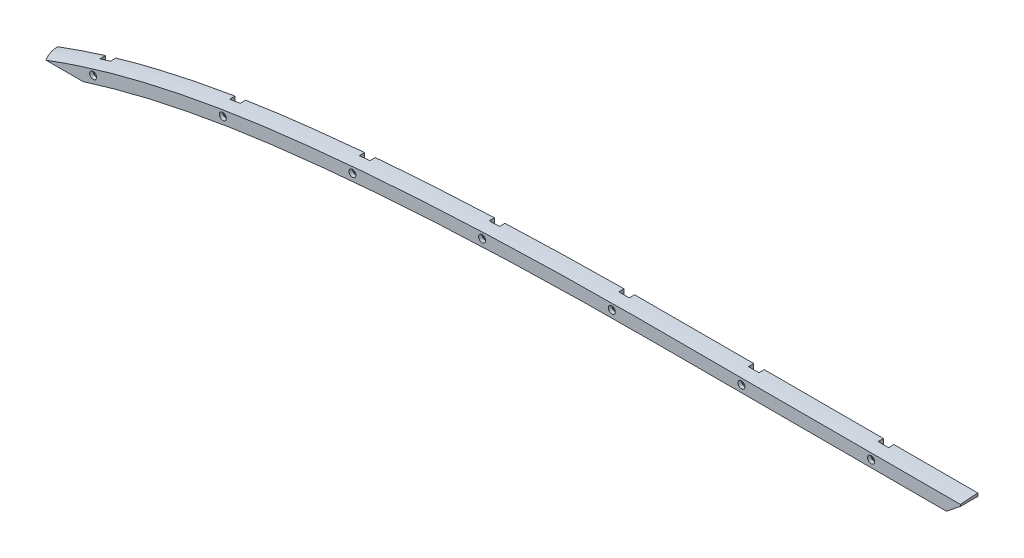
ISO-10303-21;
HEADER;
FILE_DESCRIPTION(('STEP AP214'),'2;1');
FILE_NAME('part.step','',(''),(''),'','','');
FILE_SCHEMA(('AUTOMOTIVE_DESIGN { 1 0 10303 214 1 1 1 1 }'));
ENDSEC;
DATA;
#1=APPLICATION_CONTEXT('core data for automotive mechanical design processes');
#2=APPLICATION_PROTOCOL_DEFINITION('international standard','automotive_design',2000,#1);
#3=PRODUCT_CONTEXT('',#1,'mechanical');
#4=PRODUCT('Part','Part','',(#3));
#5=PRODUCT_RELATED_PRODUCT_CATEGORY('part','',(#4));
#6=PRODUCT_DEFINITION_FORMATION('','',#4);
#7=PRODUCT_DEFINITION_CONTEXT('part definition',#1,'design');
#8=PRODUCT_DEFINITION('design','',#6,#7);
#9=PRODUCT_DEFINITION_SHAPE('','',#8);
#10=(LENGTH_UNIT() NAMED_UNIT(*) SI_UNIT(.MILLI.,.METRE.));
#11=(NAMED_UNIT(*) PLANE_ANGLE_UNIT() SI_UNIT($,.RADIAN.));
#12=(NAMED_UNIT(*) SI_UNIT($,.STERADIAN.) SOLID_ANGLE_UNIT());
#13=UNCERTAINTY_MEASURE_WITH_UNIT(LENGTH_MEASURE(1.E-05),#10,'distance_accuracy_value','');
#14=(GEOMETRIC_REPRESENTATION_CONTEXT(3) GLOBAL_UNCERTAINTY_ASSIGNED_CONTEXT((#13)) GLOBAL_UNIT_ASSIGNED_CONTEXT((#10,
#11,#12)) REPRESENTATION_CONTEXT('',''));
#15=CARTESIAN_POINT('',(0.,0.,0.));
#16=DIRECTION('',(0.,0.,1.));
#17=DIRECTION('',(1.,0.,0.));
#18=AXIS2_PLACEMENT_3D('',#15,#16,#17);
#19=CARTESIAN_POINT('',(-936.614398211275,145.943202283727,9.525));
#20=DIRECTION('',(0.,0.,-1.));
#21=DIRECTION('',(-1.,0.,0.));
#22=AXIS2_PLACEMENT_3D('',#19,#20,#21);
#23=CYLINDRICAL_SURFACE('',#22,4.7625);
#24=CARTESIAN_POINT('',(-936.614398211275,145.943202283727,9.525));
#25=DIRECTION('',(0.,0.,-1.));
#26=DIRECTION('',(-1.,0.,0.));
#27=AXIS2_PLACEMENT_3D('',#24,#25,#26);
#28=CIRCLE('',#27,4.7625);
#29=CARTESIAN_POINT('',(-941.376898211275,145.943202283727,9.525));
#30=VERTEX_POINT('',#29);
#31=EDGE_CURVE('E775',#30,#30,#28,.T.);
#32=ORIENTED_EDGE('',*,*,#31,.T.);
#33=EDGE_LOOP('',(#32));
#34=FACE_BOUND('',#33,.T.);
#35=CARTESIAN_POINT('',(-936.614398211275,145.943202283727,25.3999999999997));
#36=DIRECTION('',(0.,0.,1.));
#37=DIRECTION('',(1.,0.,0.));
#38=AXIS2_PLACEMENT_3D('',#35,#36,#37);
#39=CIRCLE('',#38,4.7625);
#40=CARTESIAN_POINT('',(-931.851898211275,145.943202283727,25.3999999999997));
#41=VERTEX_POINT('',#40);
#42=EDGE_CURVE('E718',#41,#41,#39,.F.);
#43=ORIENTED_EDGE('',*,*,#42,.F.);
#44=EDGE_LOOP('',(#43));
#45=FACE_BOUND('',#44,.T.);
#46=ADVANCED_FACE('F34',(#34,#45),#23,.F.);
#47=CARTESIAN_POINT('',(-701.664398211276,198.976840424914,9.525));
#48=DIRECTION('',(0.,0.,-1.));
#49=DIRECTION('',(-1.,0.,0.));
#50=AXIS2_PLACEMENT_3D('',#47,#48,#49);
#51=CYLINDRICAL_SURFACE('',#50,4.7625);
#52=CARTESIAN_POINT('',(-701.664398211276,198.976840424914,9.525));
#53=DIRECTION('',(0.,0.,-1.));
#54=DIRECTION('',(-1.,0.,0.));
#55=AXIS2_PLACEMENT_3D('',#52,#53,#54);
#56=CIRCLE('',#55,4.7625);
#57=CARTESIAN_POINT('',(-706.426898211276,198.976840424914,9.525));
#58=VERTEX_POINT('',#57);
#59=EDGE_CURVE('E772',#58,#58,#56,.T.);
#60=ORIENTED_EDGE('',*,*,#59,.T.);
#61=EDGE_LOOP('',(#60));
#62=FACE_BOUND('',#61,.T.);
#63=CARTESIAN_POINT('',(-701.664398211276,198.976840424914,25.3999999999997));
#64=DIRECTION('',(0.,0.,1.));
#65=DIRECTION('',(1.,0.,0.));
#66=AXIS2_PLACEMENT_3D('',#63,#64,#65);
#67=CIRCLE('',#66,4.7625);
#68=CARTESIAN_POINT('',(-696.901898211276,198.976840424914,25.3999999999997));
#69=VERTEX_POINT('',#68);
#70=EDGE_CURVE('E714',#69,#69,#67,.F.);
#71=ORIENTED_EDGE('',*,*,#70,.F.);
#72=EDGE_LOOP('',(#71));
#73=FACE_BOUND('',#72,.T.);
#74=ADVANCED_FACE('F305',(#62,#73),#51,.F.);
#75=CARTESIAN_POINT('',(-466.714398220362,227.222283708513,9.525));
#76=DIRECTION('',(0.,0.,-1.));
#77=DIRECTION('',(-1.,0.,0.));
#78=AXIS2_PLACEMENT_3D('',#75,#76,#77);
#79=CYLINDRICAL_SURFACE('',#78,4.7625);
#80=CARTESIAN_POINT('',(-466.714398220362,227.222283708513,9.525));
#81=DIRECTION('',(0.,0.,-1.));
#82=DIRECTION('',(-1.,0.,0.));
#83=AXIS2_PLACEMENT_3D('',#80,#81,#82);
#84=CIRCLE('',#83,4.7625);
#85=CARTESIAN_POINT('',(-471.476898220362,227.222283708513,9.525));
#86=VERTEX_POINT('',#85);
#87=EDGE_CURVE('E769',#86,#86,#84,.T.);
#88=ORIENTED_EDGE('',*,*,#87,.T.);
#89=EDGE_LOOP('',(#88));
#90=FACE_BOUND('',#89,.T.);
#91=CARTESIAN_POINT('',(-466.714398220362,227.222283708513,25.3999999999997));
#92=DIRECTION('',(0.,0.,1.));
#93=DIRECTION('',(1.,0.,0.));
#94=AXIS2_PLACEMENT_3D('',#91,#92,#93);
#95=CIRCLE('',#94,4.7625);
#96=CARTESIAN_POINT('',(-461.951898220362,227.222283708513,25.3999999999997));
#97=VERTEX_POINT('',#96);
#98=EDGE_CURVE('E709',#97,#97,#95,.F.);
#99=ORIENTED_EDGE('',*,*,#98,.F.);
#100=EDGE_LOOP('',(#99));
#101=FACE_BOUND('',#100,.T.);
#102=ADVANCED_FACE('F311',(#90,#101),#79,.F.);
#103=CARTESIAN_POINT('',(-231.764398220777,242.004023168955,9.525));
#104=DIRECTION('',(0.,0.,-1.));
#105=DIRECTION('',(-1.,0.,0.));
#106=AXIS2_PLACEMENT_3D('',#103,#104,#105);
#107=CYLINDRICAL_SURFACE('',#106,4.76249999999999);
#108=CARTESIAN_POINT('',(-231.764398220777,242.004023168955,9.525));
#109=DIRECTION('',(0.,0.,-1.));
#110=DIRECTION('',(-1.,0.,0.));
#111=AXIS2_PLACEMENT_3D('',#108,#109,#110);
#112=CIRCLE('',#111,4.76249999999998);
#113=CARTESIAN_POINT('',(-236.526898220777,242.004023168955,9.525));
#114=VERTEX_POINT('',#113);
#115=EDGE_CURVE('E766',#114,#114,#112,.T.);
#116=ORIENTED_EDGE('',*,*,#115,.T.);
#117=EDGE_LOOP('',(#116));
#118=FACE_BOUND('',#117,.T.);
#119=CARTESIAN_POINT('',(-231.764398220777,242.004023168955,25.3999999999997));
#120=DIRECTION('',(0.,0.,1.));
#121=DIRECTION('',(1.,0.,0.));
#122=AXIS2_PLACEMENT_3D('',#119,#120,#121);
#123=CIRCLE('',#122,4.76249999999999);
#124=CARTESIAN_POINT('',(-227.001898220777,242.004023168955,25.3999999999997));
#125=VERTEX_POINT('',#124);
#126=EDGE_CURVE('E704',#125,#125,#123,.F.);
#127=ORIENTED_EDGE('',*,*,#126,.F.);
#128=EDGE_LOOP('',(#127));
#129=FACE_BOUND('',#128,.T.);
#130=ADVANCED_FACE('F960',(#118,#129),#107,.F.);
#131=CARTESIAN_POINT('',(3.18560177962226,247.675522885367,9.525));
#132=DIRECTION('',(0.,0.,-1.));
#133=DIRECTION('',(-1.,0.,0.));
#134=AXIS2_PLACEMENT_3D('',#131,#132,#133);
#135=CYLINDRICAL_SURFACE('',#134,4.76249999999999);
#136=CARTESIAN_POINT('',(3.18560177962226,247.675522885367,9.525));
#137=DIRECTION('',(0.,0.,-1.));
#138=DIRECTION('',(-1.,0.,0.));
#139=AXIS2_PLACEMENT_3D('',#136,#137,#138);
#140=CIRCLE('',#139,4.76249999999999);
#141=CARTESIAN_POINT('',(-1.57689822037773,247.675522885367,9.525));
#142=VERTEX_POINT('',#141);
#143=EDGE_CURVE('E763',#142,#142,#140,.T.);
#144=ORIENTED_EDGE('',*,*,#143,.T.);
#145=EDGE_LOOP('',(#144));
#146=FACE_BOUND('',#145,.T.);
#147=CARTESIAN_POINT('',(3.18560177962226,247.675522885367,25.3999999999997));
#148=DIRECTION('',(0.,0.,1.));
#149=DIRECTION('',(1.,0.,0.));
#150=AXIS2_PLACEMENT_3D('',#147,#148,#149);
#151=CIRCLE('',#150,4.76249999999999);
#152=CARTESIAN_POINT('',(7.94810177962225,247.675522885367,25.3999999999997));
#153=VERTEX_POINT('',#152);
#154=EDGE_CURVE('E699',#153,#153,#151,.F.);
#155=ORIENTED_EDGE('',*,*,#154,.F.);
#156=EDGE_LOOP('',(#155));
#157=FACE_BOUND('',#156,.T.);
#158=ADVANCED_FACE('F950',(#146,#157),#135,.F.);
#159=CARTESIAN_POINT('',(238.135601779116,247.771379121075,9.525));
#160=DIRECTION('',(0.,0.,-1.));
#161=DIRECTION('',(-1.,0.,0.));
#162=AXIS2_PLACEMENT_3D('',#159,#160,#161);
#163=CYLINDRICAL_SURFACE('',#162,4.76249999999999);
#164=CARTESIAN_POINT('',(238.135601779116,247.771379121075,9.525));
#165=DIRECTION('',(0.,0.,-1.));
#166=DIRECTION('',(-1.,0.,0.));
#167=AXIS2_PLACEMENT_3D('',#164,#165,#166);
#168=CIRCLE('',#167,4.76249999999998);
#169=CARTESIAN_POINT('',(233.373101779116,247.771379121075,9.525));
#170=VERTEX_POINT('',#169);
#171=EDGE_CURVE('E760',#170,#170,#168,.T.);
#172=ORIENTED_EDGE('',*,*,#171,.T.);
#173=EDGE_LOOP('',(#172));
#174=FACE_BOUND('',#173,.T.);
#175=CARTESIAN_POINT('',(238.135601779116,247.771379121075,25.3999999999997));
#176=DIRECTION('',(0.,0.,1.));
#177=DIRECTION('',(1.,0.,0.));
#178=AXIS2_PLACEMENT_3D('',#175,#176,#177);
#179=CIRCLE('',#178,4.76249999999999);
#180=CARTESIAN_POINT('',(242.898101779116,247.771379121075,25.3999999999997));
#181=VERTEX_POINT('',#180);
#182=EDGE_CURVE('E694',#181,#181,#179,.F.);
#183=ORIENTED_EDGE('',*,*,#182,.F.);
#184=EDGE_LOOP('',(#183));
#185=FACE_BOUND('',#184,.T.);
#186=ADVANCED_FACE('F944',(#174,#185),#163,.F.);
#187=CARTESIAN_POINT('',(473.085601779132,247.649995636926,9.525));
#188=DIRECTION('',(0.,0.,-1.));
#189=DIRECTION('',(-1.,0.,0.));
#190=AXIS2_PLACEMENT_3D('',#187,#188,#189);
#191=CYLINDRICAL_SURFACE('',#190,4.7625);
#192=CARTESIAN_POINT('',(473.085601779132,247.649995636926,9.525));
#193=DIRECTION('',(0.,0.,-1.));
#194=DIRECTION('',(-1.,0.,0.));
#195=AXIS2_PLACEMENT_3D('',#192,#193,#194);
#196=CIRCLE('',#195,4.7625);
#197=CARTESIAN_POINT('',(468.323101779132,247.649995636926,9.525));
#198=VERTEX_POINT('',#197);
#199=EDGE_CURVE('E692',#198,#198,#196,.T.);
#200=ORIENTED_EDGE('',*,*,#199,.T.);
#201=EDGE_LOOP('',(#200));
#202=FACE_BOUND('',#201,.T.);
#203=CARTESIAN_POINT('',(473.085601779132,247.649995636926,25.3999999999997));
#204=DIRECTION('',(0.,0.,1.));
#205=DIRECTION('',(1.,0.,0.));
#206=AXIS2_PLACEMENT_3D('',#203,#204,#205);
#207=CIRCLE('',#206,4.7625);
#208=CARTESIAN_POINT('',(477.848101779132,247.649995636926,25.3999999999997));
#209=VERTEX_POINT('',#208);
#210=EDGE_CURVE('E689',#209,#209,#207,.F.);
#211=ORIENTED_EDGE('',*,*,#210,.F.);
#212=EDGE_LOOP('',(#211));
#213=FACE_BOUND('',#212,.T.);
#214=ADVANCED_FACE('F938',(#202,#213),#191,.F.);
#215=CARTESIAN_POINT('',(-1096.30575446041,261.684051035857,-2.4980018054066E-13));
#216=DIRECTION('',(0.,0.,1.));
#217=DIRECTION('',(-1.,0.,0.));
#218=AXIS2_PLACEMENT_3D('',#215,#216,#217);
#219=PLANE('',#218);
#220=CARTESIAN_POINT('',(247.660601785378,235.046685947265,0.));
#221=CARTESIAN_POINT('',(267.409071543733,234.997295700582,0.));
#222=CARTESIAN_POINT('',(287.165272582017,234.959512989,0.));
#223=CARTESIAN_POINT('',(311.491436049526,234.949624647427,0.));
#224=CARTESIAN_POINT('',(316.053878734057,234.94993280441,0.));
#225=CARTESIAN_POINT('',(325.164668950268,234.950151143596,0.));
#226=CARTESIAN_POINT('',(329.721124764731,234.950002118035,0.));
#227=CARTESIAN_POINT('',(343.391103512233,234.949964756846,0.));
#228=CARTESIAN_POINT('',(352.503454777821,234.949998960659,0.));
#229=CARTESIAN_POINT('',(379.841791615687,234.950002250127,0.));
#230=CARTESIAN_POINT('',(398.067399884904,234.950000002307,0.));
#231=CARTESIAN_POINT('',(432.048857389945,234.949999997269,0.));
#232=CARTESIAN_POINT('',(447.804729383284,234.949999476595,0.));
#233=CARTESIAN_POINT('',(463.560601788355,234.949999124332,0.));
#234=B_SPLINE_CURVE_WITH_KNOTS('',3,(#220,#221,#222,#223,#224,#225,#226,#227,#228,#229,#230,
#231,#232,#233),.UNSPECIFIED.,.F.,.F.,(4,2,2,2,2,2,4),(0.0979846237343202,0.131828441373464,
0.139640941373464,0.147453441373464,0.163078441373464,0.194328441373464,0.221343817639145),.UNSPECIFIED.);
#235=CARTESIAN_POINT('',(463.560601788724,234.950074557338,0.));
#236=VERTEX_POINT('',#235);
#237=CARTESIAN_POINT('',(247.660601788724,235.046776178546,0.));
#238=VERTEX_POINT('',#237);
#239=EDGE_CURVE('E670',#236,#238,#234,.F.);
#240=ORIENTED_EDGE('',*,*,#239,.T.);
#241=DIRECTION('',(0.,1.,0.));
#242=VECTOR('',#241,1.);
#243=CARTESIAN_POINT('',(247.660601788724,304.457522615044,0.));
#244=LINE('',#243,#242);
#245=CARTESIAN_POINT('',(247.660601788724,260.446773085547,0.));
#246=VERTEX_POINT('',#245);
#247=EDGE_CURVE('E347',#238,#246,#244,.T.);
#248=ORIENTED_EDGE('',*,*,#247,.T.);
#249=CARTESIAN_POINT('',(1492.25,0.793750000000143,4.66136534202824E-13));
#250=CARTESIAN_POINT('',(1492.21582639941,2.14485212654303,4.61415004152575E-13));
#251=CARTESIAN_POINT('',(1492.15078911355,4.71619414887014,4.52429252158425E-13));
#252=CARTESIAN_POINT('',(1491.8134288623,8.75174252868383,4.38297905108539E-13));
#253=CARTESIAN_POINT('',(1491.27507361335,12.925469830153,4.2365949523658E-13));
#254=CARTESIAN_POINT('',(1490.40677768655,17.6656455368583,4.07002937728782E-13));
#255=CARTESIAN_POINT('',(1489.19784787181,22.6439822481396,3.89473131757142E-13));
#256=CARTESIAN_POINT('',(1487.61805663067,27.7630904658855,3.71406409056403E-13));
#257=CARTESIAN_POINT('',(1485.7000462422,32.8827389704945,3.53296381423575E-13));
#258=CARTESIAN_POINT('',(1483.25058427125,38.3646195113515,3.3385654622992E-13));
#259=CARTESIAN_POINT('',(1480.22025005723,44.0192595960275,3.13742390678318E-13));
#260=CARTESIAN_POINT('',(1476.79485787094,49.3799018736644,2.94606343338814E-13));
#261=CARTESIAN_POINT('',(1467.46570449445,61.9168794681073,2.49691291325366E-13));
#262=CARTESIAN_POINT('',(1440.70498590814,83.8406115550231,1.69867899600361E-13));
#263=CARTESIAN_POINT('',(1399.04342763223,114.177065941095,0.));
#264=CARTESIAN_POINT('',(1347.14684056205,141.77560733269,0.));
#265=CARTESIAN_POINT('',(1296.02361845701,164.408518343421,-1.29151052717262E-13));
#266=CARTESIAN_POINT('',(1245.06850637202,183.48584456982,-2.01999138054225E-13));
#267=CARTESIAN_POINT('',(1177.60031716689,204.661680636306,-2.84196329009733E-13));
#268=CARTESIAN_POINT('',(1092.92614512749,224.836541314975,-3.65005690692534E-13));
#269=CARTESIAN_POINT('',(991.026676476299,241.848338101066,-4.36880700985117E-13));
#270=CARTESIAN_POINT('',(889.176798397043,252.160122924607,-4.85356685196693E-13));
#271=CARTESIAN_POINT('',(770.569527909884,259.168263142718,-5.24350183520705E-13));
#272=CARTESIAN_POINT('',(682.336944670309,260.370064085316,-5.39351264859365E-13));
#273=CARTESIAN_POINT('',(622.15321345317,260.348501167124,-5.46646116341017E-13));
#274=CARTESIAN_POINT('',(606.614810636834,260.350515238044,-5.48555991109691E-13));
#275=CARTESIAN_POINT('',(590.183466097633,260.349905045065,-5.50566053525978E-13));
#276=CARTESIAN_POINT('',(574.264917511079,260.350027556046,-5.52515876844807E-13));
#277=CARTESIAN_POINT('',(559.630951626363,260.349992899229,-5.54307840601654E-13));
#278=CARTESIAN_POINT('',(542.301096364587,260.350002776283,-5.56430100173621E-13));
#279=CARTESIAN_POINT('',(525.486068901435,260.349999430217,-5.5848926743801E-13));
#280=CARTESIAN_POINT('',(508.543111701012,260.350000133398,-5.6056411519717E-13));
#281=CARTESIAN_POINT('',(494.937919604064,260.349999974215,-5.62230215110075E-13));
#282=CARTESIAN_POINT('',(481.71664822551,260.350000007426,-5.63849300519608E-13));
#283=CARTESIAN_POINT('',(468.238709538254,260.34999999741,-5.65499817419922E-13));
#284=CARTESIAN_POINT('',(454.760576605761,260.35000000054,-5.67150358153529E-13));
#285=CARTESIAN_POINT('',(441.539809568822,260.349999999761,-5.68769381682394E-13));
#286=CARTESIAN_POINT('',(428.575328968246,260.350000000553,-5.70357020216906E-13));
#287=CARTESIAN_POINT('',(415.226602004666,260.349999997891,-5.71991713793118E-13));
#288=CARTESIAN_POINT('',(401.235508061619,260.350000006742,-5.73705072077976E-13));
#289=CARTESIAN_POINT('',(389.428230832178,260.349999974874,-5.75150998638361E-13));
#290=CARTESIAN_POINT('',(378.51565674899,260.35000005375,-5.76487359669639E-13));
#291=CARTESIAN_POINT('',(369.786879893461,260.349999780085,-5.77556290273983E-13));
#292=CARTESIAN_POINT('',(360.031805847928,260.350000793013,-5.78750906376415E-13));
#293=CARTESIAN_POINT('',(350.661466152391,260.349996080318,-5.79898387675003E-13));
#294=CARTESIAN_POINT('',(341.037066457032,260.350010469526,-5.81077048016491E-13));
#295=CARTESIAN_POINT('',(330.898025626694,260.349950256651,-5.82318471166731E-13));
#296=CARTESIAN_POINT('',(321.399734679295,260.35022414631,-5.83482594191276E-13));
#297=CARTESIAN_POINT('',(210.628623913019,260.34248487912,-5.9702067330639E-13));
#298=CARTESIAN_POINT('',(53.4082296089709,261.683051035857,-6.2095454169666E-13));
#299=CARTESIAN_POINT('',(-152.454222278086,258.183281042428,-6.33945213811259E-13));
#300=CARTESIAN_POINT('',(-304.904766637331,251.81740766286,-6.30388089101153E-13));
#301=CARTESIAN_POINT('',(-440.424590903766,242.866951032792,-6.15733598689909E-13));
#302=CARTESIAN_POINT('',(-558.943042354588,231.266699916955,-5.89745406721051E-13));
#303=CARTESIAN_POINT('',(-660.714412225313,218.924196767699,-5.59114798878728E-13));
#304=CARTESIAN_POINT('',(-762.460038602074,201.879033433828,-5.12061797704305E-13));
#305=CARTESIAN_POINT('',(-864.37341299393,180.000996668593,-4.48155461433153E-13));
#306=CARTESIAN_POINT('',(-966.359094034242,151.355333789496,-3.60628953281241E-13));
#307=CARTESIAN_POINT('',(-1050.69033612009,120.907966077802,-2.64649856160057E-13));
#308=CARTESIAN_POINT('',(-1118.18156361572,92.5477985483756,-1.7389593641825E-13));
#309=CARTESIAN_POINT('',(-1151.54570991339,76.1178043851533,-1.20616746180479E-13));
#310=CARTESIAN_POINT('',(-1168.4,67.8180000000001,0.));
#311=B_SPLINE_CURVE_WITH_KNOTS('',3,(#249,#250,#251,#252,#253,#254,#255,#256,#257,#258,#259,
#260,#261,#262,#263,#264,#265,#266,#267,#268,#269,#270,#271,#272,#273,#274,#275,#276,#277,#278,
#279,#280,#281,#282,#283,#284,#285,#286,#287,#288,#289,#290,#291,#292,#293,#294,#295,#296,#297,
#298,#299,#300,#301,#302,#303,#304,#305,#306,#307,#308,#309,#310),.UNSPECIFIED.,.F.,.F.,(4,1,1,
1,1,1,1,1,1,1,1,1,1,1,1,1,1,1,1,1,1,1,1,1,1,1,1,1,1,1,1,1,1,1,1,1,1,1,1,1,1,1,1,1,1,1,1,1,1,1,1,
1,1,1,1,1,1,1,1,4),(0.,0.00146410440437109,0.00278640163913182,0.00438570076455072,
0.00602205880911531,0.00800541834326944,0.00993284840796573,0.0118232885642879,
0.0139257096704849,0.0164340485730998,0.0187666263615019,0.0208135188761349,0.033341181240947,
0.0558426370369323,0.0767378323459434,0.0968197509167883,0.116414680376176,0.135650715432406,
0.173408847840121,0.210614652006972,0.247510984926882,0.284271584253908,0.339322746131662,
0.343083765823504,0.349481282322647,0.356158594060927,0.360887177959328,0.36672906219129,
0.372014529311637,0.379664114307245,0.384948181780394,0.390372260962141,0.394405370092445,
0.399273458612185,0.404975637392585,0.409008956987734,0.413598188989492,0.419022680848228,
0.423472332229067,0.428757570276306,0.431815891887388,0.435296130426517,0.43821521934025,
0.442385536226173,0.445448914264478,0.448643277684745,0.453371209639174,0.455740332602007,
0.568664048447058,0.623715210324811,0.678804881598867,0.733975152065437,0.770843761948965,
0.807823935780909,0.84502973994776,0.882582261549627,0.92071299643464,0.959712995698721,
0.979648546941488,1.),.UNSPECIFIED.);
#312=CARTESIAN_POINT('',(463.560601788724,260.349999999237,0.));
#313=VERTEX_POINT('',#312);
#314=EDGE_CURVE('E791',#313,#246,#311,.T.);
#315=ORIENTED_EDGE('',*,*,#314,.F.);
#316=DIRECTION('',(0.,-1.,0.));
#317=VECTOR('',#316,1.);
#318=CARTESIAN_POINT('',(463.560601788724,304.457522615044,0.));
#319=LINE('',#318,#317);
#320=EDGE_CURVE('E777',#313,#236,#319,.T.);
#321=ORIENTED_EDGE('',*,*,#320,.T.);
#322=EDGE_LOOP('',(#240,#248,#315,#321));
#323=FACE_BOUND('',#322,.T.);
#324=ADVANCED_FACE('F303',(#323),#219,.F.);
#325=CARTESIAN_POINT('',(12.7106017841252,235.049950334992,0.));
#326=CARTESIAN_POINT('',(37.8801485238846,235.233549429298,0.));
#327=CARTESIAN_POINT('',(63.0611891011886,235.319587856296,0.));
#328=CARTESIAN_POINT('',(124.648406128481,235.380281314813,0.));
#329=CARTESIAN_POINT('',(171.42363088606,235.263799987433,0.));
#330=CARTESIAN_POINT('',(218.242624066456,235.126204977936,0.));
#331=CARTESIAN_POINT('',(228.610601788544,235.097333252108,0.));
#332=B_SPLINE_CURVE_WITH_KNOTS('',3,(#325,#326,#327,#328,#329,#330,#331),.UNSPECIFIED.,.F.,.F.,
(4,2,1,4),(0.232227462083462,0.27549748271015,0.33799748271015,0.35577002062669),.UNSPECIFIED.);
#333=CARTESIAN_POINT('',(228.610601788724,235.097354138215,0.));
#334=VERTEX_POINT('',#333);
#335=CARTESIAN_POINT('',(12.7106017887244,235.049919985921,0.));
#336=VERTEX_POINT('',#335);
#337=EDGE_CURVE('E595',#334,#336,#332,.F.);
#338=ORIENTED_EDGE('',*,*,#337,.T.);
#339=DIRECTION('',(0.,1.,0.));
#340=VECTOR('',#339,1.);
#341=CARTESIAN_POINT('',(12.7106017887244,304.457522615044,0.));
#342=LINE('',#341,#340);
#343=CARTESIAN_POINT('',(12.7106017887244,260.451053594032,0.));
#344=VERTEX_POINT('',#343);
#345=EDGE_CURVE('E399',#336,#344,#342,.T.);
#346=ORIENTED_EDGE('',*,*,#345,.T.);
#347=CARTESIAN_POINT('',(228.610601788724,260.497436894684,0.));
#348=VERTEX_POINT('',#347);
#349=EDGE_CURVE('E794',#348,#344,#311,.T.);
#350=ORIENTED_EDGE('',*,*,#349,.F.);
#351=DIRECTION('',(0.,-1.,0.));
#352=VECTOR('',#351,1.);
#353=CARTESIAN_POINT('',(228.610601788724,304.457522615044,0.));
#354=LINE('',#353,#352);
#355=EDGE_CURVE('E343',#348,#334,#354,.T.);
#356=ORIENTED_EDGE('',*,*,#355,.T.);
#357=EDGE_LOOP('',(#338,#346,#350,#356));
#358=FACE_BOUND('',#357,.T.);
#359=ADVANCED_FACE('F937',(#358),#219,.F.);
#360=CARTESIAN_POINT('',(-222.239398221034,229.688815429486,0.));
#361=CARTESIAN_POINT('',(-209.570588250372,230.206077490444,0.));
#362=CARTESIAN_POINT('',(-196.900414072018,230.684486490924,0.));
#363=CARTESIAN_POINT('',(-166.088934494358,231.752766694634,0.));
#364=CARTESIAN_POINT('',(-147.947851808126,232.300633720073,0.));
#365=CARTESIAN_POINT('',(-93.5034907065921,233.710158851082,0.));
#366=CARTESIAN_POINT('',(-57.1815201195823,234.343350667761,0.));
#367=CARTESIAN_POINT('',(-16.0069968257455,234.797475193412,0.));
#368=CARTESIAN_POINT('',(-11.1733979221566,234.846585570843,0.));
#369=CARTESIAN_POINT('',(-6.33939821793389,234.891757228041,0.));
#370=B_SPLINE_CURVE_WITH_KNOTS('',3,(#360,#361,#362,#363,#364,#365,#366,#367,#368,#369),
.UNSPECIFIED.,.F.,.F.,(4,2,2,2,4),(0.366687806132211,0.388516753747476,0.419766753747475,
0.482266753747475,0.490578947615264),.UNSPECIFIED.);
#371=CARTESIAN_POINT('',(-6.3393982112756,234.891740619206,0.));
#372=VERTEX_POINT('',#371);
#373=CARTESIAN_POINT('',(-222.239398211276,229.688859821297,0.));
#374=VERTEX_POINT('',#373);
#375=EDGE_CURVE('E638',#372,#374,#370,.F.);
#376=ORIENTED_EDGE('',*,*,#375,.T.);
#377=DIRECTION('',(0.,1.,0.));
#378=VECTOR('',#377,1.);
#379=CARTESIAN_POINT('',(-222.239398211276,304.457522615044,0.));
#380=LINE('',#379,#378);
#381=CARTESIAN_POINT('',(-222.239398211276,255.109891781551,0.));
#382=VERTEX_POINT('',#381);
#383=EDGE_CURVE('E410',#374,#382,#380,.T.);
#384=ORIENTED_EDGE('',*,*,#383,.T.);
#385=CARTESIAN_POINT('',(-6.3393982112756,260.293045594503,0.));
#386=VERTEX_POINT('',#385);
#387=EDGE_CURVE('E1424',#386,#382,#311,.T.);
#388=ORIENTED_EDGE('',*,*,#387,.F.);
#389=DIRECTION('',(0.,-1.,0.));
#390=VECTOR('',#389,1.);
#391=CARTESIAN_POINT('',(-6.3393982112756,304.457522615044,0.));
#392=LINE('',#391,#390);
#393=EDGE_CURVE('E925',#386,#372,#392,.T.);
#394=ORIENTED_EDGE('',*,*,#393,.T.);
#395=EDGE_LOOP('',(#376,#384,#388,#394));
#396=FACE_BOUND('',#395,.T.);
#397=ADVANCED_FACE('F943',(#396),#219,.F.);
#398=CARTESIAN_POINT('',(-457.189405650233,215.30050281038,0.));
#399=CARTESIAN_POINT('',(-456.746213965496,215.33846042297,0.));
#400=CARTESIAN_POINT('',(-456.303017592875,215.376344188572,0.));
#401=CARTESIAN_POINT('',(-419.769372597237,218.493058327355,0.));
#402=CARTESIAN_POINT('',(-383.608522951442,221.083731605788,0.));
#403=CARTESIAN_POINT('',(-329.28712723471,224.424432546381,0.));
#404=CARTESIAN_POINT('',(-311.164755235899,225.447708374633,0.));
#405=CARTESIAN_POINT('',(-275.790452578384,227.294976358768,0.));
#406=CARTESIAN_POINT('',(-258.54127595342,228.124272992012,0.));
#407=CARTESIAN_POINT('',(-241.289398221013,228.881710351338,0.));
#408=B_SPLINE_CURVE_WITH_KNOTS('',3,(#398,#399,#400,#401,#402,#403,#404,#405,#406,#407),
.UNSPECIFIED.,.F.,.F.,(4,2,2,2,4),(0.501520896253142,0.502288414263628,0.564788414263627,
0.596038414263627,0.625767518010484),.UNSPECIFIED.);
#409=CARTESIAN_POINT('',(-241.289398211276,228.881732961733,0.));
#410=VERTEX_POINT('',#409);
#411=CARTESIAN_POINT('',(-457.189398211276,215.300415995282,0.));
#412=VERTEX_POINT('',#411);
#413=EDGE_CURVE('E822',#410,#412,#408,.F.);
#414=ORIENTED_EDGE('',*,*,#413,.T.);
#415=DIRECTION('',(0.,1.,0.));
#416=VECTOR('',#415,1.);
#417=CARTESIAN_POINT('',(-457.189398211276,304.457522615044,0.));
#418=LINE('',#417,#416);
#419=CARTESIAN_POINT('',(-457.189398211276,240.792902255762,0.));
#420=VERTEX_POINT('',#419);
#421=EDGE_CURVE('E462',#412,#420,#418,.T.);
#422=ORIENTED_EDGE('',*,*,#421,.T.);
#423=CARTESIAN_POINT('',(-241.289398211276,254.306079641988,0.));
#424=VERTEX_POINT('',#423);
#425=EDGE_CURVE('E1426',#424,#420,#311,.T.);
#426=ORIENTED_EDGE('',*,*,#425,.F.);
#427=DIRECTION('',(0.,-1.,0.));
#428=VECTOR('',#427,1.);
#429=CARTESIAN_POINT('',(-241.289398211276,304.457522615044,0.));
#430=LINE('',#429,#428);
#431=EDGE_CURVE('E406',#424,#410,#430,.T.);
#432=ORIENTED_EDGE('',*,*,#431,.T.);
#433=EDGE_LOOP('',(#414,#422,#426,#432));
#434=FACE_BOUND('',#433,.T.);
#435=ADVANCED_FACE('F1053',(#434),#219,.F.);
#436=CARTESIAN_POINT('',(-692.139361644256,187.656151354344,0.));
#437=CARTESIAN_POINT('',(-685.265131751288,188.759982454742,0.));
#438=CARTESIAN_POINT('',(-678.385889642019,189.831818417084,0.));
#439=CARTESIAN_POINT('',(-662.591857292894,192.217383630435,0.));
#440=CARTESIAN_POINT('',(-653.675771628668,193.508401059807,0.));
#441=CARTESIAN_POINT('',(-635.813680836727,195.989314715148,0.));
#442=CARTESIAN_POINT('',(-626.869023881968,197.17997628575,0.));
#443=CARTESIAN_POINT('',(-599.997936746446,200.62308845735,0.));
#444=CARTESIAN_POINT('',(-582.034383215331,202.746635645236,0.));
#445=CARTESIAN_POINT('',(-555.029880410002,205.756762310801,0.));
#446=CARTESIAN_POINT('',(-546.019266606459,206.732008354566,0.));
#447=CARTESIAN_POINT('',(-527.99864873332,208.62601742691,0.));
#448=CARTESIAN_POINT('',(-507.747904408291,210.6899782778,0.));
#449=CARTESIAN_POINT('',(-487.4866219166,212.606604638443,0.));
#450=CARTESIAN_POINT('',(-476.239398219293,213.623457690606,0.));
#451=B_SPLINE_CURVE_WITH_KNOTS('',3,(#436,#437,#438,#439,#440,#441,#442,#443,#444,#445,#446,
#447,#448,#449,#450),.UNSPECIFIED.,.F.,.F.,(4,2,2,2,2,2,1,4),(0.636766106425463,
0.648838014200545,0.664463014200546,0.680088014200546,0.711338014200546,0.726963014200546,
0.742588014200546,0.762071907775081),.UNSPECIFIED.);
#452=CARTESIAN_POINT('',(-476.239398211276,213.623457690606,0.));
#453=VERTEX_POINT('',#452);
#454=CARTESIAN_POINT('',(-692.139398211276,187.656379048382,0.));
#455=VERTEX_POINT('',#454);
#456=EDGE_CURVE('E823',#453,#455,#451,.F.);
#457=ORIENTED_EDGE('',*,*,#456,.T.);
#458=DIRECTION('',(0.,1.,0.));
#459=VECTOR('',#458,1.);
#460=CARTESIAN_POINT('',(-692.139398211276,304.457522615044,0.));
#461=LINE('',#460,#459);
#462=CARTESIAN_POINT('',(-692.139398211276,213.377814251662,0.));
#463=VERTEX_POINT('',#462);
#464=EDGE_CURVE('E473',#455,#463,#461,.T.);
#465=ORIENTED_EDGE('',*,*,#464,.T.);
#466=CARTESIAN_POINT('',(-476.239398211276,239.126408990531,0.));
#467=VERTEX_POINT('',#466);
#468=EDGE_CURVE('E800',#467,#463,#311,.T.);
#469=ORIENTED_EDGE('',*,*,#468,.F.);
#470=DIRECTION('',(0.,-1.,0.));
#471=VECTOR('',#470,1.);
#472=CARTESIAN_POINT('',(-476.239398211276,304.457522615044,0.));
#473=LINE('',#472,#471);
#474=EDGE_CURVE('E1433',#467,#453,#473,.T.);
#475=ORIENTED_EDGE('',*,*,#474,.T.);
#476=EDGE_LOOP('',(#457,#465,#469,#475));
#477=FACE_BOUND('',#476,.T.);
#478=ADVANCED_FACE('F1048',(#477),#219,.F.);
#479=CARTESIAN_POINT('',(-927.089426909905,135.53361928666,0.));
#480=CARTESIAN_POINT('',(-912.477829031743,139.864804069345,0.));
#481=CARTESIAN_POINT('',(-897.792874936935,143.976034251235,0.));
#482=CARTESIAN_POINT('',(-865.698228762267,152.46701984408,0.));
#483=CARTESIAN_POINT('',(-848.266963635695,156.763334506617,0.));
#484=CARTESIAN_POINT('',(-813.241702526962,164.830737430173,0.));
#485=CARTESIAN_POINT('',(-795.649618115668,168.603682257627,0.));
#486=CARTESIAN_POINT('',(-769.164554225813,173.927395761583,0.));
#487=CARTESIAN_POINT('',(-760.318723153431,175.64645881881,0.));
#488=CARTESIAN_POINT('',(-742.605097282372,178.979863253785,0.));
#489=CARTESIAN_POINT('',(-729.187809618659,181.421390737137,0.));
#490=CARTESIAN_POINT('',(-715.749433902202,183.740631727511,0.));
#491=CARTESIAN_POINT('',(-711.189342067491,184.513136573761,0.));
#492=B_SPLINE_CURVE_WITH_KNOTS('',3,(#479,#480,#481,#482,#483,#484,#485,#486,#487,#488,#489,
#490,#491),.UNSPECIFIED.,.F.,.F.,(4,2,2,2,2,1,4),(0.773230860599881,0.799798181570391,
0.831048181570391,0.862298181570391,0.877923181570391,0.893548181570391,0.90156732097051),.UNSPECIFIED.);
#493=CARTESIAN_POINT('',(-711.189398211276,184.513467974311,0.));
#494=VERTEX_POINT('',#493);
#495=CARTESIAN_POINT('',(-927.089398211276,135.533522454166,0.));
#496=VERTEX_POINT('',#495);
#497=EDGE_CURVE('E826',#494,#496,#492,.F.);
#498=ORIENTED_EDGE('',*,*,#497,.T.);
#499=DIRECTION('',(0.,1.,0.));
#500=VECTOR('',#499,1.);
#501=CARTESIAN_POINT('',(-927.089398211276,304.457522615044,0.));
#502=LINE('',#501,#500);
#503=CARTESIAN_POINT('',(-927.089398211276,162.006780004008,0.));
#504=VERTEX_POINT('',#503);
#505=EDGE_CURVE('E525',#496,#504,#502,.T.);
#506=ORIENTED_EDGE('',*,*,#505,.T.);
#507=CARTESIAN_POINT('',(-711.189398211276,210.270885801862,0.));
#508=VERTEX_POINT('',#507);
#509=EDGE_CURVE('E796',#508,#504,#311,.T.);
#510=ORIENTED_EDGE('',*,*,#509,.F.);
#511=DIRECTION('',(0.,-1.,0.));
#512=VECTOR('',#511,1.);
#513=CARTESIAN_POINT('',(-711.189398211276,304.457522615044,0.));
#514=LINE('',#513,#512);
#515=EDGE_CURVE('E469',#508,#494,#514,.T.);
#516=ORIENTED_EDGE('',*,*,#515,.T.);
#517=EDGE_LOOP('',(#498,#506,#510,#516));
#518=FACE_BOUND('',#517,.T.);
#519=ADVANCED_FACE('F1046',(#518),#219,.F.);
#520=CARTESIAN_POINT('',(-954.876996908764,127.000000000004,0.));
#521=CARTESIAN_POINT('',(-951.967551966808,127.925139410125,0.));
#522=CARTESIAN_POINT('',(-949.055025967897,128.841141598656,0.));
#523=CARTESIAN_POINT('',(-946.139404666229,129.748115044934,0.));
#524=B_SPLINE_CURVE_WITH_KNOTS('',3,(#520,#521,#522,#523),.UNSPECIFIED.,.F.,.F.,(4,4),
(0.913139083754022,0.918464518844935),.UNSPECIFIED.);
#525=CARTESIAN_POINT('',(-946.139398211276,129.748094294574,0.));
#526=VERTEX_POINT('',#525);
#527=CARTESIAN_POINT('',(-954.876996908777,127.,0.));
#528=VERTEX_POINT('',#527);
#529=EDGE_CURVE('E532',#526,#528,#524,.F.);
#530=ORIENTED_EDGE('',*,*,#529,.T.);
#531=DIRECTION('',(-1.,0.,0.));
#532=VECTOR('',#531,1.);
#533=CARTESIAN_POINT('',(-954.876996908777,127.,0.));
#534=LINE('',#533,#532);
#535=CARTESIAN_POINT('',(-1032.62639821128,127.000000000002,-2.83707945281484E-13));
#536=VERTEX_POINT('',#535);
#537=EDGE_CURVE('E552',#528,#536,#534,.T.);
#538=ORIENTED_EDGE('',*,*,#537,.T.);
#539=CARTESIAN_POINT('',(-946.139398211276,156.326867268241,0.));
#540=VERTEX_POINT('',#539);
#541=EDGE_CURVE('E792',#540,#536,#311,.T.);
#542=ORIENTED_EDGE('',*,*,#541,.F.);
#543=DIRECTION('',(0.,-1.,0.));
#544=VECTOR('',#543,1.);
#545=CARTESIAN_POINT('',(-946.139398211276,304.457522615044,0.));
#546=LINE('',#545,#544);
#547=EDGE_CURVE('E833',#540,#526,#546,.T.);
#548=ORIENTED_EDGE('',*,*,#547,.T.);
#549=EDGE_LOOP('',(#530,#538,#542,#548));
#550=FACE_BOUND('',#549,.T.);
#551=ADVANCED_FACE('F297',(#550),#219,.F.);
#552=CARTESIAN_POINT('',(634.999999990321,261.684051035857,31.7499999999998));
#553=DIRECTION('',(0.,0.,-1.));
#554=DIRECTION('',(1.,0.,0.));
#555=AXIS2_PLACEMENT_3D('',#552,#553,#554);
#556=PLANE('',#555);
#557=CARTESIAN_POINT('',(-936.614398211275,145.943202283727,31.7499999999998));
#558=DIRECTION('',(0.,0.,1.));
#559=DIRECTION('',(1.,0.,0.));
#560=AXIS2_PLACEMENT_3D('',#557,#558,#559);
#561=CIRCLE('',#560,6.34999999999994);
#562=CARTESIAN_POINT('',(-930.264398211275,145.943202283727,31.7499999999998));
#563=VERTEX_POINT('',#562);
#564=EDGE_CURVE('E727',#563,#563,#561,.T.);
#565=ORIENTED_EDGE('',*,*,#564,.F.);
#566=EDGE_LOOP('',(#565));
#567=FACE_BOUND('',#566,.T.);
#568=CARTESIAN_POINT('',(-701.664398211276,198.976840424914,31.7499999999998));
#569=DIRECTION('',(0.,0.,1.));
#570=DIRECTION('',(1.,0.,0.));
#571=AXIS2_PLACEMENT_3D('',#568,#569,#570);
#572=CIRCLE('',#571,6.34999999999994);
#573=CARTESIAN_POINT('',(-695.314398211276,198.976840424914,31.7499999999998));
#574=VERTEX_POINT('',#573);
#575=EDGE_CURVE('E720',#574,#574,#572,.T.);
#576=ORIENTED_EDGE('',*,*,#575,.F.);
#577=EDGE_LOOP('',(#576));
#578=FACE_BOUND('',#577,.T.);
#579=CARTESIAN_POINT('',(-466.714398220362,227.222283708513,31.7499999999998));
#580=DIRECTION('',(0.,0.,1.));
#581=DIRECTION('',(1.,0.,0.));
#582=AXIS2_PLACEMENT_3D('',#579,#580,#581);
#583=CIRCLE('',#582,6.34999999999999);
#584=CARTESIAN_POINT('',(-460.364398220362,227.222283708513,31.7499999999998));
#585=VERTEX_POINT('',#584);
#586=EDGE_CURVE('E716',#585,#585,#583,.T.);
#587=ORIENTED_EDGE('',*,*,#586,.F.);
#588=EDGE_LOOP('',(#587));
#589=FACE_BOUND('',#588,.T.);
#590=CARTESIAN_POINT('',(-231.764398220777,242.004023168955,31.7499999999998));
#591=DIRECTION('',(0.,0.,1.));
#592=DIRECTION('',(1.,0.,0.));
#593=AXIS2_PLACEMENT_3D('',#590,#591,#592);
#594=CIRCLE('',#593,6.34999999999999);
#595=CARTESIAN_POINT('',(-225.414398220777,242.004023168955,31.7499999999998));
#596=VERTEX_POINT('',#595);
#597=EDGE_CURVE('E712',#596,#596,#594,.T.);
#598=ORIENTED_EDGE('',*,*,#597,.F.);
#599=EDGE_LOOP('',(#598));
#600=FACE_BOUND('',#599,.T.);
#601=CARTESIAN_POINT('',(3.18560177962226,247.675522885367,31.7499999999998));
#602=DIRECTION('',(0.,0.,1.));
#603=DIRECTION('',(1.,0.,0.));
#604=AXIS2_PLACEMENT_3D('',#601,#602,#603);
#605=CIRCLE('',#604,6.35);
#606=CARTESIAN_POINT('',(9.53560177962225,247.675522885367,31.7499999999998));
#607=VERTEX_POINT('',#606);
#608=EDGE_CURVE('E707',#607,#607,#605,.T.);
#609=ORIENTED_EDGE('',*,*,#608,.F.);
#610=EDGE_LOOP('',(#609));
#611=FACE_BOUND('',#610,.T.);
#612=CARTESIAN_POINT('',(238.135601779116,247.771379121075,31.7499999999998));
#613=DIRECTION('',(0.,0.,1.));
#614=DIRECTION('',(1.,0.,0.));
#615=AXIS2_PLACEMENT_3D('',#612,#613,#614);
#616=CIRCLE('',#615,6.34999999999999);
#617=CARTESIAN_POINT('',(244.485601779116,247.771379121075,31.7499999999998));
#618=VERTEX_POINT('',#617);
#619=EDGE_CURVE('E702',#618,#618,#616,.T.);
#620=ORIENTED_EDGE('',*,*,#619,.F.);
#621=EDGE_LOOP('',(#620));
#622=FACE_BOUND('',#621,.T.);
#623=CARTESIAN_POINT('',(473.085601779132,247.649995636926,31.7499999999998));
#624=DIRECTION('',(0.,0.,1.));
#625=DIRECTION('',(1.,0.,0.));
#626=AXIS2_PLACEMENT_3D('',#623,#624,#625);
#627=CIRCLE('',#626,6.34999999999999);
#628=CARTESIAN_POINT('',(479.435601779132,247.649995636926,31.7499999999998));
#629=VERTEX_POINT('',#628);
#630=EDGE_CURVE('E697',#629,#629,#627,.T.);
#631=ORIENTED_EDGE('',*,*,#630,.F.);
#632=EDGE_LOOP('',(#631));
#633=FACE_BOUND('',#632,.T.);
#634=CARTESIAN_POINT('',(634.98638759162,234.950003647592,31.7499999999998));
#635=CARTESIAN_POINT('',(632.718101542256,234.951219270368,31.7499999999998));
#636=CARTESIAN_POINT('',(630.445923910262,234.951104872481,31.7499999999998));
#637=CARTESIAN_POINT('',(625.893740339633,234.950308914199,31.7499999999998));
#638=CARTESIAN_POINT('',(623.612532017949,234.94976876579,31.7499999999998));
#639=CARTESIAN_POINT('',(616.773327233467,234.949236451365,31.7499999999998));
#640=CARTESIAN_POINT('',(612.215800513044,234.949711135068,31.7499999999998));
#641=CARTESIAN_POINT('',(598.549116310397,234.950456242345,31.7499999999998));
#642=CARTESIAN_POINT('',(589.436111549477,234.949951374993,31.7499999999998));
#643=CARTESIAN_POINT('',(562.097269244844,234.950040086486,31.7499999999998));
#644=CARTESIAN_POINT('',(543.872082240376,234.950001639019,31.7499999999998));
#645=CARTESIAN_POINT('',(489.195318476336,234.949997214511,31.7499999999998));
#646=CARTESIAN_POINT('',(452.744153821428,234.9499999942,31.7499999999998));
#647=CARTESIAN_POINT('',(398.067399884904,234.950000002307,31.7499999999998));
#648=CARTESIAN_POINT('',(379.841791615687,234.950002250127,31.7499999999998));
#649=CARTESIAN_POINT('',(352.503454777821,234.949998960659,31.7499999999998));
#650=CARTESIAN_POINT('',(343.391103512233,234.949964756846,31.7499999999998));
#651=CARTESIAN_POINT('',(329.721124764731,234.950002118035,31.7499999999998));
#652=CARTESIAN_POINT('',(325.164668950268,234.950151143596,31.7499999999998));
#653=CARTESIAN_POINT('',(316.053878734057,234.94993280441,31.7499999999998));
#654=CARTESIAN_POINT('',(311.491436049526,234.949624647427,31.7499999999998));
#655=CARTESIAN_POINT('',(270.43083670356,234.966315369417,31.7499999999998));
#656=CARTESIAN_POINT('',(197.4865553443,235.198897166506,31.7499999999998));
#657=CARTESIAN_POINT('',(124.648406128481,235.380281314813,31.7499999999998));
#658=CARTESIAN_POINT('',(51.8640568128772,235.308553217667,31.7499999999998));
#659=CARTESIAN_POINT('',(15.5010947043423,235.144986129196,31.7499999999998));
#660=CARTESIAN_POINT('',(-57.1815201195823,234.343350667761,31.7499999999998));
#661=CARTESIAN_POINT('',(-93.5034907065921,233.710158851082,31.7499999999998));
#662=CARTESIAN_POINT('',(-147.947851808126,232.300633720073,31.7499999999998));
#663=CARTESIAN_POINT('',(-166.088934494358,231.752766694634,31.7499999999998));
#664=CARTESIAN_POINT('',(-202.369184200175,230.494876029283,31.7499999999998));
#665=CARTESIAN_POINT('',(-238.644594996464,229.076825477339,31.7499999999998));
#666=CARTESIAN_POINT('',(-274.90817256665,227.341049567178,31.7499999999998));
#667=CARTESIAN_POINT('',(-311.164755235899,225.447708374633,31.7499999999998));
#668=CARTESIAN_POINT('',(-329.28712723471,224.424432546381,31.7499999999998));
#669=CARTESIAN_POINT('',(-383.608522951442,221.083731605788,31.7499999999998));
#670=CARTESIAN_POINT('',(-419.769372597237,218.493058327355,31.7499999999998));
#671=CARTESIAN_POINT('',(-473.905038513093,213.874701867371,31.7499999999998));
#672=CARTESIAN_POINT('',(-500.96123616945,211.38167717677,31.7499999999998));
#673=CARTESIAN_POINT('',(-527.99864873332,208.62601742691,31.7499999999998));
#674=CARTESIAN_POINT('',(-546.019266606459,206.732008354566,31.7499999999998));
#675=CARTESIAN_POINT('',(-555.029880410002,205.756762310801,31.7499999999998));
#676=CARTESIAN_POINT('',(-582.034383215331,202.746635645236,31.7499999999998));
#677=CARTESIAN_POINT('',(-599.997936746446,200.62308845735,31.7499999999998));
#678=CARTESIAN_POINT('',(-626.869023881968,197.17997628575,31.7499999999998));
#679=CARTESIAN_POINT('',(-635.813680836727,195.989314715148,31.7499999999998));
#680=CARTESIAN_POINT('',(-653.675771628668,193.508401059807,31.7499999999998));
#681=CARTESIAN_POINT('',(-662.591857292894,192.217383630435,31.7499999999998));
#682=CARTESIAN_POINT('',(-689.322107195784,188.179988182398,31.7499999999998));
#683=CARTESIAN_POINT('',(-716.005044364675,183.820242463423,31.7499999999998));
#684=CARTESIAN_POINT('',(-742.605097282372,178.979863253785,31.7499999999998));
#685=CARTESIAN_POINT('',(-760.318723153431,175.64645881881,31.7499999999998));
#686=CARTESIAN_POINT('',(-769.164554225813,173.927395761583,31.7499999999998));
#687=CARTESIAN_POINT('',(-795.649618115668,168.603682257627,31.7499999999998));
#688=CARTESIAN_POINT('',(-813.241702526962,164.830737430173,31.7499999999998));
#689=CARTESIAN_POINT('',(-848.266963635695,156.763334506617,31.7499999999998));
#690=CARTESIAN_POINT('',(-865.698228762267,152.46701984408,31.7499999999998));
#691=CARTESIAN_POINT('',(-900.392250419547,143.28834136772,31.7499999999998));
#692=CARTESIAN_POINT('',(-917.652536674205,138.40902597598,31.7499999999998));
#693=CARTESIAN_POINT('',(-943.386819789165,130.629771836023,31.7499999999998));
#694=CARTESIAN_POINT('',(-951.938109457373,127.960170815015,31.7499999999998));
#695=CARTESIAN_POINT('',(-968.987799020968,122.46245626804,31.7499999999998));
#696=CARTESIAN_POINT('',(-977.488585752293,119.633986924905,31.7499999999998));
#697=CARTESIAN_POINT('',(-1002.91629389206,110.915535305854,31.7499999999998));
#698=CARTESIAN_POINT('',(-1019.76856755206,104.792504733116,31.7499999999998));
#699=CARTESIAN_POINT('',(-1040.70116224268,96.7696827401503,31.7499999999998));
#700=CARTESIAN_POINT('',(-1044.8810434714,95.1466670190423,31.7499999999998));
#701=CARTESIAN_POINT('',(-1053.22732090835,91.864218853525,31.7499999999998));
#702=CARTESIAN_POINT('',(-1057.39589880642,90.2041893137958,31.7499999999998));
#703=CARTESIAN_POINT('',(-1069.86155173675,85.1759499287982,31.7499999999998));
#704=CARTESIAN_POINT('',(-1078.11772809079,81.7576918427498,31.7499999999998));
#705=CARTESIAN_POINT('',(-1086.30695181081,78.2508255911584,31.7499999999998));
#706=B_SPLINE_CURVE_WITH_KNOTS('',3,(#634,#635,#636,#637,#638,#639,#640,#641,#642,#643,#644,
#645,#646,#647,#648,#649,#650,#651,#652,#653,#654,#655,#656,#657,#658,#659,#660,#661,#662,#663,
#664,#665,#666,#667,#668,#669,#670,#671,#672,#673,#674,#675,#676,#677,#678,#679,#680,#681,#682,
#683,#684,#685,#686,#687,#688,#689,#690,#691,#692,#693,#694,#695,#696,#697,#698,#699,#700,#701,
#702,#703,#704,#705),.UNSPECIFIED.,.F.,.F.,(4,2,2,2,2,2,2,2,2,2,2,1,2,2,2,2,1,2,2,2,1,2,2,2,2,2,
1,2,2,2,2,2,2,2,2,2,2,4),(0.,0.00390625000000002,0.00781250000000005,0.0156250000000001,
0.0312500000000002,0.0625000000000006,0.125000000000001,0.156250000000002,0.171875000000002,
0.179687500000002,0.187500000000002,0.250000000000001,0.312500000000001,0.375,0.4375,0.46875,
0.5,0.531249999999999,0.562499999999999,0.624999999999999,0.656249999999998,0.671874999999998,
0.687499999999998,0.718749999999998,0.734374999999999,0.749999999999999,0.781249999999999,
0.796874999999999,0.8125,0.84375,0.875,0.90625,0.921875,0.9375,0.96875,0.9765625,0.984375,1.),.UNSPECIFIED.);
#707=CARTESIAN_POINT('',(609.599999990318,234.949853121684,31.7499999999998));
#708=VERTEX_POINT('',#707);
#709=CARTESIAN_POINT('',(-954.876996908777,127.,31.7499999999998));
#710=VERTEX_POINT('',#709);
#711=EDGE_CURVE('E39',#708,#710,#706,.T.);
#712=ORIENTED_EDGE('',*,*,#711,.F.);
#713=DIRECTION('',(0.780866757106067,0.62469761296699,0.));
#714=VECTOR('',#713,1.);
#715=CARTESIAN_POINT('',(638.128809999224,257.773064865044,31.7499999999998));
#716=LINE('',#715,#714);
#717=CARTESIAN_POINT('',(634.99999999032,255.270000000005,31.7499999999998));
#718=VERTEX_POINT('',#717);
#719=EDGE_CURVE('E53',#708,#718,#716,.T.);
#720=ORIENTED_EDGE('',*,*,#719,.T.);
#721=DIRECTION('',(0.,-1.,0.));
#722=VECTOR('',#721,1.);
#723=CARTESIAN_POINT('',(634.999999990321,261.684051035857,31.7499999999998));
#724=LINE('',#723,#722);
#725=CARTESIAN_POINT('',(634.999999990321,258.406772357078,31.7499999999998));
#726=VERTEX_POINT('',#725);
#727=EDGE_CURVE('E267',#726,#718,#724,.T.);
#728=ORIENTED_EDGE('',*,*,#727,.F.);
#729=CARTESIAN_POINT('',(-1096.30575446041,96.5116443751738,31.7499999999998));
#730=CARTESIAN_POINT('',(-1093.74278966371,97.6670316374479,31.7499999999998));
#731=CARTESIAN_POINT('',(-1091.17466776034,98.8109307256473,31.7499999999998));
#732=CARTESIAN_POINT('',(-1086.02916917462,101.077529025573,31.7499999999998));
#733=CARTESIAN_POINT('',(-1083.45179275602,102.200228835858,31.7499999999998));
#734=CARTESIAN_POINT('',(-1078.28871066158,104.426265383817,31.7499999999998));
#735=CARTESIAN_POINT('',(-1075.70300502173,105.529602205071,31.7499999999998));
#736=CARTESIAN_POINT('',(-1071.81888558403,107.171379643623,31.7499999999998));
#737=CARTESIAN_POINT('',(-1070.52326117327,107.71643046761,31.7499999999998));
#738=CARTESIAN_POINT('',(-1067.93026422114,108.802358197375,31.7499999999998));
#739=CARTESIAN_POINT('',(-1066.63289167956,109.343235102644,31.7499999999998));
#740=CARTESIAN_POINT('',(-1062.73824084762,110.959818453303,31.7499999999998));
#741=CARTESIAN_POINT('',(-1060.1384465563,112.029470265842,31.7499999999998));
#742=CARTESIAN_POINT('',(-1054.93228546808,114.152669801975,31.7499999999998));
#743=CARTESIAN_POINT('',(-1052.32591865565,115.206217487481,31.7499999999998));
#744=CARTESIAN_POINT('',(-1047.10671711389,117.2973141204,31.7499999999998));
#745=CARTESIAN_POINT('',(-1044.49388226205,118.334862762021,31.7499999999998));
#746=CARTESIAN_POINT('',(-1039.26193621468,120.393981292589,31.7499999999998));
#747=CARTESIAN_POINT('',(-1036.64282504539,121.415551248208,31.7499999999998));
#748=CARTESIAN_POINT('',(-1031.39844467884,123.442744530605,31.7499999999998));
#749=CARTESIAN_POINT('',(-1028.77317548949,124.448367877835,31.7499999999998));
#750=CARTESIAN_POINT('',(-1022.21619723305,126.937290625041,31.7499999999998));
#751=CARTESIAN_POINT('',(-1018.28075173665,128.410759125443,31.7499999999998));
#752=CARTESIAN_POINT('',(-1010.39670516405,131.322081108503,31.7499999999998));
#753=CARTESIAN_POINT('',(-1006.44810406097,132.759934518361,31.7499999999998));
#754=CARTESIAN_POINT('',(-998.538130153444,135.599927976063,31.7499999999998));
#755=CARTESIAN_POINT('',(-994.576757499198,137.002068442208,31.7499999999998));
#756=CARTESIAN_POINT('',(-986.641523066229,139.770514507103,31.7499999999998));
#757=CARTESIAN_POINT('',(-982.667661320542,141.136820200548,31.7499999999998));
#758=CARTESIAN_POINT('',(-974.707930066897,143.833382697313,31.7499999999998));
#759=CARTESIAN_POINT('',(-970.722061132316,145.163641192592,31.7499999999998));
#760=CARTESIAN_POINT('',(-962.738391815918,147.787918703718,31.7499999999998));
#761=CARTESIAN_POINT('',(-958.740591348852,149.081937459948,31.7499999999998));
#762=CARTESIAN_POINT('',(-946.65599206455,152.934070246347,31.7499999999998));
#763=CARTESIAN_POINT('',(-938.551643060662,155.437322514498,31.7499999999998));
#764=CARTESIAN_POINT('',(-922.300740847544,160.30329667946,31.7499999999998));
#765=CARTESIAN_POINT('',(-914.154186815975,162.666015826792,31.7499999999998));
#766=CARTESIAN_POINT('',(-901.904422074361,166.108465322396,31.7499999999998));
#767=CARTESIAN_POINT('',(-897.815476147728,167.23919501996,31.7499999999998));
#768=CARTESIAN_POINT('',(-889.628467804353,169.467194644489,31.7499999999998));
#769=CARTESIAN_POINT('',(-885.530405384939,170.564464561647,31.7499999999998));
#770=CARTESIAN_POINT('',(-877.325648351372,172.726098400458,31.7499999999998));
#771=CARTESIAN_POINT('',(-873.218953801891,173.790462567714,31.7499999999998));
#772=CARTESIAN_POINT('',(-864.997305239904,175.886787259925,31.7499999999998));
#773=CARTESIAN_POINT('',(-860.882351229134,176.918747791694,31.7499999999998));
#774=CARTESIAN_POINT('',(-852.642194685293,178.951679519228,31.7499999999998));
#775=CARTESIAN_POINT('',(-848.516987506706,179.952631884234,31.7499999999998));
#776=CARTESIAN_POINT('',(-840.259286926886,181.923966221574,31.7499999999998));
#777=CARTESIAN_POINT('',(-836.126793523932,182.894348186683,31.7499999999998));
#778=CARTESIAN_POINT('',(-823.719053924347,185.76116160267,31.7499999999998));
#779=CARTESIAN_POINT('',(-815.433515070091,187.613268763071,31.7499999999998));
#780=CARTESIAN_POINT('',(-802.985087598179,190.309378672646,31.7499999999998));
#781=CARTESIAN_POINT('',(-798.831064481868,191.194648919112,31.7499999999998));
#782=CARTESIAN_POINT('',(-790.517445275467,192.938668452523,31.7499999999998));
#783=CARTESIAN_POINT('',(-786.357849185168,193.797417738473,31.7499999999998));
#784=CARTESIAN_POINT('',(-778.033475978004,195.489418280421,31.7499999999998));
#785=CARTESIAN_POINT('',(-773.868698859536,196.322669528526,31.7499999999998));
#786=CARTESIAN_POINT('',(-767.617920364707,197.554181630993,31.7499999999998));
#787=CARTESIAN_POINT('',(-765.533724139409,197.961625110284,31.7499999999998));
#788=CARTESIAN_POINT('',(-761.36417107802,198.770529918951,31.7499999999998));
#789=CARTESIAN_POINT('',(-759.278814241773,199.171991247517,31.7499999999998));
#790=CARTESIAN_POINT('',(-753.01990794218,200.367651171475,31.7499999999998));
#791=CARTESIAN_POINT('',(-748.844645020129,201.152904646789,31.7499999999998));
#792=CARTESIAN_POINT('',(-740.489710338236,202.699531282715,31.7499999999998));
#793=CARTESIAN_POINT('',(-736.310038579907,203.46090445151,31.7499999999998));
#794=CARTESIAN_POINT('',(-723.764609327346,205.709194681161,31.7499999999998));
#795=CARTESIAN_POINT('',(-715.392389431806,207.160291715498,31.7499999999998));
#796=CARTESIAN_POINT('',(-702.822482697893,209.265120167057,31.7499999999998));
#797=CARTESIAN_POINT('',(-698.630761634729,209.954732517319,31.7499999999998));
#798=CARTESIAN_POINT('',(-690.243446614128,211.310032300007,31.7499999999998));
#799=CARTESIAN_POINT('',(-686.047852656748,211.975719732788,31.7499999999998));
#800=CARTESIAN_POINT('',(-677.65294444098,213.283144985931,31.7499999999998));
#801=CARTESIAN_POINT('',(-673.453630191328,213.924882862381,31.7499999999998));
#802=CARTESIAN_POINT('',(-667.151971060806,214.869524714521,31.7499999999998));
#803=CARTESIAN_POINT('',(-665.050969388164,215.181411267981,31.7499999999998));
#804=CARTESIAN_POINT('',(-660.848082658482,215.799174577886,31.7499999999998));
#805=CARTESIAN_POINT('',(-658.746197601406,216.105051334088,31.7499999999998));
#806=CARTESIAN_POINT('',(-652.413063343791,217.017614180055,31.7499999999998));
#807=CARTESIAN_POINT('',(-648.180515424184,217.61530995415,31.7499999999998));
#808=CARTESIAN_POINT('',(-639.712328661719,218.788337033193,31.7499999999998));
#809=CARTESIAN_POINT('',(-635.476689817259,219.363668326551,31.7499999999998));
#810=CARTESIAN_POINT('',(-622.765576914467,221.058314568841,31.7499999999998));
#811=CARTESIAN_POINT('',(-614.285905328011,222.146282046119,31.7499999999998));
#812=CARTESIAN_POINT('',(-601.561798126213,223.724143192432,31.7499999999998));
#813=CARTESIAN_POINT('',(-597.320665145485,224.24096615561,31.7499999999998));
#814=CARTESIAN_POINT('',(-588.8364225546,225.258159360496,31.7499999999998));
#815=CARTESIAN_POINT('',(-584.593312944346,225.758529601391,31.7499999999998));
#816=CARTESIAN_POINT('',(-576.105358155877,226.744297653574,31.7499999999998));
#817=CARTESIAN_POINT('',(-571.860512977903,227.229695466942,31.7499999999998));
#818=CARTESIAN_POINT('',(-565.492104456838,227.947657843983,31.7499999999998));
#819=CARTESIAN_POINT('',(-563.369111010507,228.185289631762,31.7499999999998));
#820=CARTESIAN_POINT('',(-559.122771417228,228.657381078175,31.7499999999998));
#821=CARTESIAN_POINT('',(-556.999425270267,228.891840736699,31.7499999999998));
#822=CARTESIAN_POINT('',(-550.629939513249,229.590419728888,31.7499999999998));
#823=CARTESIAN_POINT('',(-546.383285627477,230.049859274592,31.7499999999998));
#824=CARTESIAN_POINT('',(-537.888627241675,230.956060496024,31.7499999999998));
#825=CARTESIAN_POINT('',(-533.640622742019,231.402822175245,31.7499999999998));
#826=CARTESIAN_POINT('',(-525.143291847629,232.283527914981,31.7499999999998));
#827=CARTESIAN_POINT('',(-520.893965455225,232.717471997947,31.7499999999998));
#828=CARTESIAN_POINT('',(-512.39400982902,233.572389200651,31.7499999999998));
#829=CARTESIAN_POINT('',(-508.143380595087,233.993362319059,31.7499999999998));
#830=CARTESIAN_POINT('',(-495.391056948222,235.236450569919,31.7499999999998));
#831=CARTESIAN_POINT('',(-486.887431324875,236.038889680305,31.7499999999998));
#832=CARTESIAN_POINT('',(-474.128340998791,237.202300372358,31.7499999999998));
#833=CARTESIAN_POINT('',(-469.874699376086,237.583396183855,31.7499999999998));
#834=CARTESIAN_POINT('',(-461.366217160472,238.331982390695,31.7499999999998));
#835=CARTESIAN_POINT('',(-457.111376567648,238.699472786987,31.7499999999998));
#836=CARTESIAN_POINT('',(-448.600993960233,239.420834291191,31.7499999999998));
#837=CARTESIAN_POINT('',(-444.345452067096,239.774706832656,31.7499999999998));
#838=CARTESIAN_POINT('',(-435.83330001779,240.469346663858,31.7499999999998));
#839=CARTESIAN_POINT('',(-431.576689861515,240.810113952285,31.7499999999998));
#840=CARTESIAN_POINT('',(-418.805364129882,241.813355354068,31.7499999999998));
#841=CARTESIAN_POINT('',(-410.289144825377,242.456769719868,31.7499999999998));
#842=CARTESIAN_POINT('',(-393.253904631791,243.696040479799,31.7499999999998));
#843=CARTESIAN_POINT('',(-384.734884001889,244.291900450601,31.7499999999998));
#844=CARTESIAN_POINT('',(-367.693859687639,245.439420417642,31.7499999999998));
#845=CARTESIAN_POINT('',(-359.171856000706,245.991080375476,31.7499999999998));
#846=CARTESIAN_POINT('',(-346.156444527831,246.802262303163,31.7499999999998));
#847=CARTESIAN_POINT('',(-341.663950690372,247.076553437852,31.7499999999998));
#848=CARTESIAN_POINT('',(-332.678311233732,247.614262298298,31.7499999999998));
#849=CARTESIAN_POINT('',(-328.185165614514,247.877680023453,31.7499999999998));
#850=CARTESIAN_POINT('',(-319.198265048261,248.394111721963,31.7499999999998));
#851=CARTESIAN_POINT('',(-314.704510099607,248.647125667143,31.7499999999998));
#852=CARTESIAN_POINT('',(-305.716455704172,249.143286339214,31.7499999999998));
#853=CARTESIAN_POINT('',(-301.222156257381,249.386433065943,31.7499999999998));
#854=CARTESIAN_POINT('',(-292.233036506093,249.863033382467,31.7499999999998));
#855=CARTESIAN_POINT('',(-287.738216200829,250.096486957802,31.7499999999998));
#856=CARTESIAN_POINT('',(-278.748080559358,250.553638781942,31.7499999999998));
#857=CARTESIAN_POINT('',(-274.252765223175,250.777337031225,31.7499999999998));
#858=CARTESIAN_POINT('',(-260.765870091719,251.433797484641,31.7499999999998));
#859=CARTESIAN_POINT('',(-251.773572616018,251.851913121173,31.7499999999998));
#860=CARTESIAN_POINT('',(-233.787263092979,252.648924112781,31.7499999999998));
#861=CARTESIAN_POINT('',(-224.793251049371,253.027819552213,31.7499999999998));
#862=CARTESIAN_POINT('',(-206.803661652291,253.746240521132,31.7499999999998));
#863=CARTESIAN_POINT('',(-197.80808430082,254.085766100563,31.7499999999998));
#864=CARTESIAN_POINT('',(-184.313275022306,254.565422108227,31.7499999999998));
#865=CARTESIAN_POINT('',(-179.814565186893,254.720374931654,31.7499999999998));
#866=CARTESIAN_POINT('',(-170.816814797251,255.020382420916,31.7499999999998));
#867=CARTESIAN_POINT('',(-166.317774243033,255.165437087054,31.7499999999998));
#868=CARTESIAN_POINT('',(-157.319379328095,255.445609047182,31.7499999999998));
#869=CARTESIAN_POINT('',(-152.820024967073,255.580726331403,31.7499999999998));
#870=CARTESIAN_POINT('',(-143.821031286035,255.841087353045,31.7499999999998));
#871=CARTESIAN_POINT('',(-139.321391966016,255.966331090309,31.7499999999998));
#872=CARTESIAN_POINT('',(-125.822090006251,256.327722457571,31.7499999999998));
#873=CARTESIAN_POINT('',(-116.822040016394,256.549530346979,31.7499999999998));
#874=CARTESIAN_POINT('',(-98.819921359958,256.957189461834,31.7499999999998));
#875=CARTESIAN_POINT('',(-89.8178525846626,257.143035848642,31.7499999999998));
#876=CARTESIAN_POINT('',(-71.8130855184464,257.481019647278,31.7499999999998));
#877=CARTESIAN_POINT('',(-62.8103872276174,257.633157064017,31.7499999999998));
#878=CARTESIAN_POINT('',(-44.8045206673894,257.905999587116,31.7499999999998));
#879=CARTESIAN_POINT('',(-35.8013523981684,258.026704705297,31.7499999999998));
#880=CARTESIAN_POINT('',(-17.793577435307,258.238971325,31.7499999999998));
#881=CARTESIAN_POINT('',(-8.78897070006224,258.330529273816,31.7499999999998));
#882=CARTESIAN_POINT('',(9.22047160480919,258.486763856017,31.7499999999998));
#883=CARTESIAN_POINT('',(18.2253071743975,258.551440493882,31.7499999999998));
#884=CARTESIAN_POINT('',(36.2351132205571,258.657383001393,31.7499999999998));
#885=CARTESIAN_POINT('',(45.2400836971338,258.698648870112,31.7499999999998));
#886=CARTESIAN_POINT('',(63.2503062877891,258.761234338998,31.7499999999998));
#887=CARTESIAN_POINT('',(72.2555584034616,258.782553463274,31.7499999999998));
#888=CARTESIAN_POINT('',(90.2660825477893,258.8087099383,31.7499999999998));
#889=CARTESIAN_POINT('',(99.27135457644,258.813547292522,31.7499999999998));
#890=CARTESIAN_POINT('',(117.281894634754,258.81020586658,31.7499999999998));
#891=CARTESIAN_POINT('',(126.287162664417,258.802027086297,31.7499999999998));
#892=CARTESIAN_POINT('',(144.275238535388,258.776151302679,31.7499999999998));
#893=CARTESIAN_POINT('',(153.258046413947,258.758478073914,31.7499999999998));
#894=CARTESIAN_POINT('',(171.223645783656,258.717068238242,31.7499999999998));
#895=CARTESIAN_POINT('',(180.206437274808,258.693331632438,31.7499999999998));
#896=CARTESIAN_POINT('',(198.172015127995,258.643234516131,31.7499999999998));
#897=CARTESIAN_POINT('',(207.154801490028,258.616874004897,31.7499999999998));
#898=CARTESIAN_POINT('',(220.628486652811,258.577946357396,31.7499999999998));
#899=CARTESIAN_POINT('',(225.11938455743,258.565073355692,31.7499999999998));
#900=CARTESIAN_POINT('',(234.101182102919,258.539960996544,31.7499999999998));
#901=CARTESIAN_POINT('',(238.59208174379,258.527721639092,31.7499999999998));
#902=CARTESIAN_POINT('',(247.573882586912,258.50430640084,31.7499999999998));
#903=CARTESIAN_POINT('',(252.064783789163,258.493130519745,31.7499999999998));
#904=CARTESIAN_POINT('',(261.046589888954,258.472271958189,31.7499999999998));
#905=CARTESIAN_POINT('',(265.537494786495,258.462589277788,31.7499999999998));
#906=CARTESIAN_POINT('',(274.519306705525,258.44514727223,31.7499999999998));
#907=CARTESIAN_POINT('',(279.010213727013,258.437387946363,31.7499999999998));
#908=CARTESIAN_POINT('',(287.992030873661,258.424221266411,31.7499999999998));
#909=CARTESIAN_POINT('',(292.482940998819,258.418813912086,31.7499999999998));
#910=CARTESIAN_POINT('',(299.219140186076,258.412792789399,31.7499999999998));
#911=CARTESIAN_POINT('',(301.464428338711,258.41113408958,31.7499999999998));
#912=CARTESIAN_POINT('',(305.955005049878,258.408561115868,31.7499999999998));
#913=CARTESIAN_POINT('',(308.200293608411,258.407646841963,31.7499999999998));
#914=CARTESIAN_POINT('',(311.568226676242,258.406891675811,31.7499999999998));
#915=CARTESIAN_POINT('',(312.690871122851,258.406742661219,31.7499999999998));
#916=CARTESIAN_POINT('',(314.936160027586,258.406621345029,31.7499999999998));
#917=CARTESIAN_POINT('',(316.058804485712,258.406649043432,31.7499999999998));
#918=CARTESIAN_POINT('',(318.304093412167,258.40672947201,31.7499999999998));
#919=CARTESIAN_POINT('',(319.426737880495,258.406782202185,31.7499999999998));
#920=CARTESIAN_POINT('',(321.672026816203,258.406844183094,31.7499999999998));
#921=CARTESIAN_POINT('',(322.794671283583,258.406853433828,31.7499999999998));
#922=CARTESIAN_POINT('',(326.162605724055,258.406852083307,31.7499999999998));
#923=CARTESIAN_POINT('',(328.407895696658,258.406812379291,31.7499999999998));
#924=CARTESIAN_POINT('',(332.898475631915,258.406766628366,31.7499999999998));
#925=CARTESIAN_POINT('',(335.143765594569,258.406760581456,31.7499999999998));
#926=CARTESIAN_POINT('',(339.63434542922,258.406763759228,31.7499999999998));
#927=CARTESIAN_POINT('',(341.879635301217,258.406772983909,31.7499999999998));
#928=CARTESIAN_POINT('',(346.370215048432,258.406778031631,31.7499999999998));
#929=CARTESIAN_POINT('',(348.615504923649,258.40677385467,31.7499999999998));
#930=CARTESIAN_POINT('',(355.351375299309,258.406767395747,31.7499999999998));
#931=CARTESIAN_POINT('',(359.841955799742,258.406771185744,31.7499999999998));
#932=CARTESIAN_POINT('',(368.823116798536,258.406773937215,31.7499999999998));
#933=CARTESIAN_POINT('',(373.313697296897,258.406772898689,31.7499999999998));
#934=CARTESIAN_POINT('',(386.785102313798,258.406771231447,31.7499999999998));
#935=CARTESIAN_POINT('',(395.765926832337,258.406772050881,31.7499999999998));
#936=CARTESIAN_POINT('',(413.727574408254,258.406772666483,31.7499999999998));
#937=CARTESIAN_POINT('',(422.708397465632,258.406772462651,31.7499999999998));
#938=CARTESIAN_POINT('',(440.67004319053,258.406772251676,31.7499999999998));
#939=CARTESIAN_POINT('',(449.650865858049,258.406772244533,31.7499999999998));
#940=CARTESIAN_POINT('',(467.612503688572,258.4067724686,31.7499999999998));
#941=CARTESIAN_POINT('',(476.593318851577,258.40677269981,31.7499999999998));
#942=CARTESIAN_POINT('',(494.554949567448,258.406772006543,31.7499999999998));
#943=CARTESIAN_POINT('',(503.535765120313,258.406771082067,31.7499999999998));
#944=CARTESIAN_POINT('',(521.497396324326,258.406773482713,31.7499999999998));
#945=CARTESIAN_POINT('',(530.478211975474,258.406776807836,31.7499999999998));
#946=CARTESIAN_POINT('',(543.949595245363,258.406771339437,31.7499999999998));
#947=CARTESIAN_POINT('',(548.440162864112,258.4067677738,31.7499999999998));
#948=CARTESIAN_POINT('',(557.421298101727,258.406772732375,31.7499999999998));
#949=CARTESIAN_POINT('',(561.911865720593,258.406781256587,31.7499999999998));
#950=CARTESIAN_POINT('',(570.893000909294,258.406778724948,31.7499999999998));
#951=CARTESIAN_POINT('',(575.383568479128,258.406767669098,31.7499999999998));
#952=CARTESIAN_POINT('',(582.119419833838,258.406748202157,31.7499999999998));
#953=CARTESIAN_POINT('',(584.364703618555,258.406741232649,31.7499999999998));
#954=CARTESIAN_POINT('',(588.855271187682,258.406773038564,31.7499999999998));
#955=CARTESIAN_POINT('',(591.100554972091,258.406811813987,31.7499999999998));
#956=CARTESIAN_POINT('',(597.836406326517,258.40692224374,31.7499999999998));
#957=CARTESIAN_POINT('',(602.326973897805,258.406988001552,31.7499999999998));
#958=CARTESIAN_POINT('',(611.308109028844,258.406562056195,31.7499999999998));
#959=CARTESIAN_POINT('',(615.798676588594,258.406070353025,31.7499999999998));
#960=CARTESIAN_POINT('',(621.515102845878,258.406353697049,31.7499999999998));
#961=CARTESIAN_POINT('',(622.740961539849,258.406467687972,31.7499999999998));
#962=CARTESIAN_POINT('',(625.192680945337,258.406868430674,31.7499999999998));
#963=CARTESIAN_POINT('',(626.418541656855,258.407155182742,31.7499999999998));
#964=CARTESIAN_POINT('',(628.87033634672,258.407620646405,31.7499999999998));
#965=CARTESIAN_POINT('',(630.09627032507,258.407799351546,31.7499999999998));
#966=CARTESIAN_POINT('',(632.548136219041,258.407707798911,31.7499999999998));
#967=CARTESIAN_POINT('',(633.774068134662,258.407437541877,31.7499999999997));
#968=CARTESIAN_POINT('',(634.999999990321,258.406772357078,31.7499999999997));
#969=B_SPLINE_CURVE_WITH_KNOTS('',3,(#729,#730,#731,#732,#733,#734,#735,#736,#737,#738,#739,
#740,#741,#742,#743,#744,#745,#746,#747,#748,#749,#750,#751,#752,#753,#754,#755,#756,#757,#758,
#759,#760,#761,#762,#763,#764,#765,#766,#767,#768,#769,#770,#771,#772,#773,#774,#775,#776,#777,
#778,#779,#780,#781,#782,#783,#784,#785,#786,#787,#788,#789,#790,#791,#792,#793,#794,#795,#796,
#797,#798,#799,#800,#801,#802,#803,#804,#805,#806,#807,#808,#809,#810,#811,#812,#813,#814,#815,
#816,#817,#818,#819,#820,#821,#822,#823,#824,#825,#826,#827,#828,#829,#830,#831,#832,#833,#834,
#835,#836,#837,#838,#839,#840,#841,#842,#843,#844,#845,#846,#847,#848,#849,#850,#851,#852,#853,
#854,#855,#856,#857,#858,#859,#860,#861,#862,#863,#864,#865,#866,#867,#868,#869,#870,#871,#872,
#873,#874,#875,#876,#877,#878,#879,#880,#881,#882,#883,#884,#885,#886,#887,#888,#889,#890,#891,
#892,#893,#894,#895,#896,#897,#898,#899,#900,#901,#902,#903,#904,#905,#906,#907,#908,#909,#910,
#911,#912,#913,#914,#915,#916,#917,#918,#919,#920,#921,#922,#923,#924,#925,#926,#927,#928,#929,
#930,#931,#932,#933,#934,#935,#936,#937,#938,#939,#940,#941,#942,#943,#944,#945,#946,#947,#948,
#949,#950,#951,#952,#953,#954,#955,#956,#957,#958,#959,#960,#961,#962,#963,#964,#965,#966,#967,
#968),.UNSPECIFIED.,.F.,.F.,(4,2,2,2,2,2,2,2,2,2,2,2,2,2,2,2,2,2,2,2,2,2,2,2,2,2,2,2,2,2,2,2,2,
2,2,2,2,2,2,2,2,2,2,2,2,2,2,2,2,2,2,2,2,2,2,2,2,2,2,2,2,2,2,2,2,2,2,2,2,2,2,2,2,2,2,2,2,2,2,2,2,
2,2,2,2,2,2,2,2,2,2,2,2,2,2,2,2,2,2,2,2,2,2,2,2,2,2,2,2,2,2,2,2,2,2,2,2,2,2,4),(0.,
8.43400276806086,16.8677670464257,25.3014949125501,29.51830104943,33.7351077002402,
42.1687770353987,50.602466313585,59.0363165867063,67.4701316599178,75.9039359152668,
88.5104804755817,101.117050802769,113.723473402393,126.329862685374,138.935659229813,
151.541546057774,176.986551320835,202.432054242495,215.159160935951,227.886271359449,
240.613286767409,253.340299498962,266.074895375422,278.809494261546,304.278589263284,
317.020446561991,329.76230433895,342.504166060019,348.875104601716,355.246044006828,
367.991354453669,380.736660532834,406.227124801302,418.971280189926,431.715435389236,
444.459560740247,450.831627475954,457.203694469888,470.027245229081,482.850802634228,
508.497913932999,521.315413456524,534.132913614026,546.950411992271,553.359164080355,
559.767916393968,572.582199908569,585.396479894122,598.21073743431,611.024996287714,
636.649004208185,649.461025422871,662.273045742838,675.083713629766,687.894382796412,
713.51569564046,739.135079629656,764.754485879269,778.257053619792,791.759622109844,
805.26222716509,818.764832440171,832.267457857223,845.770082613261,872.776027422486,
899.781914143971,926.787766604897,940.291890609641,953.796014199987,967.300151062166,
980.804288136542,1007.81255222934,1034.82444777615,1061.83633938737,1088.84822084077,
1115.86339347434,1142.87856160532,1169.89373080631,1196.90954452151,1223.92535254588,
1250.94116081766,1277.88963334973,1304.83810097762,1331.7865761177,1345.25932516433,
1358.73207404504,1372.20481919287,1385.67756487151,1399.15030556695,1412.62304487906,
1419.35891107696,1426.09477715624,1429.46271050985,1432.83064387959,1436.19857728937,
1439.56651069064,1446.30238060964,1453.03825049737,1459.77412011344,1466.50998973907,
1479.98173124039,1493.45347273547,1520.39594629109,1547.33841546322,1574.28088346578,
1601.22332895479,1628.16577561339,1655.10822256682,1668.57992542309,1682.05162827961,
1695.52333098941,1702.25918234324,1708.99503369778,1722.46673640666,1735.93843910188,
1739.61601518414,1743.29359743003,1746.97139934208,1750.64919517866),.UNSPECIFIED.);
#970=CARTESIAN_POINT('',(-1022.0314162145,127.,31.7499999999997));
#971=VERTEX_POINT('',#970);
#972=EDGE_CURVE('E273',#971,#726,#969,.T.);
#973=ORIENTED_EDGE('',*,*,#972,.F.);
#974=DIRECTION('',(-1.,0.,0.));
#975=VECTOR('',#974,1.);
#976=CARTESIAN_POINT('',(634.999999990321,127.,31.7499999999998));
#977=LINE('',#976,#975);
#978=EDGE_CURVE('E811',#710,#971,#977,.T.);
#979=ORIENTED_EDGE('',*,*,#978,.F.);
#980=EDGE_LOOP('',(#712,#720,#728,#973,#979));
#981=FACE_BOUND('',#980,.T.);
#982=ADVANCED_FACE('F294',(#567,#578,#589,#600,#611,#622,#633,#981),#556,.F.);
#983=CARTESIAN_POINT('',(634.999999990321,261.684051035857,-2.48065457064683E-13));
#984=DIRECTION('',(-1.,0.,0.));
#985=DIRECTION('',(0.,0.,-1.));
#986=AXIS2_PLACEMENT_3D('',#983,#984,#985);
#987=PLANE('',#986);
#988=ORIENTED_EDGE('',*,*,#727,.T.);
#989=DIRECTION('',(0.,0.,-1.));
#990=VECTOR('',#989,1.);
#991=CARTESIAN_POINT('',(634.99999999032,255.270000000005,63.8405498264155));
#992=LINE('',#991,#990);
#993=CARTESIAN_POINT('',(634.99999999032,255.270000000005,0.));
#994=VERTEX_POINT('',#993);
#995=EDGE_CURVE('E255',#718,#994,#992,.T.);
#996=ORIENTED_EDGE('',*,*,#995,.T.);
#997=DIRECTION('',(0.,-1.,0.));
#998=VECTOR('',#997,1.);
#999=CARTESIAN_POINT('',(634.999999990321,261.684051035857,-2.48065457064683E-13));
#1000=LINE('',#999,#998);
#1001=CARTESIAN_POINT('',(634.999999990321,260.350000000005,-5.45078123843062E-13));
#1002=VERTEX_POINT('',#1001);
#1003=EDGE_CURVE('E265',#1002,#994,#1000,.T.);
#1004=ORIENTED_EDGE('',*,*,#1003,.F.);
#1005=CARTESIAN_POINT('',(634.999999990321,0.,2.20845509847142E-13));
#1006=DIRECTION('',(1.,0.,0.));
#1007=DIRECTION('',(0.,0.,-1.));
#1008=AXIS2_PLACEMENT_3D('',#1005,#1006,#1007);
#1009=CIRCLE('',#1008,260.350000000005);
#1010=EDGE_CURVE('E276',#726,#1002,#1009,.F.);
#1011=ORIENTED_EDGE('',*,*,#1010,.F.);
#1012=EDGE_LOOP('',(#988,#996,#1004,#1011));
#1013=FACE_BOUND('',#1012,.T.);
#1014=ADVANCED_FACE('F264',(#1013),#987,.F.);
#1015=ORIENTED_EDGE('',*,*,#1003,.T.);
#1016=DIRECTION('',(0.780866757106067,0.62469761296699,0.));
#1017=VECTOR('',#1016,1.);
#1018=CARTESIAN_POINT('',(634.99999999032,255.270000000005,0.));
#1019=LINE('',#1018,#1017);
#1020=CARTESIAN_POINT('',(609.600386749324,234.950162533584,-1.10167665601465E-13));
#1021=VERTEX_POINT('',#1020);
#1022=EDGE_CURVE('E252',#1021,#994,#1019,.T.);
#1023=ORIENTED_EDGE('',*,*,#1022,.F.);
#1024=CARTESIAN_POINT('',(482.61060178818,234.949998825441,0.));
#1025=CARTESIAN_POINT('',(496.955898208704,234.949998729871,0.));
#1026=CARTESIAN_POINT('',(511.301195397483,234.949999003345,0.));
#1027=CARTESIAN_POINT('',(543.872082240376,234.950001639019,0.));
#1028=CARTESIAN_POINT('',(562.097269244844,234.950040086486,0.));
#1029=CARTESIAN_POINT('',(589.436111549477,234.949951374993,0.));
#1030=CARTESIAN_POINT('',(598.549116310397,234.950456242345,0.));
#1031=CARTESIAN_POINT('',(608.306915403,234.949924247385,0.));
#1032=CARTESIAN_POINT('',(608.953631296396,234.949884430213,0.));
#1033=CARTESIAN_POINT('',(609.600386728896,234.949843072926,0.));
#1034=B_SPLINE_CURVE_WITH_KNOTS('',3,(#1024,#1025,#1026,#1027,#1028,#1029,#1030,#1031,#1032,
#1033),.UNSPECIFIED.,.F.,.F.,(4,2,2,2,4),(0.0145159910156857,0.0391127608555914,
0.0703627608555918,0.0859877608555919,0.0870967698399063),.UNSPECIFIED.);
#1035=CARTESIAN_POINT('',(482.610601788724,234.950119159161,0.));
#1036=VERTEX_POINT('',#1035);
#1037=EDGE_CURVE('E785',#1021,#1036,#1034,.F.);
#1038=ORIENTED_EDGE('',*,*,#1037,.T.);
#1039=DIRECTION('',(0.,1.,0.));
#1040=VECTOR('',#1039,1.);
#1041=CARTESIAN_POINT('',(482.610601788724,304.457522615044,0.));
#1042=LINE('',#1041,#1040);
#1043=CARTESIAN_POINT('',(482.610601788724,260.34999999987,0.));
#1044=VERTEX_POINT('',#1043);
#1045=EDGE_CURVE('E337',#1036,#1044,#1042,.T.);
#1046=ORIENTED_EDGE('',*,*,#1045,.T.);
#1047=EDGE_CURVE('E271',#1002,#1044,#311,.T.);
#1048=ORIENTED_EDGE('',*,*,#1047,.F.);
#1049=EDGE_LOOP('',(#1015,#1023,#1038,#1046,#1048));
#1050=FACE_BOUND('',#1049,.T.);
#1051=ADVANCED_FACE('F36',(#1050),#219,.F.);
#1052=CARTESIAN_POINT('',(1492.25,0.793750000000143,4.66136534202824E-13));
#1053=CARTESIAN_POINT('',(1492.21582639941,2.14485212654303,4.61415004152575E-13));
#1054=CARTESIAN_POINT('',(1492.15078911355,4.71619414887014,4.52429252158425E-13));
#1055=CARTESIAN_POINT('',(1491.8134288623,8.75174252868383,4.38297905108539E-13));
#1056=CARTESIAN_POINT('',(1491.27507361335,12.925469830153,4.2365949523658E-13));
#1057=CARTESIAN_POINT('',(1490.40677768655,17.6656455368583,4.07002937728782E-13));
#1058=CARTESIAN_POINT('',(1489.19784787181,22.6439822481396,3.89473131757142E-13));
#1059=CARTESIAN_POINT('',(1487.61805663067,27.7630904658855,3.71406409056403E-13));
#1060=CARTESIAN_POINT('',(1485.7000462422,32.8827389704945,3.53296381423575E-13));
#1061=CARTESIAN_POINT('',(1483.25058427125,38.3646195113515,3.3385654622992E-13));
#1062=CARTESIAN_POINT('',(1480.22025005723,44.0192595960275,3.13742390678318E-13));
#1063=CARTESIAN_POINT('',(1476.79485787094,49.3799018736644,2.94606343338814E-13));
#1064=CARTESIAN_POINT('',(1467.46570449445,61.9168794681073,2.49691291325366E-13));
#1065=CARTESIAN_POINT('',(1440.70498590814,83.8406115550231,1.69867899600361E-13));
#1066=CARTESIAN_POINT('',(1399.04342763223,114.177065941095,0.));
#1067=CARTESIAN_POINT('',(1347.14684056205,141.77560733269,0.));
#1068=CARTESIAN_POINT('',(1296.02361845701,164.408518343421,-1.29151052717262E-13));
#1069=CARTESIAN_POINT('',(1245.06850637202,183.48584456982,-2.01999138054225E-13));
#1070=CARTESIAN_POINT('',(1177.60031716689,204.661680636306,-2.84196329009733E-13));
#1071=CARTESIAN_POINT('',(1092.92614512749,224.836541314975,-3.65005690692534E-13));
#1072=CARTESIAN_POINT('',(991.026676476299,241.848338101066,-4.36880700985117E-13));
#1073=CARTESIAN_POINT('',(889.176798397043,252.160122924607,-4.85356685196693E-13));
#1074=CARTESIAN_POINT('',(770.569527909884,259.168263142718,-5.24350183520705E-13));
#1075=CARTESIAN_POINT('',(682.336944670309,260.370064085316,-5.39351264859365E-13));
#1076=CARTESIAN_POINT('',(622.15321345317,260.348501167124,-5.46646116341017E-13));
#1077=CARTESIAN_POINT('',(606.614810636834,260.350515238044,-5.48555991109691E-13));
#1078=CARTESIAN_POINT('',(590.183466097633,260.349905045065,-5.50566053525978E-13));
#1079=CARTESIAN_POINT('',(574.264917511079,260.350027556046,-5.52515876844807E-13));
#1080=CARTESIAN_POINT('',(559.630951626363,260.349992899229,-5.54307840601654E-13));
#1081=CARTESIAN_POINT('',(542.301096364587,260.350002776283,-5.56430100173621E-13));
#1082=CARTESIAN_POINT('',(525.486068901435,260.349999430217,-5.5848926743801E-13));
#1083=CARTESIAN_POINT('',(508.543111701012,260.350000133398,-5.6056411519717E-13));
#1084=CARTESIAN_POINT('',(494.937919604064,260.349999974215,-5.62230215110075E-13));
#1085=CARTESIAN_POINT('',(481.71664822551,260.350000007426,-5.63849300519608E-13));
#1086=CARTESIAN_POINT('',(468.238709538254,260.34999999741,-5.65499817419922E-13));
#1087=CARTESIAN_POINT('',(454.760576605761,260.35000000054,-5.67150358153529E-13));
#1088=CARTESIAN_POINT('',(441.539809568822,260.349999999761,-5.68769381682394E-13));
#1089=CARTESIAN_POINT('',(428.575328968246,260.350000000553,-5.70357020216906E-13));
#1090=CARTESIAN_POINT('',(415.226602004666,260.349999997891,-5.71991713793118E-13));
#1091=CARTESIAN_POINT('',(401.235508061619,260.350000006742,-5.73705072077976E-13));
#1092=CARTESIAN_POINT('',(389.428230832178,260.349999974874,-5.75150998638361E-13));
#1093=CARTESIAN_POINT('',(378.51565674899,260.35000005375,-5.76487359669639E-13));
#1094=CARTESIAN_POINT('',(369.786879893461,260.349999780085,-5.77556290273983E-13));
#1095=CARTESIAN_POINT('',(360.031805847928,260.350000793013,-5.78750906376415E-13));
#1096=CARTESIAN_POINT('',(350.661466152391,260.349996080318,-5.79898387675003E-13));
#1097=CARTESIAN_POINT('',(341.037066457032,260.350010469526,-5.81077048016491E-13));
#1098=CARTESIAN_POINT('',(330.898025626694,260.349950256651,-5.82318471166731E-13));
#1099=CARTESIAN_POINT('',(321.399734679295,260.35022414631,-5.83482594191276E-13));
#1100=CARTESIAN_POINT('',(210.628623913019,260.34248487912,-5.9702067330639E-13));
#1101=CARTESIAN_POINT('',(53.4082296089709,261.683051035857,-6.2095454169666E-13));
#1102=CARTESIAN_POINT('',(-152.454222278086,258.183281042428,-6.33945213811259E-13));
#1103=CARTESIAN_POINT('',(-304.904766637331,251.81740766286,-6.30388089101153E-13));
#1104=CARTESIAN_POINT('',(-440.424590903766,242.866951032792,-6.15733598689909E-13));
#1105=CARTESIAN_POINT('',(-558.943042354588,231.266699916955,-5.89745406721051E-13));
#1106=CARTESIAN_POINT('',(-660.714412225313,218.924196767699,-5.59114798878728E-13));
#1107=CARTESIAN_POINT('',(-762.460038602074,201.879033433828,-5.12061797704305E-13));
#1108=CARTESIAN_POINT('',(-864.37341299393,180.000996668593,-4.48155461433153E-13));
#1109=CARTESIAN_POINT('',(-966.359094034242,151.355333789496,-3.60628953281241E-13));
#1110=CARTESIAN_POINT('',(-1050.69033612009,120.907966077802,-2.64649856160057E-13));
#1111=CARTESIAN_POINT('',(-1118.18156361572,92.5477985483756,-1.7389593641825E-13));
#1112=CARTESIAN_POINT('',(-1151.54570991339,76.1178043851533,-1.20616746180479E-13));
#1113=CARTESIAN_POINT('',(-1168.4,67.8180000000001,0.));
#1114=B_SPLINE_CURVE_WITH_KNOTS('',3,(#1052,#1053,#1054,#1055,#1056,#1057,#1058,#1059,#1060,
#1061,#1062,#1063,#1064,#1065,#1066,#1067,#1068,#1069,#1070,#1071,#1072,#1073,#1074,#1075,#1076,
#1077,#1078,#1079,#1080,#1081,#1082,#1083,#1084,#1085,#1086,#1087,#1088,#1089,#1090,#1091,#1092,
#1093,#1094,#1095,#1096,#1097,#1098,#1099,#1100,#1101,#1102,#1103,#1104,#1105,#1106,#1107,#1108,
#1109,#1110,#1111,#1112,#1113),.UNSPECIFIED.,.F.,.F.,(4,1,1,1,1,1,1,1,1,1,1,1,1,1,1,1,1,1,1,1,1,
1,1,1,1,1,1,1,1,1,1,1,1,1,1,1,1,1,1,1,1,1,1,1,1,1,1,1,1,1,1,1,1,1,1,1,1,1,1,4),(0.,
0.00146410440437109,0.00278640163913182,0.00438570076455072,0.00602205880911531,
0.00800541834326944,0.00993284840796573,0.0118232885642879,0.0139257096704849,
0.0164340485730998,0.0187666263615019,0.0208135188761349,0.033341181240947,0.0558426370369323,
0.0767378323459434,0.0968197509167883,0.116414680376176,0.135650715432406,0.173408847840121,
0.210614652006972,0.247510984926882,0.284271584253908,0.339322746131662,0.343083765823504,
0.349481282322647,0.356158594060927,0.360887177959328,0.36672906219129,0.372014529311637,
0.379664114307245,0.384948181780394,0.390372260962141,0.394405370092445,0.399273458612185,
0.404975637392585,0.409008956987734,0.413598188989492,0.419022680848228,0.423472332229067,
0.428757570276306,0.431815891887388,0.435296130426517,0.43821521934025,0.442385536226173,
0.445448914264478,0.448643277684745,0.453371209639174,0.455740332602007,0.568664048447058,
0.623715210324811,0.678804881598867,0.733975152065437,0.770843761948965,0.807823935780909,
0.84502973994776,0.882582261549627,0.92071299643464,0.959712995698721,0.979648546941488,1.),.UNSPECIFIED.);
#1115=CARTESIAN_POINT('',(-1168.4,0.,0.));
#1116=DIRECTION('',(-1.,0.,0.));
#1117=AXIS1_PLACEMENT('',#1115,#1116);
#1118=SURFACE_OF_REVOLUTION('',#1114,#1117);
#1119=ORIENTED_EDGE('',*,*,#314,.T.);
#1120=CARTESIAN_POINT('',(247.660601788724,0.,1.73411681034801E-13));
#1121=DIRECTION('',(1.,0.,0.));
#1122=DIRECTION('',(0.,0.,-1.));
#1123=AXIS2_PLACEMENT_3D('',#1120,#1121,#1122);
#1124=CIRCLE('',#1123,260.446773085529);
#1125=CARTESIAN_POINT('',(247.660601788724,260.272541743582,9.525));
#1126=VERTEX_POINT('',#1125);
#1127=EDGE_CURVE('E365',#1126,#246,#1124,.F.);
#1128=ORIENTED_EDGE('',*,*,#1127,.F.);
#1129=CARTESIAN_POINT('',(247.660601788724,260.272541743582,9.525));
#1130=CARTESIAN_POINT('',(246.073101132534,260.276516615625,9.525));
#1131=CARTESIAN_POINT('',(244.48560066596,260.280566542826,9.525));
#1132=CARTESIAN_POINT('',(241.310600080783,260.28879765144,9.525));
#1133=CARTESIAN_POINT('',(239.72309996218,260.292978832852,9.525));
#1134=CARTESIAN_POINT('',(236.548100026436,260.301453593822,9.525));
#1135=CARTESIAN_POINT('',(234.960600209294,260.30574717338,9.525));
#1136=CARTESIAN_POINT('',(231.78560082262,260.314427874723,9.525));
#1137=CARTESIAN_POINT('',(230.198101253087,260.318814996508,9.525));
#1138=CARTESIAN_POINT('',(228.610601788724,260.323239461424,9.525));
#1139=B_SPLINE_CURVE_WITH_KNOTS('',3,(#1129,#1130,#1131,#1132,#1133,#1134,#1135,#1136,#1137,
#1138),.UNSPECIFIED.,.F.,.F.,(4,2,2,2,4),(0.,4.7625168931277,9.52503376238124,14.2875506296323,
19.0500675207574),.UNSPECIFIED.);
#1140=CARTESIAN_POINT('',(228.610601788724,260.323239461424,9.525));
#1141=VERTEX_POINT('',#1140);
#1142=EDGE_CURVE('E349',#1126,#1141,#1139,.T.);
#1143=ORIENTED_EDGE('',*,*,#1142,.T.);
#1144=CARTESIAN_POINT('',(228.610601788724,0.,1.71078805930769E-13));
#1145=DIRECTION('',(1.,0.,0.));
#1146=DIRECTION('',(0.,0.,-1.));
#1147=AXIS2_PLACEMENT_3D('',#1144,#1145,#1146);
#1148=CIRCLE('',#1147,260.497436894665);
#1149=EDGE_CURVE('E927',#348,#1141,#1148,.T.);
#1150=ORIENTED_EDGE('',*,*,#1149,.F.);
#1151=ORIENTED_EDGE('',*,*,#349,.T.);
#1152=CARTESIAN_POINT('',(12.7106017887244,0.,1.44639554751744E-13));
#1153=DIRECTION('',(1.,0.,0.));
#1154=DIRECTION('',(0.,0.,-1.));
#1155=AXIS2_PLACEMENT_3D('',#1152,#1153,#1154);
#1156=CIRCLE('',#1155,260.451053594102);
#1157=CARTESIAN_POINT('',(12.7106017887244,260.276825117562,9.525));
#1158=VERTEX_POINT('',#1157);
#1159=EDGE_CURVE('E397',#1158,#344,#1156,.F.);
#1160=ORIENTED_EDGE('',*,*,#1159,.F.);
#1161=CARTESIAN_POINT('',(12.7106017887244,260.276825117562,9.525));
#1162=CARTESIAN_POINT('',(11.1230887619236,260.265258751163,9.525));
#1163=CARTESIAN_POINT('',(9.5355785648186,260.253302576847,9.525));
#1164=CARTESIAN_POINT('',(6.36056481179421,260.228591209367,9.525));
#1165=CARTESIAN_POINT('',(4.77306125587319,260.215836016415,9.525));
#1166=CARTESIAN_POINT('',(1.5980609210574,260.189507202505,9.525));
#1167=CARTESIAN_POINT('',(0.010564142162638,260.175933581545,9.525));
#1168=CARTESIAN_POINT('',(-3.16442248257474,260.147952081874,9.525));
#1169=CARTESIAN_POINT('',(-4.75191232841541,260.133544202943,9.525));
#1170=CARTESIAN_POINT('',(-6.33939821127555,260.118711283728,9.525));
#1171=B_SPLINE_CURVE_WITH_KNOTS('',3,(#1161,#1162,#1163,#1164,#1165,#1166,#1167,#1168,#1169,
#1170),.UNSPECIFIED.,.F.,.F.,(4,2,2,2,4),(0.,4.76266545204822,9.52532964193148,14.287993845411,
19.0506593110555),.UNSPECIFIED.);
#1172=CARTESIAN_POINT('',(-6.3393982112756,260.118711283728,9.525));
#1173=VERTEX_POINT('',#1172);
#1174=EDGE_CURVE('E389',#1158,#1173,#1171,.T.);
#1175=ORIENTED_EDGE('',*,*,#1174,.T.);
#1176=CARTESIAN_POINT('',(-6.3393982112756,0.,1.42306679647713E-13));
#1177=DIRECTION('',(1.,0.,0.));
#1178=DIRECTION('',(0.,0.,-1.));
#1179=AXIS2_PLACEMENT_3D('',#1176,#1177,#1178);
#1180=CIRCLE('',#1179,260.293045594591);
#1181=EDGE_CURVE('E403',#386,#1173,#1180,.T.);
#1182=ORIENTED_EDGE('',*,*,#1181,.F.);
#1183=ORIENTED_EDGE('',*,*,#387,.T.);
#1184=CARTESIAN_POINT('',(-222.239398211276,0.,1.15867428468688E-13));
#1185=DIRECTION('',(1.,0.,0.));
#1186=DIRECTION('',(0.,0.,-1.));
#1187=AXIS2_PLACEMENT_3D('',#1184,#1185,#1186);
#1188=CIRCLE('',#1187,255.109891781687);
#1189=CARTESIAN_POINT('',(-222.239398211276,254.932013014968,9.525));
#1190=VERTEX_POINT('',#1189);
#1191=EDGE_CURVE('E428',#1190,#382,#1188,.F.);
#1192=ORIENTED_EDGE('',*,*,#1191,.F.);
#1193=CARTESIAN_POINT('',(-222.239398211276,254.932013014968,9.525));
#1194=CARTESIAN_POINT('',(-225.414603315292,254.802808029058,9.525));
#1195=CARTESIAN_POINT('',(-228.5897058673,254.671174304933,9.525));
#1196=CARTESIAN_POINT('',(-234.9397058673,254.403049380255,9.525));
#1197=CARTESIAN_POINT('',(-238.114603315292,254.266558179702,9.525));
#1198=CARTESIAN_POINT('',(-241.289398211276,254.127638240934,9.525));
#1199=B_SPLINE_CURVE_WITH_KNOTS('',3,(#1193,#1194,#1195,#1196,#1197,#1198),.UNSPECIFIED.,.F.,
.F.,(4,2,4),(0.,9.53349006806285,19.0669801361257),.UNSPECIFIED.);
#1200=CARTESIAN_POINT('',(-241.289398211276,254.127638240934,9.525));
#1201=VERTEX_POINT('',#1200);
#1202=EDGE_CURVE('E412',#1190,#1201,#1199,.T.);
#1203=ORIENTED_EDGE('',*,*,#1202,.T.);
#1204=CARTESIAN_POINT('',(-241.289398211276,0.,1.13534553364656E-13));
#1205=DIRECTION('',(1.,0.,0.));
#1206=DIRECTION('',(0.,0.,-1.));
#1207=AXIS2_PLACEMENT_3D('',#1204,#1205,#1206);
#1208=CIRCLE('',#1207,254.306079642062);
#1209=EDGE_CURVE('E1434',#424,#1201,#1208,.T.);
#1210=ORIENTED_EDGE('',*,*,#1209,.F.);
#1211=ORIENTED_EDGE('',*,*,#425,.T.);
#1212=CARTESIAN_POINT('',(-457.189398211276,0.,0.));
#1213=DIRECTION('',(1.,0.,0.));
#1214=DIRECTION('',(0.,0.,-1.));
#1215=AXIS2_PLACEMENT_3D('',#1212,#1213,#1214);
#1216=CIRCLE('',#1215,240.792902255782);
#1217=CARTESIAN_POINT('',(-457.189398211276,240.604439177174,9.525));
#1218=VERTEX_POINT('',#1217);
#1219=EDGE_CURVE('E460',#1218,#420,#1216,.F.);
#1220=ORIENTED_EDGE('',*,*,#1219,.F.);
#1221=CARTESIAN_POINT('',(-457.189398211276,240.604439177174,9.525));
#1222=CARTESIAN_POINT('',(-460.365052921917,240.333949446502,9.525));
#1223=CARTESIAN_POINT('',(-463.540380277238,240.059720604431,9.525));
#1224=CARTESIAN_POINT('',(-469.890380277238,239.503784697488,9.525));
#1225=CARTESIAN_POINT('',(-473.065052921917,239.222077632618,9.525));
#1226=CARTESIAN_POINT('',(-476.239398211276,238.936631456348,9.525));
#1227=B_SPLINE_CURVE_WITH_KNOTS('',3,(#1221,#1222,#1223,#1224,#1225,#1226),.UNSPECIFIED.,.F.,
.F.,(4,2,4),(0.,9.56144065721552,19.1228813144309),.UNSPECIFIED.);
#1228=CARTESIAN_POINT('',(-476.239398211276,238.936631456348,9.525));
#1229=VERTEX_POINT('',#1228);
#1230=EDGE_CURVE('E452',#1218,#1229,#1227,.T.);
#1231=ORIENTED_EDGE('',*,*,#1230,.T.);
#1232=CARTESIAN_POINT('',(-476.239398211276,0.,0.));
#1233=DIRECTION('',(1.,0.,0.));
#1234=DIRECTION('',(0.,0.,-1.));
#1235=AXIS2_PLACEMENT_3D('',#1232,#1233,#1234);
#1236=CIRCLE('',#1235,239.126408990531);
#1237=EDGE_CURVE('E466',#467,#1229,#1236,.T.);
#1238=ORIENTED_EDGE('',*,*,#1237,.F.);
#1239=ORIENTED_EDGE('',*,*,#468,.T.);
#1240=CARTESIAN_POINT('',(-692.139398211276,0.,0.));
#1241=DIRECTION('',(1.,0.,0.));
#1242=DIRECTION('',(0.,0.,-1.));
#1243=AXIS2_PLACEMENT_3D('',#1240,#1241,#1242);
#1244=CIRCLE('',#1243,213.377814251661);
#1245=CARTESIAN_POINT('',(-692.139398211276,213.165114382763,9.525));
#1246=VERTEX_POINT('',#1245);
#1247=EDGE_CURVE('E491',#1246,#463,#1244,.F.);
#1248=ORIENTED_EDGE('',*,*,#1247,.F.);
#1249=CARTESIAN_POINT('',(-692.139398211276,213.165114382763,9.525));
#1250=CARTESIAN_POINT('',(-695.316604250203,212.66028118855,9.525));
#1251=CARTESIAN_POINT('',(-698.492707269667,212.148691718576,9.525));
#1252=CARTESIAN_POINT('',(-704.842707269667,211.112000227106,9.525));
#1253=CARTESIAN_POINT('',(-708.016604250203,210.58689820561,9.525));
#1254=CARTESIAN_POINT('',(-711.189398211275,210.055039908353,9.525));
#1255=B_SPLINE_CURVE_WITH_KNOTS('',3,(#1249,#1250,#1251,#1252,#1253,#1254),.UNSPECIFIED.,.F.,
.F.,(4,2,4),(0.,9.65112364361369,19.3022472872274),.UNSPECIFIED.);
#1256=CARTESIAN_POINT('',(-711.189398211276,210.055039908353,9.525));
#1257=VERTEX_POINT('',#1256);
#1258=EDGE_CURVE('E475',#1246,#1257,#1255,.T.);
#1259=ORIENTED_EDGE('',*,*,#1258,.T.);
#1260=CARTESIAN_POINT('',(-711.189398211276,0.,0.));
#1261=DIRECTION('',(1.,0.,0.));
#1262=DIRECTION('',(0.,0.,-1.));
#1263=AXIS2_PLACEMENT_3D('',#1260,#1261,#1262);
#1264=CIRCLE('',#1263,210.270885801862);
#1265=EDGE_CURVE('E1035',#508,#1257,#1264,.T.);
#1266=ORIENTED_EDGE('',*,*,#1265,.F.);
#1267=ORIENTED_EDGE('',*,*,#509,.T.);
#1268=CARTESIAN_POINT('',(-927.089398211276,0.,0.));
#1269=DIRECTION('',(1.,0.,0.));
#1270=DIRECTION('',(0.,0.,-1.));
#1271=AXIS2_PLACEMENT_3D('',#1268,#1269,#1270);
#1272=CIRCLE('',#1271,162.006780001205);
#1273=CARTESIAN_POINT('',(-927.089398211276,161.726531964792,9.525));
#1274=VERTEX_POINT('',#1273);
#1275=EDGE_CURVE('E523',#1274,#504,#1272,.F.);
#1276=ORIENTED_EDGE('',*,*,#1275,.F.);
#1277=CARTESIAN_POINT('',(-927.089398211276,161.726531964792,9.525));
#1278=CARTESIAN_POINT('',(-927.884690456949,161.494621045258,9.525));
#1279=CARTESIAN_POINT('',(-928.679795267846,161.262067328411,9.525));
#1280=CARTESIAN_POINT('',(-930.269620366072,160.795672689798,9.525));
#1281=CARTESIAN_POINT('',(-931.064340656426,160.561831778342,9.525));
#1282=CARTESIAN_POINT('',(-932.65339551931,160.092858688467,9.525));
#1283=CARTESIAN_POINT('',(-933.447730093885,159.857726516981,9.525));
#1284=CARTESIAN_POINT('',(-935.03601232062,159.386166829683,9.525));
#1285=CARTESIAN_POINT('',(-935.829959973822,159.149739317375,9.525));
#1286=CARTESIAN_POINT('',(-937.417467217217,158.67558483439,9.525));
#1287=CARTESIAN_POINT('',(-938.211026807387,158.43785786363,9.525));
#1288=CARTESIAN_POINT('',(-939.797756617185,157.961100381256,9.525));
#1289=CARTESIAN_POINT('',(-940.590926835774,157.722069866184,9.525));
#1290=CARTESIAN_POINT('',(-942.17687665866,157.242701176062,9.525));
#1291=CARTESIAN_POINT('',(-942.969656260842,157.002362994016,9.525));
#1292=CARTESIAN_POINT('',(-944.554823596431,156.520374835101,9.525));
#1293=CARTESIAN_POINT('',(-945.347211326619,156.278724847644,9.525));
#1294=CARTESIAN_POINT('',(-946.139398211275,156.036418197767,9.525));
#1295=B_SPLINE_CURVE_WITH_KNOTS('',3,(#1277,#1278,#1279,#1280,#1281,#1282,#1283,#1284,#1285,
#1286,#1287,#1288,#1289,#1290,#1291,#1292,#1293,#1294),.UNSPECIFIED.,.F.,.F.,(4,2,2,2,2,2,2,2,
4),(0.,2.48524658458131,4.97047329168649,7.45568666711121,9.9408933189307,12.426100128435,
14.9113135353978,17.3965402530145,19.8817870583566),.UNSPECIFIED.);
#1296=CARTESIAN_POINT('',(-946.139398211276,156.036418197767,9.525));
#1297=VERTEX_POINT('',#1296);
#1298=EDGE_CURVE('E515',#1274,#1297,#1295,.T.);
#1299=ORIENTED_EDGE('',*,*,#1298,.T.);
#1300=CARTESIAN_POINT('',(-946.139398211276,0.,0.));
#1301=DIRECTION('',(1.,0.,0.));
#1302=DIRECTION('',(0.,0.,-1.));
#1303=AXIS2_PLACEMENT_3D('',#1300,#1301,#1302);
#1304=CIRCLE('',#1303,156.326867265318);
#1305=EDGE_CURVE('E529',#540,#1297,#1304,.T.);
#1306=ORIENTED_EDGE('',*,*,#1305,.F.);
#1307=ORIENTED_EDGE('',*,*,#541,.T.);
#1308=CARTESIAN_POINT('',(-1014.09136585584,127.000000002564,42.048493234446));
#1309=CARTESIAN_POINT('',(-1014.69583342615,127.000000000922,41.358997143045));
#1310=CARTESIAN_POINT('',(-1015.29210249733,127.000000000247,40.6622558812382));
#1311=CARTESIAN_POINT('',(-1016.46761678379,126.999999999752,39.2525827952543));
#1312=CARTESIAN_POINT('',(-1017.04683175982,126.999999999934,38.5396257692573));
#1313=CARTESIAN_POINT('',(-1018.18608413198,127.000000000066,37.0974825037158));
#1314=CARTESIAN_POINT('',(-1018.74610380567,127.000000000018,36.3682822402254));
#1315=CARTESIAN_POINT('',(-1019.84472615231,126.999999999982,34.8935873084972));
#1316=CARTESIAN_POINT('',(-1020.38332281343,126.999999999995,34.1480881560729));
#1317=CARTESIAN_POINT('',(-1021.44496065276,127.000000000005,32.6290519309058));
#1318=CARTESIAN_POINT('',(-1021.96763853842,127.000000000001,31.8552605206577));
#1319=CARTESIAN_POINT('',(-1022.98613960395,126.999999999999,30.2906005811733));
#1320=CARTESIAN_POINT('',(-1023.48197312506,127.,29.4997387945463));
#1321=CARTESIAN_POINT('',(-1024.44428484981,127.,27.9007357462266));
#1322=CARTESIAN_POINT('',(-1024.9107743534,127.,27.0926012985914));
#1323=CARTESIAN_POINT('',(-1025.81181807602,127.,25.4588141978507));
#1324=CARTESIAN_POINT('',(-1026.24637601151,127.,24.6331635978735));
#1325=CARTESIAN_POINT('',(-1027.11269656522,127.,22.9004441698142));
#1326=CARTESIAN_POINT('',(-1027.54169075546,127.,21.9919861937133));
#1327=CARTESIAN_POINT('',(-1028.35557242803,127.,20.1553757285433));
#1328=CARTESIAN_POINT('',(-1028.74045599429,127.,19.2272214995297));
#1329=CARTESIAN_POINT('',(-1029.4622194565,127.,17.3521991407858));
#1330=CARTESIAN_POINT('',(-1029.79909146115,127.,16.4053279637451));
#1331=CARTESIAN_POINT('',(-1030.41871240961,127.,14.5012681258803));
#1332=CARTESIAN_POINT('',(-1030.70182185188,127.,13.5441972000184));
#1333=CARTESIAN_POINT('',(-1031.21317751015,127.,11.6156232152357));
#1334=CARTESIAN_POINT('',(-1031.4414313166,127.,10.6441221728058));
#1335=CARTESIAN_POINT('',(-1031.83983592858,127.,8.68974561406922));
#1336=CARTESIAN_POINT('',(-1032.01002135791,127.,7.70687723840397));
#1337=CARTESIAN_POINT('',(-1032.20246842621,127.,6.34950113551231));
#1338=CARTESIAN_POINT('',(-1032.25072011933,127.,5.97854427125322));
#1339=CARTESIAN_POINT('',(-1032.33860837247,127.,5.23566472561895));
#1340=CARTESIAN_POINT('',(-1032.37824643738,127.,4.86374222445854));
#1341=CARTESIAN_POINT('',(-1032.4488216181,127.,4.11911058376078));
#1342=CARTESIAN_POINT('',(-1032.47975955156,127.,3.74640152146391));
#1343=CARTESIAN_POINT('',(-1032.53295066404,127.,2.99923972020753));
#1344=CARTESIAN_POINT('',(-1032.55517752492,127.,2.62478510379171));
#1345=CARTESIAN_POINT('',(-1032.59076332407,127.,1.87541900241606));
#1346=CARTESIAN_POINT('',(-1032.60412141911,127.,1.50050747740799));
#1347=CARTESIAN_POINT('',(-1032.62194159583,127.,0.750397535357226));
#1348=CARTESIAN_POINT('',(-1032.62640188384,127.,0.375199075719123));
#1349=CARTESIAN_POINT('',(-1032.62639821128,127.,1.0482745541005E-09));
#1350=B_SPLINE_CURVE_WITH_KNOTS('',3,(#1308,#1309,#1310,#1311,#1312,#1313,#1314,#1315,#1316,
#1317,#1318,#1319,#1320,#1321,#1322,#1323,#1324,#1325,#1326,#1327,#1328,#1329,#1330,#1331,#1332,
#1333,#1334,#1335,#1336,#1337,#1338,#1339,#1340,#1341,#1342,#1343,#1344,#1345,#1346,#1347,#1348,
#1349),.UNSPECIFIED.,.F.,.F.,(4,2,2,2,2,2,2,2,2,2,2,2,2,2,2,2,2,2,2,2,4),(0.,2.75083040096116,
5.50627587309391,8.26420035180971,11.0228933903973,13.823726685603,16.6234732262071,
19.4221349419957,22.2204704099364,25.2333403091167,28.246477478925,31.2601093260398,
34.2527589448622,37.2449942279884,40.2354422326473,41.3576160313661,42.4795936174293,
43.6014657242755,44.726701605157,45.8520444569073,46.9776141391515),.UNSPECIFIED.);
#1351=EDGE_CURVE('E607',#971,#536,#1350,.T.);
#1352=ORIENTED_EDGE('',*,*,#1351,.F.);
#1353=ORIENTED_EDGE('',*,*,#972,.T.);
#1354=ORIENTED_EDGE('',*,*,#1010,.T.);
#1355=ORIENTED_EDGE('',*,*,#1047,.T.);
#1356=CARTESIAN_POINT('',(482.610601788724,0.,2.02183807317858E-13));
#1357=DIRECTION('',(1.,0.,0.));
#1358=DIRECTION('',(0.,0.,-1.));
#1359=AXIS2_PLACEMENT_3D('',#1356,#1357,#1358);
#1360=CIRCLE('',#1359,260.34999999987);
#1361=CARTESIAN_POINT('',(482.610601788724,260.17570385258,9.525));
#1362=VERTEX_POINT('',#1361);
#1363=EDGE_CURVE('E335',#1362,#1044,#1360,.F.);
#1364=ORIENTED_EDGE('',*,*,#1363,.F.);
#1365=CARTESIAN_POINT('',(482.610601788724,260.175703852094,9.525));
#1366=CARTESIAN_POINT('',(476.260601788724,260.175703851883,9.525));
#1367=CARTESIAN_POINT('',(469.910601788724,260.175703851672,9.525));
#1368=CARTESIAN_POINT('',(463.560601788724,260.17570385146,9.525));
#1369=B_SPLINE_CURVE_WITH_KNOTS('',3,(#1365,#1366,#1367,#1368),.UNSPECIFIED.,.F.,.F.,(4,4),(0.,
19.05),.UNSPECIFIED.);
#1370=CARTESIAN_POINT('',(463.560601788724,260.17570385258,9.525));
#1371=VERTEX_POINT('',#1370);
#1372=EDGE_CURVE('E327',#1362,#1371,#1369,.T.);
#1373=ORIENTED_EDGE('',*,*,#1372,.T.);
#1374=CARTESIAN_POINT('',(463.560601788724,0.,1.99850932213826E-13));
#1375=DIRECTION('',(1.,0.,0.));
#1376=DIRECTION('',(0.,0.,-1.));
#1377=AXIS2_PLACEMENT_3D('',#1374,#1375,#1376);
#1378=CIRCLE('',#1377,260.349999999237);
#1379=EDGE_CURVE('E341',#313,#1371,#1378,.T.);
#1380=ORIENTED_EDGE('',*,*,#1379,.F.);
#1381=EDGE_LOOP('',(#1119,#1128,#1143,#1150,#1151,#1160,#1175,#1182,#1183,#1192,#1203,#1210,
#1211,#1220,#1231,#1238,#1239,#1248,#1259,#1266,#1267,#1276,#1299,#1306,#1307,#1352,#1353,#1354,
#1355,#1364,#1373,#1380));
#1382=FACE_BOUND('',#1381,.T.);
#1383=ADVANCED_FACE('F290',(#1382),#1118,.T.);
#1384=CARTESIAN_POINT('',(634.98638759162,234.950003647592,82.2498271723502));
#1385=CARTESIAN_POINT('',(632.718101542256,234.951219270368,82.2498271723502));
#1386=CARTESIAN_POINT('',(630.445923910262,234.951104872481,82.2498271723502));
#1387=CARTESIAN_POINT('',(625.893740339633,234.950308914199,82.2498271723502));
#1388=CARTESIAN_POINT('',(623.612532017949,234.94976876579,82.2498271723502));
#1389=CARTESIAN_POINT('',(616.773327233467,234.949236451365,82.2498271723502));
#1390=CARTESIAN_POINT('',(612.215800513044,234.949711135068,82.2498271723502));
#1391=CARTESIAN_POINT('',(598.549116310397,234.950456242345,82.2498271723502));
#1392=CARTESIAN_POINT('',(589.436111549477,234.949951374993,82.2498271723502));
#1393=CARTESIAN_POINT('',(562.097269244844,234.950040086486,82.2498271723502));
#1394=CARTESIAN_POINT('',(543.872082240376,234.950001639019,82.2498271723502));
#1395=CARTESIAN_POINT('',(489.195318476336,234.949997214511,82.2498271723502));
#1396=CARTESIAN_POINT('',(452.744153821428,234.9499999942,82.2498271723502));
#1397=CARTESIAN_POINT('',(398.067399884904,234.950000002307,82.2498271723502));
#1398=CARTESIAN_POINT('',(379.841791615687,234.950002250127,82.2498271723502));
#1399=CARTESIAN_POINT('',(352.503454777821,234.949998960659,82.2498271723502));
#1400=CARTESIAN_POINT('',(343.391103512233,234.949964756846,82.2498271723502));
#1401=CARTESIAN_POINT('',(329.721124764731,234.950002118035,82.2498271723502));
#1402=CARTESIAN_POINT('',(325.164668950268,234.950151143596,82.2498271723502));
#1403=CARTESIAN_POINT('',(316.053878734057,234.94993280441,82.2498271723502));
#1404=CARTESIAN_POINT('',(311.491436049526,234.949624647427,82.2498271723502));
#1405=CARTESIAN_POINT('',(270.43083670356,234.966315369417,82.2498271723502));
#1406=CARTESIAN_POINT('',(197.4865553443,235.198897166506,82.2498271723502));
#1407=CARTESIAN_POINT('',(124.648406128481,235.380281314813,82.2498271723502));
#1408=CARTESIAN_POINT('',(51.8640568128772,235.308553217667,82.2498271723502));
#1409=CARTESIAN_POINT('',(15.5010947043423,235.144986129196,82.2498271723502));
#1410=CARTESIAN_POINT('',(-57.1815201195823,234.343350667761,82.2498271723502));
#1411=CARTESIAN_POINT('',(-93.5034907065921,233.710158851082,82.2498271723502));
#1412=CARTESIAN_POINT('',(-147.947851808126,232.300633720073,82.2498271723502));
#1413=CARTESIAN_POINT('',(-166.088934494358,231.752766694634,82.2498271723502));
#1414=CARTESIAN_POINT('',(-202.369184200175,230.494876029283,82.2498271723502));
#1415=CARTESIAN_POINT('',(-238.644594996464,229.076825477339,82.2498271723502));
#1416=CARTESIAN_POINT('',(-274.90817256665,227.341049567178,82.2498271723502));
#1417=CARTESIAN_POINT('',(-311.164755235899,225.447708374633,82.2498271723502));
#1418=CARTESIAN_POINT('',(-329.28712723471,224.424432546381,82.2498271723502));
#1419=CARTESIAN_POINT('',(-383.608522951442,221.083731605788,82.2498271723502));
#1420=CARTESIAN_POINT('',(-419.769372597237,218.493058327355,82.2498271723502));
#1421=CARTESIAN_POINT('',(-473.905038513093,213.874701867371,82.2498271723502));
#1422=CARTESIAN_POINT('',(-500.96123616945,211.38167717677,82.2498271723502));
#1423=CARTESIAN_POINT('',(-527.99864873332,208.62601742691,82.2498271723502));
#1424=CARTESIAN_POINT('',(-546.019266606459,206.732008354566,82.2498271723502));
#1425=CARTESIAN_POINT('',(-555.029880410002,205.756762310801,82.2498271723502));
#1426=CARTESIAN_POINT('',(-582.034383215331,202.746635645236,82.2498271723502));
#1427=CARTESIAN_POINT('',(-599.997936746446,200.62308845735,82.2498271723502));
#1428=CARTESIAN_POINT('',(-626.869023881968,197.17997628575,82.2498271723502));
#1429=CARTESIAN_POINT('',(-635.813680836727,195.989314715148,82.2498271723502));
#1430=CARTESIAN_POINT('',(-653.675771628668,193.508401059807,82.2498271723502));
#1431=CARTESIAN_POINT('',(-662.591857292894,192.217383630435,82.2498271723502));
#1432=CARTESIAN_POINT('',(-689.322107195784,188.179988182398,82.2498271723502));
#1433=CARTESIAN_POINT('',(-716.005044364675,183.820242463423,82.2498271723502));
#1434=CARTESIAN_POINT('',(-742.605097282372,178.979863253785,82.2498271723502));
#1435=CARTESIAN_POINT('',(-760.318723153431,175.64645881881,82.2498271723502));
#1436=CARTESIAN_POINT('',(-769.164554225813,173.927395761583,82.2498271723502));
#1437=CARTESIAN_POINT('',(-795.649618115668,168.603682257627,82.2498271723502));
#1438=CARTESIAN_POINT('',(-813.241702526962,164.830737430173,82.2498271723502));
#1439=CARTESIAN_POINT('',(-848.266963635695,156.763334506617,82.2498271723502));
#1440=CARTESIAN_POINT('',(-865.698228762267,152.46701984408,82.2498271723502));
#1441=CARTESIAN_POINT('',(-900.392250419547,143.28834136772,82.2498271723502));
#1442=CARTESIAN_POINT('',(-917.652536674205,138.40902597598,82.2498271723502));
#1443=CARTESIAN_POINT('',(-943.386819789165,130.629771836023,82.2498271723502));
#1444=CARTESIAN_POINT('',(-951.938109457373,127.960170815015,82.2498271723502));
#1445=CARTESIAN_POINT('',(-968.987799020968,122.46245626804,82.2498271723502));
#1446=CARTESIAN_POINT('',(-977.488585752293,119.633986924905,82.2498271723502));
#1447=CARTESIAN_POINT('',(-1002.91629389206,110.915535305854,82.2498271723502));
#1448=CARTESIAN_POINT('',(-1019.76856755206,104.792504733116,82.2498271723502));
#1449=CARTESIAN_POINT('',(-1040.70116224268,96.7696827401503,82.2498271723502));
#1450=CARTESIAN_POINT('',(-1044.8810434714,95.1466670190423,82.2498271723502));
#1451=CARTESIAN_POINT('',(-1053.22732090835,91.864218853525,82.2498271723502));
#1452=CARTESIAN_POINT('',(-1057.39589880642,90.2041893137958,82.2498271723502));
#1453=CARTESIAN_POINT('',(-1069.86155173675,85.1759499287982,82.2498271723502));
#1454=CARTESIAN_POINT('',(-1078.11772809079,81.7576918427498,82.2498271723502));
#1455=CARTESIAN_POINT('',(-1086.30695181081,78.2508255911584,82.2498271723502));
#1456=B_SPLINE_CURVE_WITH_KNOTS('',3,(#1384,#1385,#1386,#1387,#1388,#1389,#1390,#1391,#1392,
#1393,#1394,#1395,#1396,#1397,#1398,#1399,#1400,#1401,#1402,#1403,#1404,#1405,#1406,#1407,#1408,
#1409,#1410,#1411,#1412,#1413,#1414,#1415,#1416,#1417,#1418,#1419,#1420,#1421,#1422,#1423,#1424,
#1425,#1426,#1427,#1428,#1429,#1430,#1431,#1432,#1433,#1434,#1435,#1436,#1437,#1438,#1439,#1440,
#1441,#1442,#1443,#1444,#1445,#1446,#1447,#1448,#1449,#1450,#1451,#1452,#1453,#1454,#1455),
.UNSPECIFIED.,.F.,.F.,(4,2,2,2,2,2,2,2,2,2,2,1,2,2,2,2,1,2,2,2,1,2,2,2,2,2,1,2,2,2,2,2,2,2,2,2,
2,4),(0.,0.00390625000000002,0.00781250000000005,0.0156250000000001,0.0312500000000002,
0.0625000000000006,0.125000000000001,0.156250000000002,0.171875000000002,0.179687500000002,
0.187500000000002,0.250000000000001,0.312500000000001,0.375,0.4375,0.46875,0.5,
0.531249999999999,0.562499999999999,0.624999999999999,0.656249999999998,0.671874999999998,
0.687499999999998,0.718749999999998,0.734374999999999,0.749999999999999,0.781249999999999,
0.796874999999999,0.8125,0.84375,0.875,0.90625,0.921875,0.9375,0.96875,0.9765625,0.984375,1.),.UNSPECIFIED.);
#1457=DIRECTION('',(0.,0.,-1.));
#1458=VECTOR('',#1457,1.);
#1459=SURFACE_OF_LINEAR_EXTRUSION('',#1456,#1458);
#1460=ORIENTED_EDGE('',*,*,#1037,.F.);
#1461=DIRECTION('',(0.,0.,-1.));
#1462=VECTOR('',#1461,1.);
#1463=CARTESIAN_POINT('',(609.599999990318,234.949843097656,15.8749999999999));
#1464=LINE('',#1463,#1462);
#1465=EDGE_CURVE('E11',#1021,#708,#1464,.F.);
#1466=ORIENTED_EDGE('',*,*,#1465,.T.);
#1467=ORIENTED_EDGE('',*,*,#711,.T.);
#1468=DIRECTION('',(0.,0.,-1.));
#1469=VECTOR('',#1468,1.);
#1470=CARTESIAN_POINT('',(-954.876996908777,127.,82.2498271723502));
#1471=LINE('',#1470,#1469);
#1472=EDGE_CURVE('E817',#710,#528,#1471,.T.);
#1473=ORIENTED_EDGE('',*,*,#1472,.T.);
#1474=ORIENTED_EDGE('',*,*,#529,.F.);
#1475=DIRECTION('',(0.,0.,-1.));
#1476=VECTOR('',#1475,1.);
#1477=CARTESIAN_POINT('',(-946.139398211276,129.748117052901,15.8749999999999));
#1478=LINE('',#1477,#1476);
#1479=CARTESIAN_POINT('',(-946.139398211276,129.748117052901,9.52500000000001));
#1480=VERTEX_POINT('',#1479);
#1481=EDGE_CURVE('E836',#1480,#526,#1478,.T.);
#1482=ORIENTED_EDGE('',*,*,#1481,.F.);
#1483=CARTESIAN_POINT('',(634.98638759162,234.950003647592,9.52500000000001));
#1484=CARTESIAN_POINT('',(632.718101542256,234.951219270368,9.52500000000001));
#1485=CARTESIAN_POINT('',(630.445923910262,234.951104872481,9.52500000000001));
#1486=CARTESIAN_POINT('',(625.893740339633,234.950308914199,9.52500000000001));
#1487=CARTESIAN_POINT('',(623.612532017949,234.94976876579,9.52500000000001));
#1488=CARTESIAN_POINT('',(616.773327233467,234.949236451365,9.52500000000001));
#1489=CARTESIAN_POINT('',(612.215800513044,234.949711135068,9.52500000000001));
#1490=CARTESIAN_POINT('',(598.549116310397,234.950456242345,9.52500000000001));
#1491=CARTESIAN_POINT('',(589.436111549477,234.949951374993,9.52500000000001));
#1492=CARTESIAN_POINT('',(562.097269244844,234.950040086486,9.52500000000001));
#1493=CARTESIAN_POINT('',(543.872082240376,234.950001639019,9.52500000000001));
#1494=CARTESIAN_POINT('',(489.195318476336,234.949997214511,9.52500000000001));
#1495=CARTESIAN_POINT('',(452.744153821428,234.9499999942,9.52500000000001));
#1496=CARTESIAN_POINT('',(398.067399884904,234.950000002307,9.52500000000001));
#1497=CARTESIAN_POINT('',(379.841791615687,234.950002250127,9.52500000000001));
#1498=CARTESIAN_POINT('',(352.503454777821,234.949998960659,9.52500000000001));
#1499=CARTESIAN_POINT('',(343.391103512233,234.949964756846,9.52500000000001));
#1500=CARTESIAN_POINT('',(329.721124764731,234.950002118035,9.52500000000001));
#1501=CARTESIAN_POINT('',(325.164668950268,234.950151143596,9.52500000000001));
#1502=CARTESIAN_POINT('',(316.053878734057,234.94993280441,9.52500000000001));
#1503=CARTESIAN_POINT('',(311.491436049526,234.949624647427,9.52500000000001));
#1504=CARTESIAN_POINT('',(270.43083670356,234.966315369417,9.52500000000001));
#1505=CARTESIAN_POINT('',(197.4865553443,235.198897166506,9.52500000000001));
#1506=CARTESIAN_POINT('',(124.648406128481,235.380281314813,9.52500000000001));
#1507=CARTESIAN_POINT('',(51.8640568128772,235.308553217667,9.52500000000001));
#1508=CARTESIAN_POINT('',(15.5010947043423,235.144986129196,9.52500000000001));
#1509=CARTESIAN_POINT('',(-57.1815201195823,234.343350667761,9.52500000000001));
#1510=CARTESIAN_POINT('',(-93.5034907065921,233.710158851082,9.52500000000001));
#1511=CARTESIAN_POINT('',(-147.947851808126,232.300633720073,9.52500000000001));
#1512=CARTESIAN_POINT('',(-166.088934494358,231.752766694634,9.52500000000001));
#1513=CARTESIAN_POINT('',(-202.369184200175,230.494876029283,9.52500000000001));
#1514=CARTESIAN_POINT('',(-238.644594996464,229.076825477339,9.52500000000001));
#1515=CARTESIAN_POINT('',(-274.90817256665,227.341049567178,9.52500000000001));
#1516=CARTESIAN_POINT('',(-311.164755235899,225.447708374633,9.52500000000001));
#1517=CARTESIAN_POINT('',(-329.28712723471,224.424432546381,9.52500000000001));
#1518=CARTESIAN_POINT('',(-383.608522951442,221.083731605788,9.52500000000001));
#1519=CARTESIAN_POINT('',(-419.769372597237,218.493058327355,9.52500000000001));
#1520=CARTESIAN_POINT('',(-473.905038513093,213.874701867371,9.52500000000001));
#1521=CARTESIAN_POINT('',(-500.96123616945,211.38167717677,9.52500000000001));
#1522=CARTESIAN_POINT('',(-527.99864873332,208.62601742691,9.52500000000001));
#1523=CARTESIAN_POINT('',(-546.019266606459,206.732008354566,9.52500000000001));
#1524=CARTESIAN_POINT('',(-555.029880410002,205.756762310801,9.52500000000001));
#1525=CARTESIAN_POINT('',(-582.034383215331,202.746635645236,9.52500000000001));
#1526=CARTESIAN_POINT('',(-599.997936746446,200.62308845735,9.52500000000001));
#1527=CARTESIAN_POINT('',(-626.869023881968,197.17997628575,9.52500000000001));
#1528=CARTESIAN_POINT('',(-635.813680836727,195.989314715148,9.52500000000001));
#1529=CARTESIAN_POINT('',(-653.675771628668,193.508401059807,9.52500000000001));
#1530=CARTESIAN_POINT('',(-662.591857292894,192.217383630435,9.52500000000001));
#1531=CARTESIAN_POINT('',(-689.322107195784,188.179988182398,9.52500000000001));
#1532=CARTESIAN_POINT('',(-716.005044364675,183.820242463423,9.52500000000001));
#1533=CARTESIAN_POINT('',(-742.605097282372,178.979863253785,9.52500000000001));
#1534=CARTESIAN_POINT('',(-760.318723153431,175.64645881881,9.52500000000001));
#1535=CARTESIAN_POINT('',(-769.164554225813,173.927395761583,9.52500000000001));
#1536=CARTESIAN_POINT('',(-795.649618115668,168.603682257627,9.52500000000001));
#1537=CARTESIAN_POINT('',(-813.241702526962,164.830737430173,9.52500000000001));
#1538=CARTESIAN_POINT('',(-848.266963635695,156.763334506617,9.52500000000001));
#1539=CARTESIAN_POINT('',(-865.698228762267,152.46701984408,9.52500000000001));
#1540=CARTESIAN_POINT('',(-900.392250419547,143.28834136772,9.52500000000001));
#1541=CARTESIAN_POINT('',(-917.652536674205,138.40902597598,9.52500000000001));
#1542=CARTESIAN_POINT('',(-943.386819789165,130.629771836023,9.52500000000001));
#1543=CARTESIAN_POINT('',(-951.938109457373,127.960170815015,9.52500000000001));
#1544=CARTESIAN_POINT('',(-968.987799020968,122.46245626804,9.52500000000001));
#1545=CARTESIAN_POINT('',(-977.488585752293,119.633986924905,9.52500000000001));
#1546=CARTESIAN_POINT('',(-1002.91629389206,110.915535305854,9.52500000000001));
#1547=CARTESIAN_POINT('',(-1019.76856755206,104.792504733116,9.52500000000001));
#1548=CARTESIAN_POINT('',(-1040.70116224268,96.7696827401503,9.52500000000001));
#1549=CARTESIAN_POINT('',(-1044.8810434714,95.1466670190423,9.52500000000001));
#1550=CARTESIAN_POINT('',(-1053.22732090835,91.864218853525,9.52500000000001));
#1551=CARTESIAN_POINT('',(-1057.39589880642,90.2041893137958,9.52500000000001));
#1552=CARTESIAN_POINT('',(-1069.86155173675,85.1759499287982,9.52500000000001));
#1553=CARTESIAN_POINT('',(-1078.11772809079,81.7576918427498,9.52500000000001));
#1554=CARTESIAN_POINT('',(-1086.30695181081,78.2508255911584,9.52500000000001));
#1555=B_SPLINE_CURVE_WITH_KNOTS('',3,(#1483,#1484,#1485,#1486,#1487,#1488,#1489,#1490,#1491,
#1492,#1493,#1494,#1495,#1496,#1497,#1498,#1499,#1500,#1501,#1502,#1503,#1504,#1505,#1506,#1507,
#1508,#1509,#1510,#1511,#1512,#1513,#1514,#1515,#1516,#1517,#1518,#1519,#1520,#1521,#1522,#1523,
#1524,#1525,#1526,#1527,#1528,#1529,#1530,#1531,#1532,#1533,#1534,#1535,#1536,#1537,#1538,#1539,
#1540,#1541,#1542,#1543,#1544,#1545,#1546,#1547,#1548,#1549,#1550,#1551,#1552,#1553,#1554),
.UNSPECIFIED.,.F.,.F.,(4,2,2,2,2,2,2,2,2,2,2,1,2,2,2,2,1,2,2,2,1,2,2,2,2,2,1,2,2,2,2,2,2,2,2,2,
2,4),(0.,0.00390625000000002,0.00781250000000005,0.0156250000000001,0.0312500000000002,
0.0625000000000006,0.125000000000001,0.156250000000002,0.171875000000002,0.179687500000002,
0.187500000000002,0.250000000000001,0.312500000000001,0.375,0.4375,0.46875,0.5,
0.531249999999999,0.562499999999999,0.624999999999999,0.656249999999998,0.671874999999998,
0.687499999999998,0.718749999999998,0.734374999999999,0.749999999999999,0.781249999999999,
0.796874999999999,0.8125,0.84375,0.875,0.90625,0.921875,0.9375,0.96875,0.9765625,0.984375,1.),.UNSPECIFIED.);
#1556=CARTESIAN_POINT('',(-927.089398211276,135.533627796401,9.525));
#1557=VERTEX_POINT('',#1556);
#1558=EDGE_CURVE('E793',#1480,#1557,#1555,.F.);
#1559=ORIENTED_EDGE('',*,*,#1558,.T.);
#1560=DIRECTION('',(0.,0.,-1.));
#1561=VECTOR('',#1560,1.);
#1562=CARTESIAN_POINT('',(-927.089398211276,135.533627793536,15.8749999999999));
#1563=LINE('',#1562,#1561);
#1564=EDGE_CURVE('E840',#496,#1557,#1563,.F.);
#1565=ORIENTED_EDGE('',*,*,#1564,.F.);
#1566=ORIENTED_EDGE('',*,*,#497,.F.);
#1567=DIRECTION('',(0.,0.,-1.));
#1568=VECTOR('',#1567,1.);
#1569=CARTESIAN_POINT('',(-711.189398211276,184.513127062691,15.8749999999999));
#1570=LINE('',#1569,#1568);
#1571=CARTESIAN_POINT('',(-711.189398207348,184.513127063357,9.52500000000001));
#1572=VERTEX_POINT('',#1571);
#1573=EDGE_CURVE('E858',#1572,#494,#1570,.T.);
#1574=ORIENTED_EDGE('',*,*,#1573,.F.);
#1575=CARTESIAN_POINT('',(634.98638759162,234.950003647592,9.52500000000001));
#1576=CARTESIAN_POINT('',(632.718101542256,234.951219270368,9.52500000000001));
#1577=CARTESIAN_POINT('',(630.445923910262,234.951104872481,9.52500000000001));
#1578=CARTESIAN_POINT('',(625.893740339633,234.950308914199,9.52500000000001));
#1579=CARTESIAN_POINT('',(623.612532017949,234.94976876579,9.52500000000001));
#1580=CARTESIAN_POINT('',(616.773327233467,234.949236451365,9.52500000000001));
#1581=CARTESIAN_POINT('',(612.215800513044,234.949711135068,9.52500000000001));
#1582=CARTESIAN_POINT('',(598.549116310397,234.950456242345,9.52500000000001));
#1583=CARTESIAN_POINT('',(589.436111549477,234.949951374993,9.52500000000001));
#1584=CARTESIAN_POINT('',(562.097269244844,234.950040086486,9.52500000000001));
#1585=CARTESIAN_POINT('',(543.872082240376,234.950001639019,9.52500000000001));
#1586=CARTESIAN_POINT('',(489.195318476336,234.949997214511,9.52500000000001));
#1587=CARTESIAN_POINT('',(452.744153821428,234.9499999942,9.52500000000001));
#1588=CARTESIAN_POINT('',(398.067399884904,234.950000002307,9.52500000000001));
#1589=CARTESIAN_POINT('',(379.841791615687,234.950002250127,9.52500000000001));
#1590=CARTESIAN_POINT('',(352.503454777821,234.949998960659,9.52500000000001));
#1591=CARTESIAN_POINT('',(343.391103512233,234.949964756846,9.52500000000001));
#1592=CARTESIAN_POINT('',(329.721124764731,234.950002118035,9.52500000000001));
#1593=CARTESIAN_POINT('',(325.164668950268,234.950151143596,9.52500000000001));
#1594=CARTESIAN_POINT('',(316.053878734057,234.94993280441,9.52500000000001));
#1595=CARTESIAN_POINT('',(311.491436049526,234.949624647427,9.52500000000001));
#1596=CARTESIAN_POINT('',(270.43083670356,234.966315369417,9.52500000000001));
#1597=CARTESIAN_POINT('',(197.4865553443,235.198897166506,9.52500000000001));
#1598=CARTESIAN_POINT('',(124.648406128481,235.380281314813,9.52500000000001));
#1599=CARTESIAN_POINT('',(51.8640568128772,235.308553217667,9.52500000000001));
#1600=CARTESIAN_POINT('',(15.5010947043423,235.144986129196,9.52500000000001));
#1601=CARTESIAN_POINT('',(-57.1815201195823,234.343350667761,9.52500000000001));
#1602=CARTESIAN_POINT('',(-93.5034907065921,233.710158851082,9.52500000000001));
#1603=CARTESIAN_POINT('',(-147.947851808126,232.300633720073,9.52500000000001));
#1604=CARTESIAN_POINT('',(-166.088934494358,231.752766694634,9.52500000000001));
#1605=CARTESIAN_POINT('',(-202.369184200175,230.494876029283,9.52500000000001));
#1606=CARTESIAN_POINT('',(-238.644594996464,229.076825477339,9.52500000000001));
#1607=CARTESIAN_POINT('',(-274.90817256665,227.341049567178,9.52500000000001));
#1608=CARTESIAN_POINT('',(-311.164755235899,225.447708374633,9.52500000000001));
#1609=CARTESIAN_POINT('',(-329.28712723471,224.424432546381,9.52500000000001));
#1610=CARTESIAN_POINT('',(-383.608522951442,221.083731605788,9.52500000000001));
#1611=CARTESIAN_POINT('',(-419.769372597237,218.493058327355,9.52500000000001));
#1612=CARTESIAN_POINT('',(-473.905038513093,213.874701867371,9.52500000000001));
#1613=CARTESIAN_POINT('',(-500.96123616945,211.38167717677,9.52500000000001));
#1614=CARTESIAN_POINT('',(-527.99864873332,208.62601742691,9.52500000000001));
#1615=CARTESIAN_POINT('',(-546.019266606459,206.732008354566,9.52500000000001));
#1616=CARTESIAN_POINT('',(-555.029880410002,205.756762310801,9.52500000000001));
#1617=CARTESIAN_POINT('',(-582.034383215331,202.746635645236,9.52500000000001));
#1618=CARTESIAN_POINT('',(-599.997936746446,200.62308845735,9.52500000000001));
#1619=CARTESIAN_POINT('',(-626.869023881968,197.17997628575,9.52500000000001));
#1620=CARTESIAN_POINT('',(-635.813680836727,195.989314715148,9.52500000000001));
#1621=CARTESIAN_POINT('',(-653.675771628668,193.508401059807,9.52500000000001));
#1622=CARTESIAN_POINT('',(-662.591857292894,192.217383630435,9.52500000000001));
#1623=CARTESIAN_POINT('',(-689.322107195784,188.179988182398,9.52500000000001));
#1624=CARTESIAN_POINT('',(-716.005044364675,183.820242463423,9.52500000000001));
#1625=CARTESIAN_POINT('',(-742.605097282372,178.979863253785,9.52500000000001));
#1626=CARTESIAN_POINT('',(-760.318723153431,175.64645881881,9.52500000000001));
#1627=CARTESIAN_POINT('',(-769.164554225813,173.927395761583,9.52500000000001));
#1628=CARTESIAN_POINT('',(-795.649618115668,168.603682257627,9.52500000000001));
#1629=CARTESIAN_POINT('',(-813.241702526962,164.830737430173,9.52500000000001));
#1630=CARTESIAN_POINT('',(-848.266963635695,156.763334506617,9.52500000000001));
#1631=CARTESIAN_POINT('',(-865.698228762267,152.46701984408,9.52500000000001));
#1632=CARTESIAN_POINT('',(-900.392250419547,143.28834136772,9.52500000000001));
#1633=CARTESIAN_POINT('',(-917.652536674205,138.40902597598,9.52500000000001));
#1634=CARTESIAN_POINT('',(-943.386819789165,130.629771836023,9.52500000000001));
#1635=CARTESIAN_POINT('',(-951.938109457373,127.960170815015,9.52500000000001));
#1636=CARTESIAN_POINT('',(-968.987799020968,122.46245626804,9.52500000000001));
#1637=CARTESIAN_POINT('',(-977.488585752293,119.633986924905,9.52500000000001));
#1638=CARTESIAN_POINT('',(-1002.91629389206,110.915535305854,9.52500000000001));
#1639=CARTESIAN_POINT('',(-1019.76856755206,104.792504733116,9.52500000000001));
#1640=CARTESIAN_POINT('',(-1040.70116224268,96.7696827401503,9.52500000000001));
#1641=CARTESIAN_POINT('',(-1044.8810434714,95.1466670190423,9.52500000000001));
#1642=CARTESIAN_POINT('',(-1053.22732090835,91.864218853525,9.52500000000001));
#1643=CARTESIAN_POINT('',(-1057.39589880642,90.2041893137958,9.52500000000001));
#1644=CARTESIAN_POINT('',(-1069.86155173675,85.1759499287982,9.52500000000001));
#1645=CARTESIAN_POINT('',(-1078.11772809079,81.7576918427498,9.52500000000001));
#1646=CARTESIAN_POINT('',(-1086.30695181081,78.2508255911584,9.52500000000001));
#1647=B_SPLINE_CURVE_WITH_KNOTS('',3,(#1575,#1576,#1577,#1578,#1579,#1580,#1581,#1582,#1583,
#1584,#1585,#1586,#1587,#1588,#1589,#1590,#1591,#1592,#1593,#1594,#1595,#1596,#1597,#1598,#1599,
#1600,#1601,#1602,#1603,#1604,#1605,#1606,#1607,#1608,#1609,#1610,#1611,#1612,#1613,#1614,#1615,
#1616,#1617,#1618,#1619,#1620,#1621,#1622,#1623,#1624,#1625,#1626,#1627,#1628,#1629,#1630,#1631,
#1632,#1633,#1634,#1635,#1636,#1637,#1638,#1639,#1640,#1641,#1642,#1643,#1644,#1645,#1646),
.UNSPECIFIED.,.F.,.F.,(4,2,2,2,2,2,2,2,2,2,2,1,2,2,2,2,1,2,2,2,1,2,2,2,2,2,1,2,2,2,2,2,2,2,2,2,
2,4),(0.,0.00390625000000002,0.00781250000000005,0.0156250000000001,0.0312500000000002,
0.0625000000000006,0.125000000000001,0.156250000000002,0.171875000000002,0.179687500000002,
0.187500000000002,0.250000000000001,0.312500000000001,0.375,0.4375,0.46875,0.5,
0.531249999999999,0.562499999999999,0.624999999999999,0.656249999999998,0.671874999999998,
0.687499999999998,0.718749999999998,0.734374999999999,0.749999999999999,0.781249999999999,
0.796874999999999,0.8125,0.84375,0.875,0.90625,0.921875,0.9375,0.96875,0.9765625,0.984375,1.),.UNSPECIFIED.);
#1648=CARTESIAN_POINT('',(-692.139398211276,187.656145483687,9.525));
#1649=VERTEX_POINT('',#1648);
#1650=EDGE_CURVE('E839',#1572,#1649,#1647,.F.);
#1651=ORIENTED_EDGE('',*,*,#1650,.T.);
#1652=DIRECTION('',(0.,0.,-1.));
#1653=VECTOR('',#1652,1.);
#1654=CARTESIAN_POINT('',(-692.139398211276,187.656145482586,15.8749999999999));
#1655=LINE('',#1654,#1653);
#1656=EDGE_CURVE('E843',#455,#1649,#1655,.F.);
#1657=ORIENTED_EDGE('',*,*,#1656,.F.);
#1658=ORIENTED_EDGE('',*,*,#456,.F.);
#1659=DIRECTION('',(0.,0.,-1.));
#1660=VECTOR('',#1659,1.);
#1661=CARTESIAN_POINT('',(-476.239398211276,213.623457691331,15.8749999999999));
#1662=LINE('',#1661,#1660);
#1663=CARTESIAN_POINT('',(-476.239398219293,213.623457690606,9.52500000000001));
#1664=VERTEX_POINT('',#1663);
#1665=EDGE_CURVE('E878',#1664,#453,#1662,.T.);
#1666=ORIENTED_EDGE('',*,*,#1665,.F.);
#1667=CARTESIAN_POINT('',(634.98638759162,234.950003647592,9.52500000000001));
#1668=CARTESIAN_POINT('',(632.718101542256,234.951219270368,9.52500000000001));
#1669=CARTESIAN_POINT('',(630.445923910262,234.951104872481,9.52500000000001));
#1670=CARTESIAN_POINT('',(625.893740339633,234.950308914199,9.52500000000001));
#1671=CARTESIAN_POINT('',(623.612532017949,234.94976876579,9.52500000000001));
#1672=CARTESIAN_POINT('',(616.773327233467,234.949236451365,9.52500000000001));
#1673=CARTESIAN_POINT('',(612.215800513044,234.949711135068,9.52500000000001));
#1674=CARTESIAN_POINT('',(598.549116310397,234.950456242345,9.52500000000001));
#1675=CARTESIAN_POINT('',(589.436111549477,234.949951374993,9.52500000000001));
#1676=CARTESIAN_POINT('',(562.097269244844,234.950040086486,9.52500000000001));
#1677=CARTESIAN_POINT('',(543.872082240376,234.950001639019,9.52500000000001));
#1678=CARTESIAN_POINT('',(489.195318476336,234.949997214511,9.52500000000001));
#1679=CARTESIAN_POINT('',(452.744153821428,234.9499999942,9.52500000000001));
#1680=CARTESIAN_POINT('',(398.067399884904,234.950000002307,9.52500000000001));
#1681=CARTESIAN_POINT('',(379.841791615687,234.950002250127,9.52500000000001));
#1682=CARTESIAN_POINT('',(352.503454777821,234.949998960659,9.52500000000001));
#1683=CARTESIAN_POINT('',(343.391103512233,234.949964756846,9.52500000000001));
#1684=CARTESIAN_POINT('',(329.721124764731,234.950002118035,9.52500000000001));
#1685=CARTESIAN_POINT('',(325.164668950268,234.950151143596,9.52500000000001));
#1686=CARTESIAN_POINT('',(316.053878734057,234.94993280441,9.52500000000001));
#1687=CARTESIAN_POINT('',(311.491436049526,234.949624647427,9.52500000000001));
#1688=CARTESIAN_POINT('',(270.43083670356,234.966315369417,9.52500000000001));
#1689=CARTESIAN_POINT('',(197.4865553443,235.198897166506,9.52500000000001));
#1690=CARTESIAN_POINT('',(124.648406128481,235.380281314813,9.52500000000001));
#1691=CARTESIAN_POINT('',(51.8640568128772,235.308553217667,9.52500000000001));
#1692=CARTESIAN_POINT('',(15.5010947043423,235.144986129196,9.52500000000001));
#1693=CARTESIAN_POINT('',(-57.1815201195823,234.343350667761,9.52500000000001));
#1694=CARTESIAN_POINT('',(-93.5034907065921,233.710158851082,9.52500000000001));
#1695=CARTESIAN_POINT('',(-147.947851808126,232.300633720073,9.52500000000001));
#1696=CARTESIAN_POINT('',(-166.088934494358,231.752766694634,9.52500000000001));
#1697=CARTESIAN_POINT('',(-202.369184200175,230.494876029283,9.52500000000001));
#1698=CARTESIAN_POINT('',(-238.644594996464,229.076825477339,9.52500000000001));
#1699=CARTESIAN_POINT('',(-274.90817256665,227.341049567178,9.52500000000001));
#1700=CARTESIAN_POINT('',(-311.164755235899,225.447708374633,9.52500000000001));
#1701=CARTESIAN_POINT('',(-329.28712723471,224.424432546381,9.52500000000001));
#1702=CARTESIAN_POINT('',(-383.608522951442,221.083731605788,9.52500000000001));
#1703=CARTESIAN_POINT('',(-419.769372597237,218.493058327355,9.52500000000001));
#1704=CARTESIAN_POINT('',(-473.905038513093,213.874701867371,9.52500000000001));
#1705=CARTESIAN_POINT('',(-500.96123616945,211.38167717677,9.52500000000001));
#1706=CARTESIAN_POINT('',(-527.99864873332,208.62601742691,9.52500000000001));
#1707=CARTESIAN_POINT('',(-546.019266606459,206.732008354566,9.52500000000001));
#1708=CARTESIAN_POINT('',(-555.029880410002,205.756762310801,9.52500000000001));
#1709=CARTESIAN_POINT('',(-582.034383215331,202.746635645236,9.52500000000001));
#1710=CARTESIAN_POINT('',(-599.997936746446,200.62308845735,9.52500000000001));
#1711=CARTESIAN_POINT('',(-626.869023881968,197.17997628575,9.52500000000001));
#1712=CARTESIAN_POINT('',(-635.813680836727,195.989314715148,9.52500000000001));
#1713=CARTESIAN_POINT('',(-653.675771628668,193.508401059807,9.52500000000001));
#1714=CARTESIAN_POINT('',(-662.591857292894,192.217383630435,9.52500000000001));
#1715=CARTESIAN_POINT('',(-689.322107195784,188.179988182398,9.52500000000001));
#1716=CARTESIAN_POINT('',(-716.005044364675,183.820242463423,9.52500000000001));
#1717=CARTESIAN_POINT('',(-742.605097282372,178.979863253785,9.52500000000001));
#1718=CARTESIAN_POINT('',(-760.318723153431,175.64645881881,9.52500000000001));
#1719=CARTESIAN_POINT('',(-769.164554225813,173.927395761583,9.52500000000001));
#1720=CARTESIAN_POINT('',(-795.649618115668,168.603682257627,9.52500000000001));
#1721=CARTESIAN_POINT('',(-813.241702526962,164.830737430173,9.52500000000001));
#1722=CARTESIAN_POINT('',(-848.266963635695,156.763334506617,9.52500000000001));
#1723=CARTESIAN_POINT('',(-865.698228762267,152.46701984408,9.52500000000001));
#1724=CARTESIAN_POINT('',(-900.392250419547,143.28834136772,9.52500000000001));
#1725=CARTESIAN_POINT('',(-917.652536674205,138.40902597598,9.52500000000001));
#1726=CARTESIAN_POINT('',(-943.386819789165,130.629771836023,9.52500000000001));
#1727=CARTESIAN_POINT('',(-951.938109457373,127.960170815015,9.52500000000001));
#1728=CARTESIAN_POINT('',(-968.987799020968,122.46245626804,9.52500000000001));
#1729=CARTESIAN_POINT('',(-977.488585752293,119.633986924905,9.52500000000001));
#1730=CARTESIAN_POINT('',(-1002.91629389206,110.915535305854,9.52500000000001));
#1731=CARTESIAN_POINT('',(-1019.76856755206,104.792504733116,9.52500000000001));
#1732=CARTESIAN_POINT('',(-1040.70116224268,96.7696827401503,9.52500000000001));
#1733=CARTESIAN_POINT('',(-1044.8810434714,95.1466670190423,9.52500000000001));
#1734=CARTESIAN_POINT('',(-1053.22732090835,91.864218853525,9.52500000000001));
#1735=CARTESIAN_POINT('',(-1057.39589880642,90.2041893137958,9.52500000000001));
#1736=CARTESIAN_POINT('',(-1069.86155173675,85.1759499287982,9.52500000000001));
#1737=CARTESIAN_POINT('',(-1078.11772809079,81.7576918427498,9.52500000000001));
#1738=CARTESIAN_POINT('',(-1086.30695181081,78.2508255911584,9.52500000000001));
#1739=B_SPLINE_CURVE_WITH_KNOTS('',3,(#1667,#1668,#1669,#1670,#1671,#1672,#1673,#1674,#1675,
#1676,#1677,#1678,#1679,#1680,#1681,#1682,#1683,#1684,#1685,#1686,#1687,#1688,#1689,#1690,#1691,
#1692,#1693,#1694,#1695,#1696,#1697,#1698,#1699,#1700,#1701,#1702,#1703,#1704,#1705,#1706,#1707,
#1708,#1709,#1710,#1711,#1712,#1713,#1714,#1715,#1716,#1717,#1718,#1719,#1720,#1721,#1722,#1723,
#1724,#1725,#1726,#1727,#1728,#1729,#1730,#1731,#1732,#1733,#1734,#1735,#1736,#1737,#1738),
.UNSPECIFIED.,.F.,.F.,(4,2,2,2,2,2,2,2,2,2,2,1,2,2,2,2,1,2,2,2,1,2,2,2,2,2,1,2,2,2,2,2,2,2,2,2,
2,4),(0.,0.00390625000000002,0.00781250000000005,0.0156250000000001,0.0312500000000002,
0.0625000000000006,0.125000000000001,0.156250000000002,0.171875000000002,0.179687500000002,
0.187500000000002,0.250000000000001,0.312500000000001,0.375,0.4375,0.46875,0.5,
0.531249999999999,0.562499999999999,0.624999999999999,0.656249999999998,0.671874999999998,
0.687499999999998,0.718749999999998,0.734374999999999,0.749999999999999,0.781249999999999,
0.796874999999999,0.8125,0.84375,0.875,0.90625,0.921875,0.9375,0.96875,0.9765625,0.984375,1.),.UNSPECIFIED.);
#1740=CARTESIAN_POINT('',(-457.189398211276,215.300503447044,9.525));
#1741=VERTEX_POINT('',#1740);
#1742=EDGE_CURVE('E861',#1664,#1741,#1739,.F.);
#1743=ORIENTED_EDGE('',*,*,#1742,.T.);
#1744=DIRECTION('',(0.,0.,-1.));
#1745=VECTOR('',#1744,1.);
#1746=CARTESIAN_POINT('',(-457.189398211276,215.300503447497,15.8749999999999));
#1747=LINE('',#1746,#1745);
#1748=EDGE_CURVE('E864',#412,#1741,#1747,.F.);
#1749=ORIENTED_EDGE('',*,*,#1748,.F.);
#1750=ORIENTED_EDGE('',*,*,#413,.F.);
#1751=DIRECTION('',(0.,0.,-1.));
#1752=VECTOR('',#1751,1.);
#1753=CARTESIAN_POINT('',(-241.289398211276,228.881710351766,15.8749999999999));
#1754=LINE('',#1753,#1752);
#1755=CARTESIAN_POINT('',(-241.289398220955,228.881710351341,9.52500000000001));
#1756=VERTEX_POINT('',#1755);
#1757=EDGE_CURVE('E645',#1756,#410,#1754,.T.);
#1758=ORIENTED_EDGE('',*,*,#1757,.F.);
#1759=CARTESIAN_POINT('',(634.98638759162,234.950003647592,9.52500000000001));
#1760=CARTESIAN_POINT('',(632.718101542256,234.951219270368,9.52500000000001));
#1761=CARTESIAN_POINT('',(630.445923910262,234.951104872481,9.52500000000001));
#1762=CARTESIAN_POINT('',(625.893740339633,234.950308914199,9.52500000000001));
#1763=CARTESIAN_POINT('',(623.612532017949,234.94976876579,9.52500000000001));
#1764=CARTESIAN_POINT('',(616.773327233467,234.949236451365,9.52500000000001));
#1765=CARTESIAN_POINT('',(612.215800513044,234.949711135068,9.52500000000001));
#1766=CARTESIAN_POINT('',(598.549116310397,234.950456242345,9.52500000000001));
#1767=CARTESIAN_POINT('',(589.436111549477,234.949951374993,9.52500000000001));
#1768=CARTESIAN_POINT('',(562.097269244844,234.950040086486,9.52500000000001));
#1769=CARTESIAN_POINT('',(543.872082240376,234.950001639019,9.52500000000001));
#1770=CARTESIAN_POINT('',(489.195318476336,234.949997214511,9.52500000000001));
#1771=CARTESIAN_POINT('',(452.744153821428,234.9499999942,9.52500000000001));
#1772=CARTESIAN_POINT('',(398.067399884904,234.950000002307,9.52500000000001));
#1773=CARTESIAN_POINT('',(379.841791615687,234.950002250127,9.52500000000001));
#1774=CARTESIAN_POINT('',(352.503454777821,234.949998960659,9.52500000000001));
#1775=CARTESIAN_POINT('',(343.391103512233,234.949964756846,9.52500000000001));
#1776=CARTESIAN_POINT('',(329.721124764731,234.950002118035,9.52500000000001));
#1777=CARTESIAN_POINT('',(325.164668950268,234.950151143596,9.52500000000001));
#1778=CARTESIAN_POINT('',(316.053878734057,234.94993280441,9.52500000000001));
#1779=CARTESIAN_POINT('',(311.491436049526,234.949624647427,9.52500000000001));
#1780=CARTESIAN_POINT('',(270.43083670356,234.966315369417,9.52500000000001));
#1781=CARTESIAN_POINT('',(197.4865553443,235.198897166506,9.52500000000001));
#1782=CARTESIAN_POINT('',(124.648406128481,235.380281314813,9.52500000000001));
#1783=CARTESIAN_POINT('',(51.8640568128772,235.308553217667,9.52500000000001));
#1784=CARTESIAN_POINT('',(15.5010947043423,235.144986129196,9.52500000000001));
#1785=CARTESIAN_POINT('',(-57.1815201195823,234.343350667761,9.52500000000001));
#1786=CARTESIAN_POINT('',(-93.5034907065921,233.710158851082,9.52500000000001));
#1787=CARTESIAN_POINT('',(-147.947851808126,232.300633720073,9.52500000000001));
#1788=CARTESIAN_POINT('',(-166.088934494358,231.752766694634,9.52500000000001));
#1789=CARTESIAN_POINT('',(-202.369184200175,230.494876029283,9.52500000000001));
#1790=CARTESIAN_POINT('',(-238.644594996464,229.076825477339,9.52500000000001));
#1791=CARTESIAN_POINT('',(-274.90817256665,227.341049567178,9.52500000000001));
#1792=CARTESIAN_POINT('',(-311.164755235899,225.447708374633,9.52500000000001));
#1793=CARTESIAN_POINT('',(-329.28712723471,224.424432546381,9.52500000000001));
#1794=CARTESIAN_POINT('',(-383.608522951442,221.083731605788,9.52500000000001));
#1795=CARTESIAN_POINT('',(-419.769372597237,218.493058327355,9.52500000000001));
#1796=CARTESIAN_POINT('',(-473.905038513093,213.874701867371,9.52500000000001));
#1797=CARTESIAN_POINT('',(-500.96123616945,211.38167717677,9.52500000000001));
#1798=CARTESIAN_POINT('',(-527.99864873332,208.62601742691,9.52500000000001));
#1799=CARTESIAN_POINT('',(-546.019266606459,206.732008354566,9.52500000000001));
#1800=CARTESIAN_POINT('',(-555.029880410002,205.756762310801,9.52500000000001));
#1801=CARTESIAN_POINT('',(-582.034383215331,202.746635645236,9.52500000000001));
#1802=CARTESIAN_POINT('',(-599.997936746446,200.62308845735,9.52500000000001));
#1803=CARTESIAN_POINT('',(-626.869023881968,197.17997628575,9.52500000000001));
#1804=CARTESIAN_POINT('',(-635.813680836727,195.989314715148,9.52500000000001));
#1805=CARTESIAN_POINT('',(-653.675771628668,193.508401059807,9.52500000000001));
#1806=CARTESIAN_POINT('',(-662.591857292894,192.217383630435,9.52500000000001));
#1807=CARTESIAN_POINT('',(-689.322107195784,188.179988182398,9.52500000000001));
#1808=CARTESIAN_POINT('',(-716.005044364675,183.820242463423,9.52500000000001));
#1809=CARTESIAN_POINT('',(-742.605097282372,178.979863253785,9.52500000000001));
#1810=CARTESIAN_POINT('',(-760.318723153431,175.64645881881,9.52500000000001));
#1811=CARTESIAN_POINT('',(-769.164554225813,173.927395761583,9.52500000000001));
#1812=CARTESIAN_POINT('',(-795.649618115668,168.603682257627,9.52500000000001));
#1813=CARTESIAN_POINT('',(-813.241702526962,164.830737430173,9.52500000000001));
#1814=CARTESIAN_POINT('',(-848.266963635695,156.763334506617,9.52500000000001));
#1815=CARTESIAN_POINT('',(-865.698228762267,152.46701984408,9.52500000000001));
#1816=CARTESIAN_POINT('',(-900.392250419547,143.28834136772,9.52500000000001));
#1817=CARTESIAN_POINT('',(-917.652536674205,138.40902597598,9.52500000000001));
#1818=CARTESIAN_POINT('',(-943.386819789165,130.629771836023,9.52500000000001));
#1819=CARTESIAN_POINT('',(-951.938109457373,127.960170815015,9.52500000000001));
#1820=CARTESIAN_POINT('',(-968.987799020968,122.46245626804,9.52500000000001));
#1821=CARTESIAN_POINT('',(-977.488585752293,119.633986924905,9.52500000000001));
#1822=CARTESIAN_POINT('',(-1002.91629389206,110.915535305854,9.52500000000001));
#1823=CARTESIAN_POINT('',(-1019.76856755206,104.792504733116,9.52500000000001));
#1824=CARTESIAN_POINT('',(-1040.70116224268,96.7696827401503,9.52500000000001));
#1825=CARTESIAN_POINT('',(-1044.8810434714,95.1466670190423,9.52500000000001));
#1826=CARTESIAN_POINT('',(-1053.22732090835,91.864218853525,9.52500000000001));
#1827=CARTESIAN_POINT('',(-1057.39589880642,90.2041893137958,9.52500000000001));
#1828=CARTESIAN_POINT('',(-1069.86155173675,85.1759499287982,9.52500000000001));
#1829=CARTESIAN_POINT('',(-1078.11772809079,81.7576918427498,9.52500000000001));
#1830=CARTESIAN_POINT('',(-1086.30695181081,78.2508255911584,9.52500000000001));
#1831=B_SPLINE_CURVE_WITH_KNOTS('',3,(#1759,#1760,#1761,#1762,#1763,#1764,#1765,#1766,#1767,
#1768,#1769,#1770,#1771,#1772,#1773,#1774,#1775,#1776,#1777,#1778,#1779,#1780,#1781,#1782,#1783,
#1784,#1785,#1786,#1787,#1788,#1789,#1790,#1791,#1792,#1793,#1794,#1795,#1796,#1797,#1798,#1799,
#1800,#1801,#1802,#1803,#1804,#1805,#1806,#1807,#1808,#1809,#1810,#1811,#1812,#1813,#1814,#1815,
#1816,#1817,#1818,#1819,#1820,#1821,#1822,#1823,#1824,#1825,#1826,#1827,#1828,#1829,#1830),
.UNSPECIFIED.,.F.,.F.,(4,2,2,2,2,2,2,2,2,2,2,1,2,2,2,2,1,2,2,2,1,2,2,2,2,2,1,2,2,2,2,2,2,2,2,2,
2,4),(0.,0.00390625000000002,0.00781250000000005,0.0156250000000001,0.0312500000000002,
0.0625000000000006,0.125000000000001,0.156250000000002,0.171875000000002,0.179687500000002,
0.187500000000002,0.250000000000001,0.312500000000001,0.375,0.4375,0.46875,0.5,
0.531249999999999,0.562499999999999,0.624999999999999,0.656249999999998,0.671874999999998,
0.687499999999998,0.718749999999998,0.734374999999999,0.749999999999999,0.781249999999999,
0.796874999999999,0.8125,0.84375,0.875,0.90625,0.921875,0.9375,0.96875,0.9765625,0.984375,1.),.UNSPECIFIED.);
#1832=CARTESIAN_POINT('',(-222.239398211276,229.688815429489,9.525));
#1833=VERTEX_POINT('',#1832);
#1834=EDGE_CURVE('E882',#1756,#1833,#1831,.F.);
#1835=ORIENTED_EDGE('',*,*,#1834,.T.);
#1836=DIRECTION('',(0.,0.,-1.));
#1837=VECTOR('',#1836,1.);
#1838=CARTESIAN_POINT('',(-222.239398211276,229.688815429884,15.8749999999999));
#1839=LINE('',#1838,#1837);
#1840=EDGE_CURVE('E885',#374,#1833,#1839,.F.);
#1841=ORIENTED_EDGE('',*,*,#1840,.F.);
#1842=ORIENTED_EDGE('',*,*,#375,.F.);
#1843=DIRECTION('',(0.,0.,-1.));
#1844=VECTOR('',#1843,1.);
#1845=CARTESIAN_POINT('',(-6.33939821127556,234.891757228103,15.8749999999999));
#1846=LINE('',#1845,#1844);
#1847=CARTESIAN_POINT('',(-6.33939821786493,234.891757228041,9.52500000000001));
#1848=VERTEX_POINT('',#1847);
#1849=EDGE_CURVE('E651',#1848,#372,#1846,.T.);
#1850=ORIENTED_EDGE('',*,*,#1849,.F.);
#1851=CARTESIAN_POINT('',(634.98638759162,234.950003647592,9.52500000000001));
#1852=CARTESIAN_POINT('',(632.718101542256,234.951219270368,9.52500000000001));
#1853=CARTESIAN_POINT('',(630.445923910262,234.951104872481,9.52500000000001));
#1854=CARTESIAN_POINT('',(625.893740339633,234.950308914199,9.52500000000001));
#1855=CARTESIAN_POINT('',(623.612532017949,234.94976876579,9.52500000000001));
#1856=CARTESIAN_POINT('',(616.773327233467,234.949236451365,9.52500000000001));
#1857=CARTESIAN_POINT('',(612.215800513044,234.949711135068,9.52500000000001));
#1858=CARTESIAN_POINT('',(598.549116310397,234.950456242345,9.52500000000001));
#1859=CARTESIAN_POINT('',(589.436111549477,234.949951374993,9.52500000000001));
#1860=CARTESIAN_POINT('',(562.097269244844,234.950040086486,9.52500000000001));
#1861=CARTESIAN_POINT('',(543.872082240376,234.950001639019,9.52500000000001));
#1862=CARTESIAN_POINT('',(489.195318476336,234.949997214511,9.52500000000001));
#1863=CARTESIAN_POINT('',(452.744153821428,234.9499999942,9.52500000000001));
#1864=CARTESIAN_POINT('',(398.067399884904,234.950000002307,9.52500000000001));
#1865=CARTESIAN_POINT('',(379.841791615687,234.950002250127,9.52500000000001));
#1866=CARTESIAN_POINT('',(352.503454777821,234.949998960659,9.52500000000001));
#1867=CARTESIAN_POINT('',(343.391103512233,234.949964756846,9.52500000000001));
#1868=CARTESIAN_POINT('',(329.721124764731,234.950002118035,9.52500000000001));
#1869=CARTESIAN_POINT('',(325.164668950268,234.950151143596,9.52500000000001));
#1870=CARTESIAN_POINT('',(316.053878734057,234.94993280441,9.52500000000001));
#1871=CARTESIAN_POINT('',(311.491436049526,234.949624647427,9.52500000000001));
#1872=CARTESIAN_POINT('',(270.43083670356,234.966315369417,9.52500000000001));
#1873=CARTESIAN_POINT('',(197.4865553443,235.198897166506,9.52500000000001));
#1874=CARTESIAN_POINT('',(124.648406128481,235.380281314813,9.52500000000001));
#1875=CARTESIAN_POINT('',(51.8640568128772,235.308553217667,9.52500000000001));
#1876=CARTESIAN_POINT('',(15.5010947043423,235.144986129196,9.52500000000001));
#1877=CARTESIAN_POINT('',(-57.1815201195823,234.343350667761,9.52500000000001));
#1878=CARTESIAN_POINT('',(-93.5034907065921,233.710158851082,9.52500000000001));
#1879=CARTESIAN_POINT('',(-147.947851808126,232.300633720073,9.52500000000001));
#1880=CARTESIAN_POINT('',(-166.088934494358,231.752766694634,9.52500000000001));
#1881=CARTESIAN_POINT('',(-202.369184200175,230.494876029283,9.52500000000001));
#1882=CARTESIAN_POINT('',(-238.644594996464,229.076825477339,9.52500000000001));
#1883=CARTESIAN_POINT('',(-274.90817256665,227.341049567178,9.52500000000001));
#1884=CARTESIAN_POINT('',(-311.164755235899,225.447708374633,9.52500000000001));
#1885=CARTESIAN_POINT('',(-329.28712723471,224.424432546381,9.52500000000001));
#1886=CARTESIAN_POINT('',(-383.608522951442,221.083731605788,9.52500000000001));
#1887=CARTESIAN_POINT('',(-419.769372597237,218.493058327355,9.52500000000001));
#1888=CARTESIAN_POINT('',(-473.905038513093,213.874701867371,9.52500000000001));
#1889=CARTESIAN_POINT('',(-500.96123616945,211.38167717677,9.52500000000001));
#1890=CARTESIAN_POINT('',(-527.99864873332,208.62601742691,9.52500000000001));
#1891=CARTESIAN_POINT('',(-546.019266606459,206.732008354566,9.52500000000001));
#1892=CARTESIAN_POINT('',(-555.029880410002,205.756762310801,9.52500000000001));
#1893=CARTESIAN_POINT('',(-582.034383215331,202.746635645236,9.52500000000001));
#1894=CARTESIAN_POINT('',(-599.997936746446,200.62308845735,9.52500000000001));
#1895=CARTESIAN_POINT('',(-626.869023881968,197.17997628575,9.52500000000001));
#1896=CARTESIAN_POINT('',(-635.813680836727,195.989314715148,9.52500000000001));
#1897=CARTESIAN_POINT('',(-653.675771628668,193.508401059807,9.52500000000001));
#1898=CARTESIAN_POINT('',(-662.591857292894,192.217383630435,9.52500000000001));
#1899=CARTESIAN_POINT('',(-689.322107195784,188.179988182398,9.52500000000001));
#1900=CARTESIAN_POINT('',(-716.005044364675,183.820242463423,9.52500000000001));
#1901=CARTESIAN_POINT('',(-742.605097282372,178.979863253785,9.52500000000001));
#1902=CARTESIAN_POINT('',(-760.318723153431,175.64645881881,9.52500000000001));
#1903=CARTESIAN_POINT('',(-769.164554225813,173.927395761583,9.52500000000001));
#1904=CARTESIAN_POINT('',(-795.649618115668,168.603682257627,9.52500000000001));
#1905=CARTESIAN_POINT('',(-813.241702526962,164.830737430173,9.52500000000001));
#1906=CARTESIAN_POINT('',(-848.266963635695,156.763334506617,9.52500000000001));
#1907=CARTESIAN_POINT('',(-865.698228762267,152.46701984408,9.52500000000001));
#1908=CARTESIAN_POINT('',(-900.392250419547,143.28834136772,9.52500000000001));
#1909=CARTESIAN_POINT('',(-917.652536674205,138.40902597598,9.52500000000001));
#1910=CARTESIAN_POINT('',(-943.386819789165,130.629771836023,9.52500000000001));
#1911=CARTESIAN_POINT('',(-951.938109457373,127.960170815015,9.52500000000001));
#1912=CARTESIAN_POINT('',(-968.987799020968,122.46245626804,9.52500000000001));
#1913=CARTESIAN_POINT('',(-977.488585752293,119.633986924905,9.52500000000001));
#1914=CARTESIAN_POINT('',(-1002.91629389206,110.915535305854,9.52500000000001));
#1915=CARTESIAN_POINT('',(-1019.76856755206,104.792504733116,9.52500000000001));
#1916=CARTESIAN_POINT('',(-1040.70116224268,96.7696827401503,9.52500000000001));
#1917=CARTESIAN_POINT('',(-1044.8810434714,95.1466670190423,9.52500000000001));
#1918=CARTESIAN_POINT('',(-1053.22732090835,91.864218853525,9.52500000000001));
#1919=CARTESIAN_POINT('',(-1057.39589880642,90.2041893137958,9.52500000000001));
#1920=CARTESIAN_POINT('',(-1069.86155173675,85.1759499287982,9.52500000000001));
#1921=CARTESIAN_POINT('',(-1078.11772809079,81.7576918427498,9.52500000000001));
#1922=CARTESIAN_POINT('',(-1086.30695181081,78.2508255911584,9.52500000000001));
#1923=B_SPLINE_CURVE_WITH_KNOTS('',3,(#1851,#1852,#1853,#1854,#1855,#1856,#1857,#1858,#1859,
#1860,#1861,#1862,#1863,#1864,#1865,#1866,#1867,#1868,#1869,#1870,#1871,#1872,#1873,#1874,#1875,
#1876,#1877,#1878,#1879,#1880,#1881,#1882,#1883,#1884,#1885,#1886,#1887,#1888,#1889,#1890,#1891,
#1892,#1893,#1894,#1895,#1896,#1897,#1898,#1899,#1900,#1901,#1902,#1903,#1904,#1905,#1906,#1907,
#1908,#1909,#1910,#1911,#1912,#1913,#1914,#1915,#1916,#1917,#1918,#1919,#1920,#1921,#1922),
.UNSPECIFIED.,.F.,.F.,(4,2,2,2,2,2,2,2,2,2,2,1,2,2,2,2,1,2,2,2,1,2,2,2,2,2,1,2,2,2,2,2,2,2,2,2,
2,4),(0.,0.00390625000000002,0.00781250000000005,0.0156250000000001,0.0312500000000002,
0.0625000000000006,0.125000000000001,0.156250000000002,0.171875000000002,0.179687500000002,
0.187500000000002,0.250000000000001,0.312500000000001,0.375,0.4375,0.46875,0.5,
0.531249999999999,0.562499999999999,0.624999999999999,0.656249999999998,0.671874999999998,
0.687499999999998,0.718749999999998,0.734374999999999,0.749999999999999,0.781249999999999,
0.796874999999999,0.8125,0.84375,0.875,0.90625,0.921875,0.9375,0.96875,0.9765625,0.984375,1.),.UNSPECIFIED.);
#1924=CARTESIAN_POINT('',(12.7106017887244,235.049950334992,9.525));
#1925=VERTEX_POINT('',#1924);
#1926=EDGE_CURVE('E639',#1848,#1925,#1923,.F.);
#1927=ORIENTED_EDGE('',*,*,#1926,.T.);
#1928=DIRECTION('',(0.,0.,-1.));
#1929=VECTOR('',#1928,1.);
#1930=CARTESIAN_POINT('',(12.7106017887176,235.049950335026,15.8749999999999));
#1931=LINE('',#1930,#1929);
#1932=EDGE_CURVE('E644',#336,#1925,#1931,.F.);
#1933=ORIENTED_EDGE('',*,*,#1932,.F.);
#1934=ORIENTED_EDGE('',*,*,#337,.F.);
#1935=DIRECTION('',(0.,0.,-1.));
#1936=VECTOR('',#1935,1.);
#1937=CARTESIAN_POINT('',(228.610601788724,235.097333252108,15.8749999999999));
#1938=LINE('',#1937,#1936);
#1939=CARTESIAN_POINT('',(228.610601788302,235.097333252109,9.52500000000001));
#1940=VERTEX_POINT('',#1939);
#1941=EDGE_CURVE('E660',#1940,#334,#1938,.T.);
#1942=ORIENTED_EDGE('',*,*,#1941,.F.);
#1943=CARTESIAN_POINT('',(634.98638759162,234.950003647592,9.52500000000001));
#1944=CARTESIAN_POINT('',(632.718101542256,234.951219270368,9.52500000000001));
#1945=CARTESIAN_POINT('',(630.445923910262,234.951104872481,9.52500000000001));
#1946=CARTESIAN_POINT('',(625.893740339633,234.950308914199,9.52500000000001));
#1947=CARTESIAN_POINT('',(623.612532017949,234.94976876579,9.52500000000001));
#1948=CARTESIAN_POINT('',(616.773327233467,234.949236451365,9.52500000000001));
#1949=CARTESIAN_POINT('',(612.215800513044,234.949711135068,9.52500000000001));
#1950=CARTESIAN_POINT('',(598.549116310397,234.950456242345,9.52500000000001));
#1951=CARTESIAN_POINT('',(589.436111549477,234.949951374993,9.52500000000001));
#1952=CARTESIAN_POINT('',(562.097269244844,234.950040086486,9.52500000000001));
#1953=CARTESIAN_POINT('',(543.872082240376,234.950001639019,9.52500000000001));
#1954=CARTESIAN_POINT('',(489.195318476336,234.949997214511,9.52500000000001));
#1955=CARTESIAN_POINT('',(452.744153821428,234.9499999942,9.52500000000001));
#1956=CARTESIAN_POINT('',(398.067399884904,234.950000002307,9.52500000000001));
#1957=CARTESIAN_POINT('',(379.841791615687,234.950002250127,9.52500000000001));
#1958=CARTESIAN_POINT('',(352.503454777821,234.949998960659,9.52500000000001));
#1959=CARTESIAN_POINT('',(343.391103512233,234.949964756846,9.52500000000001));
#1960=CARTESIAN_POINT('',(329.721124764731,234.950002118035,9.52500000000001));
#1961=CARTESIAN_POINT('',(325.164668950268,234.950151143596,9.52500000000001));
#1962=CARTESIAN_POINT('',(316.053878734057,234.94993280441,9.52500000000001));
#1963=CARTESIAN_POINT('',(311.491436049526,234.949624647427,9.52500000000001));
#1964=CARTESIAN_POINT('',(270.43083670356,234.966315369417,9.52500000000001));
#1965=CARTESIAN_POINT('',(197.4865553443,235.198897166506,9.52500000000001));
#1966=CARTESIAN_POINT('',(124.648406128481,235.380281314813,9.52500000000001));
#1967=CARTESIAN_POINT('',(51.8640568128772,235.308553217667,9.52500000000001));
#1968=CARTESIAN_POINT('',(15.5010947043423,235.144986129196,9.52500000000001));
#1969=CARTESIAN_POINT('',(-57.1815201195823,234.343350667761,9.52500000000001));
#1970=CARTESIAN_POINT('',(-93.5034907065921,233.710158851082,9.52500000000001));
#1971=CARTESIAN_POINT('',(-147.947851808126,232.300633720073,9.52500000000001));
#1972=CARTESIAN_POINT('',(-166.088934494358,231.752766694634,9.52500000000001));
#1973=CARTESIAN_POINT('',(-202.369184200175,230.494876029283,9.52500000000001));
#1974=CARTESIAN_POINT('',(-238.644594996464,229.076825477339,9.52500000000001));
#1975=CARTESIAN_POINT('',(-274.90817256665,227.341049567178,9.52500000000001));
#1976=CARTESIAN_POINT('',(-311.164755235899,225.447708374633,9.52500000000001));
#1977=CARTESIAN_POINT('',(-329.28712723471,224.424432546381,9.52500000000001));
#1978=CARTESIAN_POINT('',(-383.608522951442,221.083731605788,9.52500000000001));
#1979=CARTESIAN_POINT('',(-419.769372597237,218.493058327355,9.52500000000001));
#1980=CARTESIAN_POINT('',(-473.905038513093,213.874701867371,9.52500000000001));
#1981=CARTESIAN_POINT('',(-500.96123616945,211.38167717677,9.52500000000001));
#1982=CARTESIAN_POINT('',(-527.99864873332,208.62601742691,9.52500000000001));
#1983=CARTESIAN_POINT('',(-546.019266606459,206.732008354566,9.52500000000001));
#1984=CARTESIAN_POINT('',(-555.029880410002,205.756762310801,9.52500000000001));
#1985=CARTESIAN_POINT('',(-582.034383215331,202.746635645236,9.52500000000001));
#1986=CARTESIAN_POINT('',(-599.997936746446,200.62308845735,9.52500000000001));
#1987=CARTESIAN_POINT('',(-626.869023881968,197.17997628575,9.52500000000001));
#1988=CARTESIAN_POINT('',(-635.813680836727,195.989314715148,9.52500000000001));
#1989=CARTESIAN_POINT('',(-653.675771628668,193.508401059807,9.52500000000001));
#1990=CARTESIAN_POINT('',(-662.591857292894,192.217383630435,9.52500000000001));
#1991=CARTESIAN_POINT('',(-689.322107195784,188.179988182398,9.52500000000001));
#1992=CARTESIAN_POINT('',(-716.005044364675,183.820242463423,9.52500000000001));
#1993=CARTESIAN_POINT('',(-742.605097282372,178.979863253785,9.52500000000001));
#1994=CARTESIAN_POINT('',(-760.318723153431,175.64645881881,9.52500000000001));
#1995=CARTESIAN_POINT('',(-769.164554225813,173.927395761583,9.52500000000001));
#1996=CARTESIAN_POINT('',(-795.649618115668,168.603682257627,9.52500000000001));
#1997=CARTESIAN_POINT('',(-813.241702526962,164.830737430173,9.52500000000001));
#1998=CARTESIAN_POINT('',(-848.266963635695,156.763334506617,9.52500000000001));
#1999=CARTESIAN_POINT('',(-865.698228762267,152.46701984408,9.52500000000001));
#2000=CARTESIAN_POINT('',(-900.392250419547,143.28834136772,9.52500000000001));
#2001=CARTESIAN_POINT('',(-917.652536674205,138.40902597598,9.52500000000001));
#2002=CARTESIAN_POINT('',(-943.386819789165,130.629771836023,9.52500000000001));
#2003=CARTESIAN_POINT('',(-951.938109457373,127.960170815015,9.52500000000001));
#2004=CARTESIAN_POINT('',(-968.987799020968,122.46245626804,9.52500000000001));
#2005=CARTESIAN_POINT('',(-977.488585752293,119.633986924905,9.52500000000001));
#2006=CARTESIAN_POINT('',(-1002.91629389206,110.915535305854,9.52500000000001));
#2007=CARTESIAN_POINT('',(-1019.76856755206,104.792504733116,9.52500000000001));
#2008=CARTESIAN_POINT('',(-1040.70116224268,96.7696827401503,9.52500000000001));
#2009=CARTESIAN_POINT('',(-1044.8810434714,95.1466670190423,9.52500000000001));
#2010=CARTESIAN_POINT('',(-1053.22732090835,91.864218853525,9.52500000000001));
#2011=CARTESIAN_POINT('',(-1057.39589880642,90.2041893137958,9.52500000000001));
#2012=CARTESIAN_POINT('',(-1069.86155173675,85.1759499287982,9.52500000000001));
#2013=CARTESIAN_POINT('',(-1078.11772809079,81.7576918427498,9.52500000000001));
#2014=CARTESIAN_POINT('',(-1086.30695181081,78.2508255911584,9.52500000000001));
#2015=B_SPLINE_CURVE_WITH_KNOTS('',3,(#1943,#1944,#1945,#1946,#1947,#1948,#1949,#1950,#1951,
#1952,#1953,#1954,#1955,#1956,#1957,#1958,#1959,#1960,#1961,#1962,#1963,#1964,#1965,#1966,#1967,
#1968,#1969,#1970,#1971,#1972,#1973,#1974,#1975,#1976,#1977,#1978,#1979,#1980,#1981,#1982,#1983,
#1984,#1985,#1986,#1987,#1988,#1989,#1990,#1991,#1992,#1993,#1994,#1995,#1996,#1997,#1998,#1999,
#2000,#2001,#2002,#2003,#2004,#2005,#2006,#2007,#2008,#2009,#2010,#2011,#2012,#2013,#2014),
.UNSPECIFIED.,.F.,.F.,(4,2,2,2,2,2,2,2,2,2,2,1,2,2,2,2,1,2,2,2,1,2,2,2,2,2,1,2,2,2,2,2,2,2,2,2,
2,4),(0.,0.00390625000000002,0.00781250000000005,0.0156250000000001,0.0312500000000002,
0.0625000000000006,0.125000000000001,0.156250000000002,0.171875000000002,0.179687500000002,
0.187500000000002,0.250000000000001,0.312500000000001,0.375,0.4375,0.46875,0.5,
0.531249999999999,0.562499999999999,0.624999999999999,0.656249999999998,0.671874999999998,
0.687499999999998,0.718749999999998,0.734374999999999,0.749999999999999,0.781249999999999,
0.796874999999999,0.8125,0.84375,0.875,0.90625,0.921875,0.9375,0.96875,0.9765625,0.984375,1.),.UNSPECIFIED.);
#2016=CARTESIAN_POINT('',(247.660601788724,235.046685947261,9.525));
#2017=VERTEX_POINT('',#2016);
#2018=EDGE_CURVE('E601',#1940,#2017,#2015,.F.);
#2019=ORIENTED_EDGE('',*,*,#2018,.T.);
#2020=DIRECTION('',(0.,0.,-1.));
#2021=VECTOR('',#2020,1.);
#2022=CARTESIAN_POINT('',(247.660601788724,235.046685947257,15.8749999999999));
#2023=LINE('',#2022,#2021);
#2024=EDGE_CURVE('E657',#238,#2017,#2023,.F.);
#2025=ORIENTED_EDGE('',*,*,#2024,.F.);
#2026=ORIENTED_EDGE('',*,*,#239,.F.);
#2027=DIRECTION('',(0.,0.,-1.));
#2028=VECTOR('',#2027,1.);
#2029=CARTESIAN_POINT('',(463.560601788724,234.949999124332,15.8749999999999));
#2030=LINE('',#2029,#2028);
#2031=CARTESIAN_POINT('',(463.560601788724,234.949999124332,9.52500000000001));
#2032=VERTEX_POINT('',#2031);
#2033=EDGE_CURVE('E45',#2032,#236,#2030,.T.);
#2034=ORIENTED_EDGE('',*,*,#2033,.F.);
#2035=CARTESIAN_POINT('',(634.98638759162,234.950003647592,9.52500000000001));
#2036=CARTESIAN_POINT('',(632.718101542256,234.951219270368,9.52500000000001));
#2037=CARTESIAN_POINT('',(630.445923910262,234.951104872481,9.52500000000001));
#2038=CARTESIAN_POINT('',(625.893740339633,234.950308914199,9.52500000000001));
#2039=CARTESIAN_POINT('',(623.612532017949,234.94976876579,9.52500000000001));
#2040=CARTESIAN_POINT('',(616.773327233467,234.949236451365,9.52500000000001));
#2041=CARTESIAN_POINT('',(612.215800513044,234.949711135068,9.52500000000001));
#2042=CARTESIAN_POINT('',(598.549116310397,234.950456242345,9.52500000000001));
#2043=CARTESIAN_POINT('',(589.436111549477,234.949951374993,9.52500000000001));
#2044=CARTESIAN_POINT('',(562.097269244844,234.950040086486,9.52500000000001));
#2045=CARTESIAN_POINT('',(543.872082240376,234.950001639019,9.52500000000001));
#2046=CARTESIAN_POINT('',(489.195318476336,234.949997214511,9.52500000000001));
#2047=CARTESIAN_POINT('',(452.744153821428,234.9499999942,9.52500000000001));
#2048=CARTESIAN_POINT('',(398.067399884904,234.950000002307,9.52500000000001));
#2049=CARTESIAN_POINT('',(379.841791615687,234.950002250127,9.52500000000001));
#2050=CARTESIAN_POINT('',(352.503454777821,234.949998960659,9.52500000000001));
#2051=CARTESIAN_POINT('',(343.391103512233,234.949964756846,9.52500000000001));
#2052=CARTESIAN_POINT('',(329.721124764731,234.950002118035,9.52500000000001));
#2053=CARTESIAN_POINT('',(325.164668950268,234.950151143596,9.52500000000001));
#2054=CARTESIAN_POINT('',(316.053878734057,234.94993280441,9.52500000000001));
#2055=CARTESIAN_POINT('',(311.491436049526,234.949624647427,9.52500000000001));
#2056=CARTESIAN_POINT('',(270.43083670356,234.966315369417,9.52500000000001));
#2057=CARTESIAN_POINT('',(197.4865553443,235.198897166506,9.52500000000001));
#2058=CARTESIAN_POINT('',(124.648406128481,235.380281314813,9.52500000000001));
#2059=CARTESIAN_POINT('',(51.8640568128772,235.308553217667,9.52500000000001));
#2060=CARTESIAN_POINT('',(15.5010947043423,235.144986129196,9.52500000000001));
#2061=CARTESIAN_POINT('',(-57.1815201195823,234.343350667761,9.52500000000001));
#2062=CARTESIAN_POINT('',(-93.5034907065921,233.710158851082,9.52500000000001));
#2063=CARTESIAN_POINT('',(-147.947851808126,232.300633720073,9.52500000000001));
#2064=CARTESIAN_POINT('',(-166.088934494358,231.752766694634,9.52500000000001));
#2065=CARTESIAN_POINT('',(-202.369184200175,230.494876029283,9.52500000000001));
#2066=CARTESIAN_POINT('',(-238.644594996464,229.076825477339,9.52500000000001));
#2067=CARTESIAN_POINT('',(-274.90817256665,227.341049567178,9.52500000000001));
#2068=CARTESIAN_POINT('',(-311.164755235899,225.447708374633,9.52500000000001));
#2069=CARTESIAN_POINT('',(-329.28712723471,224.424432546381,9.52500000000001));
#2070=CARTESIAN_POINT('',(-383.608522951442,221.083731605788,9.52500000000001));
#2071=CARTESIAN_POINT('',(-419.769372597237,218.493058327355,9.52500000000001));
#2072=CARTESIAN_POINT('',(-473.905038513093,213.874701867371,9.52500000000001));
#2073=CARTESIAN_POINT('',(-500.96123616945,211.38167717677,9.52500000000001));
#2074=CARTESIAN_POINT('',(-527.99864873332,208.62601742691,9.52500000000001));
#2075=CARTESIAN_POINT('',(-546.019266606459,206.732008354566,9.52500000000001));
#2076=CARTESIAN_POINT('',(-555.029880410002,205.756762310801,9.52500000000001));
#2077=CARTESIAN_POINT('',(-582.034383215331,202.746635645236,9.52500000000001));
#2078=CARTESIAN_POINT('',(-599.997936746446,200.62308845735,9.52500000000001));
#2079=CARTESIAN_POINT('',(-626.869023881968,197.17997628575,9.52500000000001));
#2080=CARTESIAN_POINT('',(-635.813680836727,195.989314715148,9.52500000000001));
#2081=CARTESIAN_POINT('',(-653.675771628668,193.508401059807,9.52500000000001));
#2082=CARTESIAN_POINT('',(-662.591857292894,192.217383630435,9.52500000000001));
#2083=CARTESIAN_POINT('',(-689.322107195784,188.179988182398,9.52500000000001));
#2084=CARTESIAN_POINT('',(-716.005044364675,183.820242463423,9.52500000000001));
#2085=CARTESIAN_POINT('',(-742.605097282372,178.979863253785,9.52500000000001));
#2086=CARTESIAN_POINT('',(-760.318723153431,175.64645881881,9.52500000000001));
#2087=CARTESIAN_POINT('',(-769.164554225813,173.927395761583,9.52500000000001));
#2088=CARTESIAN_POINT('',(-795.649618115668,168.603682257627,9.52500000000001));
#2089=CARTESIAN_POINT('',(-813.241702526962,164.830737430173,9.52500000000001));
#2090=CARTESIAN_POINT('',(-848.266963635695,156.763334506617,9.52500000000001));
#2091=CARTESIAN_POINT('',(-865.698228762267,152.46701984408,9.52500000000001));
#2092=CARTESIAN_POINT('',(-900.392250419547,143.28834136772,9.52500000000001));
#2093=CARTESIAN_POINT('',(-917.652536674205,138.40902597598,9.52500000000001));
#2094=CARTESIAN_POINT('',(-943.386819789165,130.629771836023,9.52500000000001));
#2095=CARTESIAN_POINT('',(-951.938109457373,127.960170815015,9.52500000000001));
#2096=CARTESIAN_POINT('',(-968.987799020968,122.46245626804,9.52500000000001));
#2097=CARTESIAN_POINT('',(-977.488585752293,119.633986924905,9.52500000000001));
#2098=CARTESIAN_POINT('',(-1002.91629389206,110.915535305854,9.52500000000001));
#2099=CARTESIAN_POINT('',(-1019.76856755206,104.792504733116,9.52500000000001));
#2100=CARTESIAN_POINT('',(-1040.70116224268,96.7696827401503,9.52500000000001));
#2101=CARTESIAN_POINT('',(-1044.8810434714,95.1466670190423,9.52500000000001));
#2102=CARTESIAN_POINT('',(-1053.22732090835,91.864218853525,9.52500000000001));
#2103=CARTESIAN_POINT('',(-1057.39589880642,90.2041893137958,9.52500000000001));
#2104=CARTESIAN_POINT('',(-1069.86155173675,85.1759499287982,9.52500000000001));
#2105=CARTESIAN_POINT('',(-1078.11772809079,81.7576918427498,9.52500000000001));
#2106=CARTESIAN_POINT('',(-1086.30695181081,78.2508255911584,9.52500000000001));
#2107=B_SPLINE_CURVE_WITH_KNOTS('',3,(#2035,#2036,#2037,#2038,#2039,#2040,#2041,#2042,#2043,
#2044,#2045,#2046,#2047,#2048,#2049,#2050,#2051,#2052,#2053,#2054,#2055,#2056,#2057,#2058,#2059,
#2060,#2061,#2062,#2063,#2064,#2065,#2066,#2067,#2068,#2069,#2070,#2071,#2072,#2073,#2074,#2075,
#2076,#2077,#2078,#2079,#2080,#2081,#2082,#2083,#2084,#2085,#2086,#2087,#2088,#2089,#2090,#2091,
#2092,#2093,#2094,#2095,#2096,#2097,#2098,#2099,#2100,#2101,#2102,#2103,#2104,#2105,#2106),
.UNSPECIFIED.,.F.,.F.,(4,2,2,2,2,2,2,2,2,2,2,1,2,2,2,2,1,2,2,2,1,2,2,2,2,2,1,2,2,2,2,2,2,2,2,2,
2,4),(0.,0.00390625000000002,0.00781250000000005,0.0156250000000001,0.0312500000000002,
0.0625000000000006,0.125000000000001,0.156250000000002,0.171875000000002,0.179687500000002,
0.187500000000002,0.250000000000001,0.312500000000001,0.375,0.4375,0.46875,0.5,
0.531249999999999,0.562499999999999,0.624999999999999,0.656249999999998,0.671874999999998,
0.687499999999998,0.718749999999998,0.734374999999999,0.749999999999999,0.781249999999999,
0.796874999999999,0.8125,0.84375,0.875,0.90625,0.921875,0.9375,0.96875,0.9765625,0.984375,1.),.UNSPECIFIED.);
#2108=CARTESIAN_POINT('',(482.610601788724,234.949998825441,9.525));
#2109=VERTEX_POINT('',#2108);
#2110=EDGE_CURVE('E662',#2032,#2109,#2107,.F.);
#2111=ORIENTED_EDGE('',*,*,#2110,.T.);
#2112=DIRECTION('',(0.,0.,-1.));
#2113=VECTOR('',#2112,1.);
#2114=CARTESIAN_POINT('',(482.610601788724,234.949998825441,15.8749999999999));
#2115=LINE('',#2114,#2113);
#2116=EDGE_CURVE('E678',#1036,#2109,#2115,.F.);
#2117=ORIENTED_EDGE('',*,*,#2116,.F.);
#2118=EDGE_LOOP('',(#1460,#1466,#1467,#1473,#1474,#1482,#1559,#1565,#1566,#1574,#1651,#1657,
#1658,#1666,#1743,#1749,#1750,#1758,#1835,#1841,#1842,#1850,#1927,#1933,#1934,#1942,#2019,#2025,
#2026,#2034,#2111,#2117));
#2119=FACE_BOUND('',#2118,.T.);
#2120=ADVANCED_FACE('F542',(#2119),#1459,.T.);
#2121=CARTESIAN_POINT('',(-954.876996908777,127.,82.2498271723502));
#2122=DIRECTION('',(0.,1.,0.));
#2123=DIRECTION('',(0.,0.,-1.));
#2124=AXIS2_PLACEMENT_3D('',#2121,#2122,#2123);
#2125=PLANE('',#2124);
#2126=ORIENTED_EDGE('',*,*,#1472,.F.);
#2127=ORIENTED_EDGE('',*,*,#978,.T.);
#2128=ORIENTED_EDGE('',*,*,#1351,.T.);
#2129=ORIENTED_EDGE('',*,*,#537,.F.);
#2130=EDGE_LOOP('',(#2126,#2127,#2128,#2129));
#2131=FACE_BOUND('',#2130,.T.);
#2132=ADVANCED_FACE('F546',(#2131),#2125,.F.);
#2133=CARTESIAN_POINT('',(-946.139398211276,304.457522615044,9.525));
#2134=DIRECTION('',(-1.,0.,0.));
#2135=DIRECTION('',(0.,0.,-1.));
#2136=AXIS2_PLACEMENT_3D('',#2133,#2134,#2135);
#2137=PLANE('',#2136);
#2138=ORIENTED_EDGE('',*,*,#547,.F.);
#2139=ORIENTED_EDGE('',*,*,#1305,.T.);
#2140=DIRECTION('',(0.,-1.,0.));
#2141=VECTOR('',#2140,1.);
#2142=CARTESIAN_POINT('',(-946.139398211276,304.457522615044,9.525));
#2143=LINE('',#2142,#2141);
#2144=EDGE_CURVE('E1036',#1297,#1480,#2143,.T.);
#2145=ORIENTED_EDGE('',*,*,#2144,.T.);
#2146=ORIENTED_EDGE('',*,*,#1481,.T.);
#2147=EDGE_LOOP('',(#2138,#2139,#2145,#2146));
#2148=FACE_BOUND('',#2147,.T.);
#2149=ADVANCED_FACE('F1028',(#2148),#2137,.F.);
#2150=CARTESIAN_POINT('',(-927.089398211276,304.457522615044,9.525));
#2151=DIRECTION('',(1.,0.,0.));
#2152=DIRECTION('',(0.,0.,1.));
#2153=AXIS2_PLACEMENT_3D('',#2150,#2151,#2152);
#2154=PLANE('',#2153);
#2155=DIRECTION('',(0.,1.,0.));
#2156=VECTOR('',#2155,1.);
#2157=CARTESIAN_POINT('',(-927.089398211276,304.457522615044,9.525));
#2158=LINE('',#2157,#2156);
#2159=EDGE_CURVE('E524',#1557,#1274,#2158,.T.);
#2160=ORIENTED_EDGE('',*,*,#2159,.T.);
#2161=ORIENTED_EDGE('',*,*,#1275,.T.);
#2162=ORIENTED_EDGE('',*,*,#505,.F.);
#2163=ORIENTED_EDGE('',*,*,#1564,.T.);
#2164=EDGE_LOOP('',(#2160,#2161,#2162,#2163));
#2165=FACE_BOUND('',#2164,.T.);
#2166=ADVANCED_FACE('F511',(#2165),#2154,.F.);
#2167=CARTESIAN_POINT('',(-946.139398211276,119.341747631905,9.525));
#2168=DIRECTION('',(0.,0.,-1.));
#2169=DIRECTION('',(1.,0.,0.));
#2170=AXIS2_PLACEMENT_3D('',#2167,#2168,#2169);
#2171=PLANE('',#2170);
#2172=ORIENTED_EDGE('',*,*,#31,.F.);
#2173=EDGE_LOOP('',(#2172));
#2174=FACE_BOUND('',#2173,.T.);
#2175=ORIENTED_EDGE('',*,*,#1298,.F.);
#2176=ORIENTED_EDGE('',*,*,#2159,.F.);
#2177=ORIENTED_EDGE('',*,*,#1558,.F.);
#2178=ORIENTED_EDGE('',*,*,#2144,.F.);
#2179=EDGE_LOOP('',(#2175,#2176,#2177,#2178));
#2180=FACE_BOUND('',#2179,.T.);
#2181=ADVANCED_FACE('F506',(#2174,#2180),#2171,.T.);
#2182=CARTESIAN_POINT('',(-711.189398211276,304.457522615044,9.525));
#2183=DIRECTION('',(-1.,0.,0.));
#2184=DIRECTION('',(0.,0.,-1.));
#2185=AXIS2_PLACEMENT_3D('',#2182,#2183,#2184);
#2186=PLANE('',#2185);
#2187=ORIENTED_EDGE('',*,*,#515,.F.);
#2188=ORIENTED_EDGE('',*,*,#1265,.T.);
#2189=DIRECTION('',(0.,-1.,0.));
#2190=VECTOR('',#2189,1.);
#2191=CARTESIAN_POINT('',(-711.189398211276,304.457522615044,9.525));
#2192=LINE('',#2191,#2190);
#2193=EDGE_CURVE('E470',#1257,#1572,#2192,.T.);
#2194=ORIENTED_EDGE('',*,*,#2193,.T.);
#2195=ORIENTED_EDGE('',*,*,#1573,.T.);
#2196=EDGE_LOOP('',(#2187,#2188,#2194,#2195));
#2197=FACE_BOUND('',#2196,.T.);
#2198=ADVANCED_FACE('F502',(#2197),#2186,.F.);
#2199=CARTESIAN_POINT('',(-692.139398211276,304.457522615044,9.525));
#2200=DIRECTION('',(1.,0.,0.));
#2201=DIRECTION('',(0.,0.,1.));
#2202=AXIS2_PLACEMENT_3D('',#2199,#2200,#2201);
#2203=PLANE('',#2202);
#2204=DIRECTION('',(0.,1.,0.));
#2205=VECTOR('',#2204,1.);
#2206=CARTESIAN_POINT('',(-692.139398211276,304.457522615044,9.525));
#2207=LINE('',#2206,#2205);
#2208=EDGE_CURVE('E472',#1649,#1246,#2207,.T.);
#2209=ORIENTED_EDGE('',*,*,#2208,.T.);
#2210=ORIENTED_EDGE('',*,*,#1247,.T.);
#2211=ORIENTED_EDGE('',*,*,#464,.F.);
#2212=ORIENTED_EDGE('',*,*,#1656,.T.);
#2213=EDGE_LOOP('',(#2209,#2210,#2211,#2212));
#2214=FACE_BOUND('',#2213,.T.);
#2215=ADVANCED_FACE('F498',(#2214),#2203,.F.);
#2216=CARTESIAN_POINT('',(-711.189398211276,119.341747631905,9.525));
#2217=DIRECTION('',(0.,0.,-1.));
#2218=DIRECTION('',(1.,0.,0.));
#2219=AXIS2_PLACEMENT_3D('',#2216,#2217,#2218);
#2220=PLANE('',#2219);
#2221=ORIENTED_EDGE('',*,*,#59,.F.);
#2222=EDGE_LOOP('',(#2221));
#2223=FACE_BOUND('',#2222,.T.);
#2224=ORIENTED_EDGE('',*,*,#1258,.F.);
#2225=ORIENTED_EDGE('',*,*,#2208,.F.);
#2226=ORIENTED_EDGE('',*,*,#1650,.F.);
#2227=ORIENTED_EDGE('',*,*,#2193,.F.);
#2228=EDGE_LOOP('',(#2224,#2225,#2226,#2227));
#2229=FACE_BOUND('',#2228,.T.);
#2230=ADVANCED_FACE('F493',(#2223,#2229),#2220,.T.);
#2231=CARTESIAN_POINT('',(-476.239398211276,304.457522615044,9.525));
#2232=DIRECTION('',(-1.,0.,0.));
#2233=DIRECTION('',(0.,0.,-1.));
#2234=AXIS2_PLACEMENT_3D('',#2231,#2232,#2233);
#2235=PLANE('',#2234);
#2236=ORIENTED_EDGE('',*,*,#474,.F.);
#2237=ORIENTED_EDGE('',*,*,#1237,.T.);
#2238=DIRECTION('',(0.,-1.,0.));
#2239=VECTOR('',#2238,1.);
#2240=CARTESIAN_POINT('',(-476.239398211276,304.457522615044,9.525));
#2241=LINE('',#2240,#2239);
#2242=EDGE_CURVE('E1435',#1229,#1664,#2241,.T.);
#2243=ORIENTED_EDGE('',*,*,#2242,.T.);
#2244=ORIENTED_EDGE('',*,*,#1665,.T.);
#2245=EDGE_LOOP('',(#2236,#2237,#2243,#2244));
#2246=FACE_BOUND('',#2245,.T.);
#2247=ADVANCED_FACE('F497',(#2246),#2235,.F.);
#2248=CARTESIAN_POINT('',(-457.189398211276,304.457522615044,9.525));
#2249=DIRECTION('',(1.,0.,0.));
#2250=DIRECTION('',(0.,0.,1.));
#2251=AXIS2_PLACEMENT_3D('',#2248,#2249,#2250);
#2252=PLANE('',#2251);
#2253=DIRECTION('',(0.,1.,0.));
#2254=VECTOR('',#2253,1.);
#2255=CARTESIAN_POINT('',(-457.189398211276,304.457522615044,9.525));
#2256=LINE('',#2255,#2254);
#2257=EDGE_CURVE('E461',#1741,#1218,#2256,.T.);
#2258=ORIENTED_EDGE('',*,*,#2257,.T.);
#2259=ORIENTED_EDGE('',*,*,#1219,.T.);
#2260=ORIENTED_EDGE('',*,*,#421,.F.);
#2261=ORIENTED_EDGE('',*,*,#1748,.T.);
#2262=EDGE_LOOP('',(#2258,#2259,#2260,#2261));
#2263=FACE_BOUND('',#2262,.T.);
#2264=ADVANCED_FACE('F448',(#2263),#2252,.F.);
#2265=CARTESIAN_POINT('',(-476.239398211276,119.341747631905,9.525));
#2266=DIRECTION('',(0.,0.,-1.));
#2267=DIRECTION('',(1.,0.,0.));
#2268=AXIS2_PLACEMENT_3D('',#2265,#2266,#2267);
#2269=PLANE('',#2268);
#2270=ORIENTED_EDGE('',*,*,#87,.F.);
#2271=EDGE_LOOP('',(#2270));
#2272=FACE_BOUND('',#2271,.T.);
#2273=ORIENTED_EDGE('',*,*,#1230,.F.);
#2274=ORIENTED_EDGE('',*,*,#2257,.F.);
#2275=ORIENTED_EDGE('',*,*,#1742,.F.);
#2276=ORIENTED_EDGE('',*,*,#2242,.F.);
#2277=EDGE_LOOP('',(#2273,#2274,#2275,#2276));
#2278=FACE_BOUND('',#2277,.T.);
#2279=ADVANCED_FACE('F443',(#2272,#2278),#2269,.T.);
#2280=CARTESIAN_POINT('',(-241.289398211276,304.457522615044,9.525));
#2281=DIRECTION('',(-1.,0.,0.));
#2282=DIRECTION('',(0.,0.,-1.));
#2283=AXIS2_PLACEMENT_3D('',#2280,#2281,#2282);
#2284=PLANE('',#2283);
#2285=ORIENTED_EDGE('',*,*,#431,.F.);
#2286=ORIENTED_EDGE('',*,*,#1209,.T.);
#2287=DIRECTION('',(0.,-1.,0.));
#2288=VECTOR('',#2287,1.);
#2289=CARTESIAN_POINT('',(-241.289398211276,304.457522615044,9.525));
#2290=LINE('',#2289,#2288);
#2291=EDGE_CURVE('E407',#1201,#1756,#2290,.T.);
#2292=ORIENTED_EDGE('',*,*,#2291,.T.);
#2293=ORIENTED_EDGE('',*,*,#1757,.T.);
#2294=EDGE_LOOP('',(#2285,#2286,#2292,#2293));
#2295=FACE_BOUND('',#2294,.T.);
#2296=ADVANCED_FACE('F439',(#2295),#2284,.F.);
#2297=CARTESIAN_POINT('',(-222.239398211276,304.457522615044,9.525));
#2298=DIRECTION('',(1.,0.,0.));
#2299=DIRECTION('',(0.,0.,1.));
#2300=AXIS2_PLACEMENT_3D('',#2297,#2298,#2299);
#2301=PLANE('',#2300);
#2302=DIRECTION('',(0.,1.,0.));
#2303=VECTOR('',#2302,1.);
#2304=CARTESIAN_POINT('',(-222.239398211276,304.457522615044,9.525));
#2305=LINE('',#2304,#2303);
#2306=EDGE_CURVE('E409',#1833,#1190,#2305,.T.);
#2307=ORIENTED_EDGE('',*,*,#2306,.T.);
#2308=ORIENTED_EDGE('',*,*,#1191,.T.);
#2309=ORIENTED_EDGE('',*,*,#383,.F.);
#2310=ORIENTED_EDGE('',*,*,#1840,.T.);
#2311=EDGE_LOOP('',(#2307,#2308,#2309,#2310));
#2312=FACE_BOUND('',#2311,.T.);
#2313=ADVANCED_FACE('F435',(#2312),#2301,.F.);
#2314=CARTESIAN_POINT('',(-241.289398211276,119.341747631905,9.525));
#2315=DIRECTION('',(0.,0.,-1.));
#2316=DIRECTION('',(1.,0.,0.));
#2317=AXIS2_PLACEMENT_3D('',#2314,#2315,#2316);
#2318=PLANE('',#2317);
#2319=ORIENTED_EDGE('',*,*,#115,.F.);
#2320=EDGE_LOOP('',(#2319));
#2321=FACE_BOUND('',#2320,.T.);
#2322=ORIENTED_EDGE('',*,*,#1202,.F.);
#2323=ORIENTED_EDGE('',*,*,#2306,.F.);
#2324=ORIENTED_EDGE('',*,*,#1834,.F.);
#2325=ORIENTED_EDGE('',*,*,#2291,.F.);
#2326=EDGE_LOOP('',(#2322,#2323,#2324,#2325));
#2327=FACE_BOUND('',#2326,.T.);
#2328=ADVANCED_FACE('F430',(#2321,#2327),#2318,.T.);
#2329=CARTESIAN_POINT('',(-6.3393982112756,304.457522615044,9.525));
#2330=DIRECTION('',(-1.,0.,0.));
#2331=DIRECTION('',(0.,0.,-1.));
#2332=AXIS2_PLACEMENT_3D('',#2329,#2330,#2331);
#2333=PLANE('',#2332);
#2334=ORIENTED_EDGE('',*,*,#393,.F.);
#2335=ORIENTED_EDGE('',*,*,#1181,.T.);
#2336=DIRECTION('',(0.,-1.,0.));
#2337=VECTOR('',#2336,1.);
#2338=CARTESIAN_POINT('',(-6.3393982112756,304.457522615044,9.525));
#2339=LINE('',#2338,#2337);
#2340=EDGE_CURVE('E919',#1173,#1848,#2339,.T.);
#2341=ORIENTED_EDGE('',*,*,#2340,.T.);
#2342=ORIENTED_EDGE('',*,*,#1849,.T.);
#2343=EDGE_LOOP('',(#2334,#2335,#2341,#2342));
#2344=FACE_BOUND('',#2343,.T.);
#2345=ADVANCED_FACE('F434',(#2344),#2333,.F.);
#2346=CARTESIAN_POINT('',(12.7106017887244,304.457522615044,9.525));
#2347=DIRECTION('',(1.,0.,0.));
#2348=DIRECTION('',(0.,0.,1.));
#2349=AXIS2_PLACEMENT_3D('',#2346,#2347,#2348);
#2350=PLANE('',#2349);
#2351=DIRECTION('',(0.,1.,0.));
#2352=VECTOR('',#2351,1.);
#2353=CARTESIAN_POINT('',(12.7106017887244,304.457522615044,9.525));
#2354=LINE('',#2353,#2352);
#2355=EDGE_CURVE('E398',#1925,#1158,#2354,.T.);
#2356=ORIENTED_EDGE('',*,*,#2355,.T.);
#2357=ORIENTED_EDGE('',*,*,#1159,.T.);
#2358=ORIENTED_EDGE('',*,*,#345,.F.);
#2359=ORIENTED_EDGE('',*,*,#1932,.T.);
#2360=EDGE_LOOP('',(#2356,#2357,#2358,#2359));
#2361=FACE_BOUND('',#2360,.T.);
#2362=ADVANCED_FACE('F385',(#2361),#2350,.F.);
#2363=CARTESIAN_POINT('',(-6.3393982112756,119.341747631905,9.525));
#2364=DIRECTION('',(0.,0.,-1.));
#2365=DIRECTION('',(1.,0.,0.));
#2366=AXIS2_PLACEMENT_3D('',#2363,#2364,#2365);
#2367=PLANE('',#2366);
#2368=ORIENTED_EDGE('',*,*,#143,.F.);
#2369=EDGE_LOOP('',(#2368));
#2370=FACE_BOUND('',#2369,.T.);
#2371=ORIENTED_EDGE('',*,*,#1174,.F.);
#2372=ORIENTED_EDGE('',*,*,#2355,.F.);
#2373=ORIENTED_EDGE('',*,*,#1926,.F.);
#2374=ORIENTED_EDGE('',*,*,#2340,.F.);
#2375=EDGE_LOOP('',(#2371,#2372,#2373,#2374));
#2376=FACE_BOUND('',#2375,.T.);
#2377=ADVANCED_FACE('F380',(#2370,#2376),#2367,.T.);
#2378=CARTESIAN_POINT('',(228.610601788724,304.457522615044,9.525));
#2379=DIRECTION('',(-1.,0.,0.));
#2380=DIRECTION('',(0.,0.,-1.));
#2381=AXIS2_PLACEMENT_3D('',#2378,#2379,#2380);
#2382=PLANE('',#2381);
#2383=ORIENTED_EDGE('',*,*,#355,.F.);
#2384=ORIENTED_EDGE('',*,*,#1149,.T.);
#2385=DIRECTION('',(0.,-1.,0.));
#2386=VECTOR('',#2385,1.);
#2387=CARTESIAN_POINT('',(228.610601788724,304.457522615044,9.525));
#2388=LINE('',#2387,#2386);
#2389=EDGE_CURVE('E344',#1141,#1940,#2388,.T.);
#2390=ORIENTED_EDGE('',*,*,#2389,.T.);
#2391=ORIENTED_EDGE('',*,*,#1941,.T.);
#2392=EDGE_LOOP('',(#2383,#2384,#2390,#2391));
#2393=FACE_BOUND('',#2392,.T.);
#2394=ADVANCED_FACE('F376',(#2393),#2382,.F.);
#2395=CARTESIAN_POINT('',(247.660601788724,304.457522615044,9.525));
#2396=DIRECTION('',(1.,0.,0.));
#2397=DIRECTION('',(0.,0.,1.));
#2398=AXIS2_PLACEMENT_3D('',#2395,#2396,#2397);
#2399=PLANE('',#2398);
#2400=DIRECTION('',(0.,1.,0.));
#2401=VECTOR('',#2400,1.);
#2402=CARTESIAN_POINT('',(247.660601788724,304.457522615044,9.525));
#2403=LINE('',#2402,#2401);
#2404=EDGE_CURVE('E346',#2017,#1126,#2403,.T.);
#2405=ORIENTED_EDGE('',*,*,#2404,.T.);
#2406=ORIENTED_EDGE('',*,*,#1127,.T.);
#2407=ORIENTED_EDGE('',*,*,#247,.F.);
#2408=ORIENTED_EDGE('',*,*,#2024,.T.);
#2409=EDGE_LOOP('',(#2405,#2406,#2407,#2408));
#2410=FACE_BOUND('',#2409,.T.);
#2411=ADVANCED_FACE('F372',(#2410),#2399,.F.);
#2412=CARTESIAN_POINT('',(228.610601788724,119.341747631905,9.525));
#2413=DIRECTION('',(0.,0.,-1.));
#2414=DIRECTION('',(1.,0.,0.));
#2415=AXIS2_PLACEMENT_3D('',#2412,#2413,#2414);
#2416=PLANE('',#2415);
#2417=ORIENTED_EDGE('',*,*,#171,.F.);
#2418=EDGE_LOOP('',(#2417));
#2419=FACE_BOUND('',#2418,.T.);
#2420=ORIENTED_EDGE('',*,*,#1142,.F.);
#2421=ORIENTED_EDGE('',*,*,#2404,.F.);
#2422=ORIENTED_EDGE('',*,*,#2018,.F.);
#2423=ORIENTED_EDGE('',*,*,#2389,.F.);
#2424=EDGE_LOOP('',(#2420,#2421,#2422,#2423));
#2425=FACE_BOUND('',#2424,.T.);
#2426=ADVANCED_FACE('F367',(#2419,#2425),#2416,.T.);
#2427=CARTESIAN_POINT('',(463.560601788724,304.457522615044,9.525));
#2428=DIRECTION('',(-1.,0.,0.));
#2429=DIRECTION('',(0.,0.,-1.));
#2430=AXIS2_PLACEMENT_3D('',#2427,#2428,#2429);
#2431=PLANE('',#2430);
#2432=ORIENTED_EDGE('',*,*,#320,.F.);
#2433=ORIENTED_EDGE('',*,*,#1379,.T.);
#2434=DIRECTION('',(0.,-1.,0.));
#2435=VECTOR('',#2434,1.);
#2436=CARTESIAN_POINT('',(463.560601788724,304.457522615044,9.525));
#2437=LINE('',#2436,#2435);
#2438=EDGE_CURVE('E61',#1371,#2032,#2437,.T.);
#2439=ORIENTED_EDGE('',*,*,#2438,.T.);
#2440=ORIENTED_EDGE('',*,*,#2033,.T.);
#2441=EDGE_LOOP('',(#2432,#2433,#2439,#2440));
#2442=FACE_BOUND('',#2441,.T.);
#2443=ADVANCED_FACE('F371',(#2442),#2431,.F.);
#2444=CARTESIAN_POINT('',(482.610601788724,304.457522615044,9.525));
#2445=DIRECTION('',(1.,0.,0.));
#2446=DIRECTION('',(0.,0.,1.));
#2447=AXIS2_PLACEMENT_3D('',#2444,#2445,#2446);
#2448=PLANE('',#2447);
#2449=DIRECTION('',(0.,1.,0.));
#2450=VECTOR('',#2449,1.);
#2451=CARTESIAN_POINT('',(482.610601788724,304.457522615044,9.525));
#2452=LINE('',#2451,#2450);
#2453=EDGE_CURVE('E336',#2109,#1362,#2452,.T.);
#2454=ORIENTED_EDGE('',*,*,#2453,.T.);
#2455=ORIENTED_EDGE('',*,*,#1363,.T.);
#2456=ORIENTED_EDGE('',*,*,#1045,.F.);
#2457=ORIENTED_EDGE('',*,*,#2116,.T.);
#2458=EDGE_LOOP('',(#2454,#2455,#2456,#2457));
#2459=FACE_BOUND('',#2458,.T.);
#2460=ADVANCED_FACE('F323',(#2459),#2448,.F.);
#2461=CARTESIAN_POINT('',(463.560601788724,119.341747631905,9.525));
#2462=DIRECTION('',(0.,0.,-1.));
#2463=DIRECTION('',(1.,0.,0.));
#2464=AXIS2_PLACEMENT_3D('',#2461,#2462,#2463);
#2465=PLANE('',#2464);
#2466=ORIENTED_EDGE('',*,*,#199,.F.);
#2467=EDGE_LOOP('',(#2466));
#2468=FACE_BOUND('',#2467,.T.);
#2469=ORIENTED_EDGE('',*,*,#1372,.F.);
#2470=ORIENTED_EDGE('',*,*,#2453,.F.);
#2471=ORIENTED_EDGE('',*,*,#2110,.F.);
#2472=ORIENTED_EDGE('',*,*,#2438,.F.);
#2473=EDGE_LOOP('',(#2469,#2470,#2471,#2472));
#2474=FACE_BOUND('',#2473,.T.);
#2475=ADVANCED_FACE('F318',(#2468,#2474),#2465,.T.);
#2476=CARTESIAN_POINT('',(473.085601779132,247.649995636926,25.3999999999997));
#2477=DIRECTION('',(0.,0.,1.));
#2478=DIRECTION('',(1.,0.,0.));
#2479=AXIS2_PLACEMENT_3D('',#2476,#2477,#2478);
#2480=PLANE('',#2479);
#2481=CARTESIAN_POINT('',(473.085601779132,247.649995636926,25.3999999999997));
#2482=DIRECTION('',(0.,0.,1.));
#2483=DIRECTION('',(1.,0.,0.));
#2484=AXIS2_PLACEMENT_3D('',#2481,#2482,#2483);
#2485=CIRCLE('',#2484,6.34999999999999);
#2486=CARTESIAN_POINT('',(479.435601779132,247.649995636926,25.3999999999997));
#2487=VERTEX_POINT('',#2486);
#2488=EDGE_CURVE('E693',#2487,#2487,#2485,.T.);
#2489=ORIENTED_EDGE('',*,*,#2488,.T.);
#2490=EDGE_LOOP('',(#2489));
#2491=FACE_BOUND('',#2490,.T.);
#2492=ORIENTED_EDGE('',*,*,#210,.T.);
#2493=EDGE_LOOP('',(#2492));
#2494=FACE_BOUND('',#2493,.T.);
#2495=ADVANCED_FACE('F322',(#2491,#2494),#2480,.T.);
#2496=CARTESIAN_POINT('',(473.085601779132,247.649995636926,25.3999999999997));
#2497=DIRECTION('',(0.,0.,1.));
#2498=DIRECTION('',(1.,0.,0.));
#2499=AXIS2_PLACEMENT_3D('',#2496,#2497,#2498);
#2500=CYLINDRICAL_SURFACE('',#2499,6.34999999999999);
#2501=ORIENTED_EDGE('',*,*,#2488,.F.);
#2502=EDGE_LOOP('',(#2501));
#2503=FACE_BOUND('',#2502,.T.);
#2504=ORIENTED_EDGE('',*,*,#630,.T.);
#2505=EDGE_LOOP('',(#2504));
#2506=FACE_BOUND('',#2505,.T.);
#2507=ADVANCED_FACE('F955',(#2503,#2506),#2500,.F.);
#2508=CARTESIAN_POINT('',(238.135601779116,247.771379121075,25.3999999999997));
#2509=DIRECTION('',(0.,0.,1.));
#2510=DIRECTION('',(1.,0.,0.));
#2511=AXIS2_PLACEMENT_3D('',#2508,#2509,#2510);
#2512=PLANE('',#2511);
#2513=CARTESIAN_POINT('',(238.135601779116,247.771379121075,25.3999999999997));
#2514=DIRECTION('',(0.,0.,1.));
#2515=DIRECTION('',(1.,0.,0.));
#2516=AXIS2_PLACEMENT_3D('',#2513,#2514,#2515);
#2517=CIRCLE('',#2516,6.34999999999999);
#2518=CARTESIAN_POINT('',(244.485601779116,247.771379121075,25.3999999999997));
#2519=VERTEX_POINT('',#2518);
#2520=EDGE_CURVE('E698',#2519,#2519,#2517,.T.);
#2521=ORIENTED_EDGE('',*,*,#2520,.T.);
#2522=EDGE_LOOP('',(#2521));
#2523=FACE_BOUND('',#2522,.T.);
#2524=ORIENTED_EDGE('',*,*,#182,.T.);
#2525=EDGE_LOOP('',(#2524));
#2526=FACE_BOUND('',#2525,.T.);
#2527=ADVANCED_FACE('F1004',(#2523,#2526),#2512,.T.);
#2528=CARTESIAN_POINT('',(238.135601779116,247.771379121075,25.3999999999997));
#2529=DIRECTION('',(0.,0.,1.));
#2530=DIRECTION('',(1.,0.,0.));
#2531=AXIS2_PLACEMENT_3D('',#2528,#2529,#2530);
#2532=CYLINDRICAL_SURFACE('',#2531,6.34999999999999);
#2533=ORIENTED_EDGE('',*,*,#2520,.F.);
#2534=EDGE_LOOP('',(#2533));
#2535=FACE_BOUND('',#2534,.T.);
#2536=ORIENTED_EDGE('',*,*,#619,.T.);
#2537=EDGE_LOOP('',(#2536));
#2538=FACE_BOUND('',#2537,.T.);
#2539=ADVANCED_FACE('F999',(#2535,#2538),#2532,.F.);
#2540=CARTESIAN_POINT('',(3.18560177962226,247.675522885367,25.3999999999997));
#2541=DIRECTION('',(0.,0.,1.));
#2542=DIRECTION('',(1.,0.,0.));
#2543=AXIS2_PLACEMENT_3D('',#2540,#2541,#2542);
#2544=PLANE('',#2543);
#2545=CARTESIAN_POINT('',(3.18560177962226,247.675522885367,25.3999999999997));
#2546=DIRECTION('',(0.,0.,1.));
#2547=DIRECTION('',(1.,0.,0.));
#2548=AXIS2_PLACEMENT_3D('',#2545,#2546,#2547);
#2549=CIRCLE('',#2548,6.35);
#2550=CARTESIAN_POINT('',(9.53560177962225,247.675522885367,25.3999999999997));
#2551=VERTEX_POINT('',#2550);
#2552=EDGE_CURVE('E703',#2551,#2551,#2549,.T.);
#2553=ORIENTED_EDGE('',*,*,#2552,.T.);
#2554=EDGE_LOOP('',(#2553));
#2555=FACE_BOUND('',#2554,.T.);
#2556=ORIENTED_EDGE('',*,*,#154,.T.);
#2557=EDGE_LOOP('',(#2556));
#2558=FACE_BOUND('',#2557,.T.);
#2559=ADVANCED_FACE('F996',(#2555,#2558),#2544,.T.);
#2560=CARTESIAN_POINT('',(3.18560177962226,247.675522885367,25.3999999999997));
#2561=DIRECTION('',(0.,0.,1.));
#2562=DIRECTION('',(1.,0.,0.));
#2563=AXIS2_PLACEMENT_3D('',#2560,#2561,#2562);
#2564=CYLINDRICAL_SURFACE('',#2563,6.35);
#2565=ORIENTED_EDGE('',*,*,#2552,.F.);
#2566=EDGE_LOOP('',(#2565));
#2567=FACE_BOUND('',#2566,.T.);
#2568=ORIENTED_EDGE('',*,*,#608,.T.);
#2569=EDGE_LOOP('',(#2568));
#2570=FACE_BOUND('',#2569,.T.);
#2571=ADVANCED_FACE('F993',(#2567,#2570),#2564,.F.);
#2572=CARTESIAN_POINT('',(-231.764398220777,242.004023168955,25.3999999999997));
#2573=DIRECTION('',(0.,0.,1.));
#2574=DIRECTION('',(1.,0.,0.));
#2575=AXIS2_PLACEMENT_3D('',#2572,#2573,#2574);
#2576=PLANE('',#2575);
#2577=CARTESIAN_POINT('',(-231.764398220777,242.004023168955,25.3999999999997));
#2578=DIRECTION('',(0.,0.,1.));
#2579=DIRECTION('',(1.,0.,0.));
#2580=AXIS2_PLACEMENT_3D('',#2577,#2578,#2579);
#2581=CIRCLE('',#2580,6.34999999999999);
#2582=CARTESIAN_POINT('',(-225.414398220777,242.004023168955,25.3999999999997));
#2583=VERTEX_POINT('',#2582);
#2584=EDGE_CURVE('E708',#2583,#2583,#2581,.T.);
#2585=ORIENTED_EDGE('',*,*,#2584,.T.);
#2586=EDGE_LOOP('',(#2585));
#2587=FACE_BOUND('',#2586,.T.);
#2588=ORIENTED_EDGE('',*,*,#126,.T.);
#2589=EDGE_LOOP('',(#2588));
#2590=FACE_BOUND('',#2589,.T.);
#2591=ADVANCED_FACE('F985',(#2587,#2590),#2576,.T.);
#2592=CARTESIAN_POINT('',(-231.764398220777,242.004023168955,25.3999999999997));
#2593=DIRECTION('',(0.,0.,1.));
#2594=DIRECTION('',(1.,0.,0.));
#2595=AXIS2_PLACEMENT_3D('',#2592,#2593,#2594);
#2596=CYLINDRICAL_SURFACE('',#2595,6.34999999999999);
#2597=ORIENTED_EDGE('',*,*,#2584,.F.);
#2598=EDGE_LOOP('',(#2597));
#2599=FACE_BOUND('',#2598,.T.);
#2600=ORIENTED_EDGE('',*,*,#597,.T.);
#2601=EDGE_LOOP('',(#2600));
#2602=FACE_BOUND('',#2601,.T.);
#2603=ADVANCED_FACE('F975',(#2599,#2602),#2596,.F.);
#2604=CARTESIAN_POINT('',(-466.714398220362,227.222283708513,25.3999999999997));
#2605=DIRECTION('',(0.,0.,1.));
#2606=DIRECTION('',(1.,0.,0.));
#2607=AXIS2_PLACEMENT_3D('',#2604,#2605,#2606);
#2608=PLANE('',#2607);
#2609=CARTESIAN_POINT('',(-466.714398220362,227.222283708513,25.3999999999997));
#2610=DIRECTION('',(0.,0.,1.));
#2611=DIRECTION('',(1.,0.,0.));
#2612=AXIS2_PLACEMENT_3D('',#2609,#2610,#2611);
#2613=CIRCLE('',#2612,6.34999999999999);
#2614=CARTESIAN_POINT('',(-460.364398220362,227.222283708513,25.3999999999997));
#2615=VERTEX_POINT('',#2614);
#2616=EDGE_CURVE('E713',#2615,#2615,#2613,.T.);
#2617=ORIENTED_EDGE('',*,*,#2616,.T.);
#2618=EDGE_LOOP('',(#2617));
#2619=FACE_BOUND('',#2618,.T.);
#2620=ORIENTED_EDGE('',*,*,#98,.T.);
#2621=EDGE_LOOP('',(#2620));
#2622=FACE_BOUND('',#2621,.T.);
#2623=ADVANCED_FACE('F972',(#2619,#2622),#2608,.T.);
#2624=CARTESIAN_POINT('',(-466.714398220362,227.222283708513,25.3999999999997));
#2625=DIRECTION('',(0.,0.,1.));
#2626=DIRECTION('',(1.,0.,0.));
#2627=AXIS2_PLACEMENT_3D('',#2624,#2625,#2626);
#2628=CYLINDRICAL_SURFACE('',#2627,6.34999999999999);
#2629=ORIENTED_EDGE('',*,*,#2616,.F.);
#2630=EDGE_LOOP('',(#2629));
#2631=FACE_BOUND('',#2630,.T.);
#2632=ORIENTED_EDGE('',*,*,#586,.T.);
#2633=EDGE_LOOP('',(#2632));
#2634=FACE_BOUND('',#2633,.T.);
#2635=ADVANCED_FACE('F974',(#2631,#2634),#2628,.F.);
#2636=CARTESIAN_POINT('',(-701.664398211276,198.976840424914,25.3999999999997));
#2637=DIRECTION('',(0.,0.,1.));
#2638=DIRECTION('',(1.,0.,0.));
#2639=AXIS2_PLACEMENT_3D('',#2636,#2637,#2638);
#2640=PLANE('',#2639);
#2641=CARTESIAN_POINT('',(-701.664398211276,198.976840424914,25.3999999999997));
#2642=DIRECTION('',(0.,0.,1.));
#2643=DIRECTION('',(1.,0.,0.));
#2644=AXIS2_PLACEMENT_3D('',#2641,#2642,#2643);
#2645=CIRCLE('',#2644,6.34999999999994);
#2646=CARTESIAN_POINT('',(-695.314398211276,198.976840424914,25.3999999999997));
#2647=VERTEX_POINT('',#2646);
#2648=EDGE_CURVE('E717',#2647,#2647,#2645,.T.);
#2649=ORIENTED_EDGE('',*,*,#2648,.T.);
#2650=EDGE_LOOP('',(#2649));
#2651=FACE_BOUND('',#2650,.T.);
#2652=ORIENTED_EDGE('',*,*,#70,.T.);
#2653=EDGE_LOOP('',(#2652));
#2654=FACE_BOUND('',#2653,.T.);
#2655=ADVANCED_FACE('F982',(#2651,#2654),#2640,.T.);
#2656=CARTESIAN_POINT('',(-701.664398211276,198.976840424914,25.3999999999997));
#2657=DIRECTION('',(0.,0.,1.));
#2658=DIRECTION('',(1.,0.,0.));
#2659=AXIS2_PLACEMENT_3D('',#2656,#2657,#2658);
#2660=CYLINDRICAL_SURFACE('',#2659,6.34999999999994);
#2661=ORIENTED_EDGE('',*,*,#2648,.F.);
#2662=EDGE_LOOP('',(#2661));
#2663=FACE_BOUND('',#2662,.T.);
#2664=ORIENTED_EDGE('',*,*,#575,.T.);
#2665=EDGE_LOOP('',(#2664));
#2666=FACE_BOUND('',#2665,.T.);
#2667=ADVANCED_FACE('F989',(#2663,#2666),#2660,.F.);
#2668=CARTESIAN_POINT('',(-936.614398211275,145.943202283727,25.3999999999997));
#2669=DIRECTION('',(0.,0.,1.));
#2670=DIRECTION('',(1.,0.,0.));
#2671=AXIS2_PLACEMENT_3D('',#2668,#2669,#2670);
#2672=PLANE('',#2671);
#2673=CARTESIAN_POINT('',(-936.614398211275,145.943202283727,25.3999999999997));
#2674=DIRECTION('',(0.,0.,1.));
#2675=DIRECTION('',(1.,0.,0.));
#2676=AXIS2_PLACEMENT_3D('',#2673,#2674,#2675);
#2677=CIRCLE('',#2676,6.34999999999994);
#2678=CARTESIAN_POINT('',(-930.264398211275,145.943202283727,25.3999999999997));
#2679=VERTEX_POINT('',#2678);
#2680=EDGE_CURVE('E721',#2679,#2679,#2677,.T.);
#2681=ORIENTED_EDGE('',*,*,#2680,.T.);
#2682=EDGE_LOOP('',(#2681));
#2683=FACE_BOUND('',#2682,.T.);
#2684=ORIENTED_EDGE('',*,*,#42,.T.);
#2685=EDGE_LOOP('',(#2684));
#2686=FACE_BOUND('',#2685,.T.);
#2687=ADVANCED_FACE('F1170',(#2683,#2686),#2672,.T.);
#2688=CARTESIAN_POINT('',(-936.614398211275,145.943202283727,25.3999999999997));
#2689=DIRECTION('',(0.,0.,1.));
#2690=DIRECTION('',(1.,0.,0.));
#2691=AXIS2_PLACEMENT_3D('',#2688,#2689,#2690);
#2692=CYLINDRICAL_SURFACE('',#2691,6.34999999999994);
#2693=ORIENTED_EDGE('',*,*,#2680,.F.);
#2694=EDGE_LOOP('',(#2693));
#2695=FACE_BOUND('',#2694,.T.);
#2696=ORIENTED_EDGE('',*,*,#564,.T.);
#2697=EDGE_LOOP('',(#2696));
#2698=FACE_BOUND('',#2697,.T.);
#2699=ADVANCED_FACE('F1154',(#2695,#2698),#2692,.F.);
#2700=CARTESIAN_POINT('',(634.99999999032,255.270000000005,63.8405498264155));
#2701=DIRECTION('',(-0.62469761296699,0.780866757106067,0.));
#2702=DIRECTION('',(-0.780866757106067,-0.62469761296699,0.));
#2703=AXIS2_PLACEMENT_3D('',#2700,#2701,#2702);
#2704=PLANE('',#2703);
#2705=DIRECTION('',(0.,0.,-1.));
#2706=VECTOR('',#2705,1.);
#2707=CARTESIAN_POINT('',(609.599999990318,234.949863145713,63.8405498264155));
#2708=LINE('',#2707,#2706);
#2709=EDGE_CURVE('E256',#708,#1021,#2708,.T.);
#2710=ORIENTED_EDGE('',*,*,#2709,.T.);
#2711=ORIENTED_EDGE('',*,*,#1022,.T.);
#2712=ORIENTED_EDGE('',*,*,#995,.F.);
#2713=ORIENTED_EDGE('',*,*,#719,.F.);
#2714=EDGE_LOOP('',(#2710,#2711,#2712,#2713));
#2715=FACE_BOUND('',#2714,.T.);
#2716=ADVANCED_FACE('F254',(#2715),#2704,.F.);
#2717=CARTESIAN_POINT('',(609.599999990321,229.918684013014,63.8405498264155));
#2718=DIRECTION('',(-1.,-5.51671385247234E-13,0.));
#2719=DIRECTION('',(5.51671385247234E-13,-1.,0.));
#2720=AXIS2_PLACEMENT_3D('',#2717,#2718,#2719);
#2721=PLANE('',#2720);
#2722=ORIENTED_EDGE('',*,*,#1465,.F.);
#2723=ORIENTED_EDGE('',*,*,#2709,.F.);
#2724=EDGE_LOOP('',(#2722,#2723));
#2725=FACE_BOUND('',#2724,.T.);
#2726=ADVANCED_FACE('F1153',(#2725),#2721,.F.);
#2727=CLOSED_SHELL('',(#46,#74,#102,#130,#158,#186,#214,#324,#359,#397,#435,#478,#519,#551,#982,
#1014,#1051,#1383,#2120,#2132,#2149,#2166,#2181,#2198,#2215,#2230,#2247,#2264,#2279,#2296,#2313,
#2328,#2345,#2362,#2377,#2394,#2411,#2426,#2443,#2460,#2475,#2495,#2507,#2527,#2539,#2559,#2571,
#2591,#2603,#2623,#2635,#2655,#2667,#2687,#2699,#2716,#2726));
#2728=MANIFOLD_SOLID_BREP('B2',#2727);
#2729=ADVANCED_BREP_SHAPE_REPRESENTATION('',(#18,#2728),#14);
#2730=SHAPE_DEFINITION_REPRESENTATION(#9,#2729);
ENDSEC;
END-ISO-10303-21;
